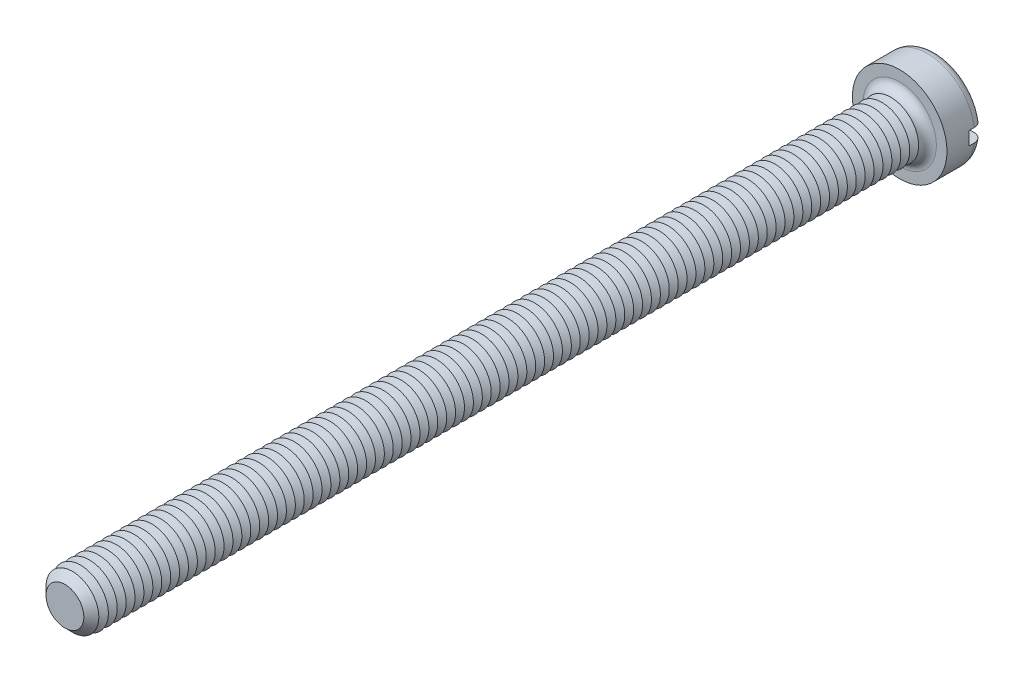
ISO-10303-21;
HEADER;
FILE_DESCRIPTION(('STEP AP214'),'2;1');
FILE_NAME('part.step','',(''),(''),'','','');
FILE_SCHEMA(('AUTOMOTIVE_DESIGN { 1 0 10303 214 1 1 1 1 }'));
ENDSEC;
DATA;
#1=APPLICATION_CONTEXT('core data for automotive mechanical design processes');
#2=APPLICATION_PROTOCOL_DEFINITION('international standard','automotive_design',2000,#1);
#3=PRODUCT_CONTEXT('',#1,'mechanical');
#4=PRODUCT('Part','Part','',(#3));
#5=PRODUCT_RELATED_PRODUCT_CATEGORY('part','',(#4));
#6=PRODUCT_DEFINITION_FORMATION('','',#4);
#7=PRODUCT_DEFINITION_CONTEXT('part definition',#1,'design');
#8=PRODUCT_DEFINITION('design','',#6,#7);
#9=PRODUCT_DEFINITION_SHAPE('','',#8);
#10=(LENGTH_UNIT() NAMED_UNIT(*) SI_UNIT(.MILLI.,.METRE.));
#11=(NAMED_UNIT(*) PLANE_ANGLE_UNIT() SI_UNIT($,.RADIAN.));
#12=(NAMED_UNIT(*) SI_UNIT($,.STERADIAN.) SOLID_ANGLE_UNIT());
#13=UNCERTAINTY_MEASURE_WITH_UNIT(LENGTH_MEASURE(1.E-05),#10,'distance_accuracy_value','');
#14=(GEOMETRIC_REPRESENTATION_CONTEXT(3) GLOBAL_UNCERTAINTY_ASSIGNED_CONTEXT((#13)) GLOBAL_UNIT_ASSIGNED_CONTEXT((#10,
#11,#12)) REPRESENTATION_CONTEXT('',''));
#15=CARTESIAN_POINT('',(0.,0.,0.));
#16=DIRECTION('',(0.,0.,1.));
#17=DIRECTION('',(1.,0.,0.));
#18=AXIS2_PLACEMENT_3D('',#15,#16,#17);
#19=CARTESIAN_POINT('',(0.,0.,-3.3));
#20=DIRECTION('',(0.,0.,1.));
#21=DIRECTION('',(1.,0.,0.));
#22=AXIS2_PLACEMENT_3D('',#19,#20,#21);
#23=PLANE('',#22);
#24=CARTESIAN_POINT('',(0.,0.,-3.3));
#25=DIRECTION('',(0.,0.,1.));
#26=DIRECTION('',(1.,0.,0.));
#27=AXIS2_PLACEMENT_3D('',#24,#25,#26);
#28=CIRCLE('',#27,3.45);
#29=CARTESIAN_POINT('',(-3.39742549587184,0.6,-3.3));
#30=VERTEX_POINT('',#29);
#31=CARTESIAN_POINT('',(3.39742549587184,0.6,-3.3));
#32=VERTEX_POINT('',#31);
#33=EDGE_CURVE('E116',#30,#32,#28,.F.);
#34=ORIENTED_EDGE('',*,*,#33,.T.);
#35=DIRECTION('',(1.,0.,0.));
#36=VECTOR('',#35,1.);
#37=CARTESIAN_POINT('',(-4.25,0.600000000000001,-3.3));
#38=LINE('',#37,#36);
#39=EDGE_CURVE('E111',#30,#32,#38,.T.);
#40=ORIENTED_EDGE('',*,*,#39,.F.);
#41=EDGE_LOOP('',(#34,#40));
#42=FACE_BOUND('',#41,.T.);
#43=ADVANCED_FACE('F39',(#42),#23,.F.);
#44=CARTESIAN_POINT('',(0.,0.,-2.5));
#45=DIRECTION('',(0.,0.,1.));
#46=DIRECTION('',(1.,0.,0.));
#47=AXIS2_PLACEMENT_3D('',#44,#45,#46);
#48=TOROIDAL_SURFACE('',#47,3.45,0.8);
#49=CARTESIAN_POINT('',(-4.06369072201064,0.600000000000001,-2.95537828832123));
#50=CARTESIAN_POINT('',(-4.03774340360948,0.600000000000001,-2.99245078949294));
#51=CARTESIAN_POINT('',(-4.00861849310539,0.600000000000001,-3.02734231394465));
#52=CARTESIAN_POINT('',(-3.94488199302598,0.600000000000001,-3.0917502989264));
#53=CARTESIAN_POINT('',(-3.91026320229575,0.600000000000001,-3.12125959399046));
#54=CARTESIAN_POINT('',(-3.83660561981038,0.600000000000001,-3.17403695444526));
#55=CARTESIAN_POINT('',(-3.79757117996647,0.6,-3.19731109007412));
#56=CARTESIAN_POINT('',(-3.71618817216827,0.6,-3.23703443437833));
#57=CARTESIAN_POINT('',(-3.67384041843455,0.6,-3.25348531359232));
#58=CARTESIAN_POINT('',(-3.58661930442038,0.6,-3.2792758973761));
#59=CARTESIAN_POINT('',(-3.54172669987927,0.6,-3.288550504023));
#60=CARTESIAN_POINT('',(-3.45102322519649,0.6,-3.29952632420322));
#61=CARTESIAN_POINT('',(-3.40521225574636,0.6,-3.30122671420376));
#62=CARTESIAN_POINT('',(-3.31340831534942,0.6,-3.29701196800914));
#63=CARTESIAN_POINT('',(-3.26741940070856,0.6,-3.29100823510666));
#64=CARTESIAN_POINT('',(-3.17708556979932,0.6,-3.27141469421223));
#65=CARTESIAN_POINT('',(-3.13274074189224,0.6,-3.25782447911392));
#66=CARTESIAN_POINT('',(-3.0466814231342,0.6,-3.22332549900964));
#67=CARTESIAN_POINT('',(-3.00498444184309,0.6,-3.20237301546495));
#68=CARTESIAN_POINT('',(-2.92572251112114,0.6,-3.15372961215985));
#69=CARTESIAN_POINT('',(-2.88815755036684,0.6,-3.12603871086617));
#70=CARTESIAN_POINT('',(-2.81847654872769,0.6,-3.06483322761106));
#71=CARTESIAN_POINT('',(-2.78633186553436,0.6,-3.03135128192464));
#72=CARTESIAN_POINT('',(-2.72824805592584,0.6,-2.95937651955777));
#73=CARTESIAN_POINT('',(-2.70230829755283,0.6,-2.92088421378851));
#74=CARTESIAN_POINT('',(-2.65791262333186,0.6,-2.84074227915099));
#75=CARTESIAN_POINT('',(-2.63932560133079,0.6,-2.79916531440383));
#76=CARTESIAN_POINT('',(-2.60958432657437,0.6,-2.7134333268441));
#77=CARTESIAN_POINT('',(-2.59842889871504,0.6,-2.66927871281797));
#78=CARTESIAN_POINT('',(-2.58411140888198,0.6,-2.58073966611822));
#79=CARTESIAN_POINT('',(-2.58077086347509,0.6,-2.5363840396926));
#80=CARTESIAN_POINT('',(-2.58167367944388,0.6,-2.44775208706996));
#81=CARTESIAN_POINT('',(-2.58591644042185,0.6,-2.40347575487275));
#82=CARTESIAN_POINT('',(-2.60175154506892,0.6,-2.31675105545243));
#83=CARTESIAN_POINT('',(-2.61326489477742,0.6,-2.27428821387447));
#84=CARTESIAN_POINT('',(-2.6431863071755,0.6,-2.19186794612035));
#85=CARTESIAN_POINT('',(-2.66159465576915,0.6,-2.15191062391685));
#86=CARTESIAN_POINT('',(-2.70494650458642,0.6,-2.07517696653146));
#87=CARTESIAN_POINT('',(-2.72995486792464,0.6,-2.03843731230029));
#88=CARTESIAN_POINT('',(-2.7856570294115,0.6,-1.96955746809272));
#89=CARTESIAN_POINT('',(-2.81635145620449,0.6,-1.93741778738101));
#90=CARTESIAN_POINT('',(-2.88329572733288,0.6,-1.87788048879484));
#91=CARTESIAN_POINT('',(-2.91965530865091,0.6,-1.85060625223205));
#92=CARTESIAN_POINT('',(-2.9963658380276,0.6,-1.80241044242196));
#93=CARTESIAN_POINT('',(-3.03671721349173,0.6,-1.78148955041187));
#94=CARTESIAN_POINT('',(-3.12111125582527,0.6,-1.74619829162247));
#95=CARTESIAN_POINT('',(-3.16521020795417,0.6,-1.73196239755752));
#96=CARTESIAN_POINT('',(-3.25516487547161,0.6,-1.71103773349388));
#97=CARTESIAN_POINT('',(-3.30102068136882,0.6,-1.70434935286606));
#98=CARTESIAN_POINT('',(-3.39352689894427,0.6,-1.69870104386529));
#99=CARTESIAN_POINT('',(-3.44018061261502,0.6,-1.69979487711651));
#100=CARTESIAN_POINT('',(-3.53263583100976,0.6,-1.70983959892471));
#101=CARTESIAN_POINT('',(-3.57843734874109,0.6,-1.71879036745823));
#102=CARTESIAN_POINT('',(-3.66763544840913,0.6,-1.74426972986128));
#103=CARTESIAN_POINT('',(-3.71104292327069,0.6,-1.76076015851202));
#104=CARTESIAN_POINT('',(-3.79442616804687,0.6,-1.80087686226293));
#105=CARTESIAN_POINT('',(-3.83440212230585,0.600000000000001,-1.82450275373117));
#106=CARTESIAN_POINT('',(-3.90929765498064,0.600000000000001,-1.87793548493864));
#107=CARTESIAN_POINT('',(-3.94426963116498,0.600000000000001,-1.90766887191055));
#108=CARTESIAN_POINT('',(-4.00864839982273,0.600000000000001,-1.9726503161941));
#109=CARTESIAN_POINT('',(-4.03805555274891,0.600000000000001,-2.00789801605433));
#110=CARTESIAN_POINT('',(-4.09009460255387,0.600000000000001,-2.08244463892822));
#111=CARTESIAN_POINT('',(-4.11280448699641,0.600000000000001,-2.12168912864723));
#112=CARTESIAN_POINT('',(-4.15124086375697,0.600000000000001,-2.2034588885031));
#113=CARTESIAN_POINT('',(-4.16696802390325,0.600000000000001,-2.24598384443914));
#114=CARTESIAN_POINT('',(-4.19085131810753,0.600000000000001,-2.33267862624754));
#115=CARTESIAN_POINT('',(-4.19907708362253,0.600000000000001,-2.37682928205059));
#116=CARTESIAN_POINT('',(-4.2079638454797,0.600000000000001,-2.46589754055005));
#117=CARTESIAN_POINT('',(-4.20862315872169,0.600000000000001,-2.51081531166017));
#118=CARTESIAN_POINT('',(-4.20236829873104,0.600000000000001,-2.59993343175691));
#119=CARTESIAN_POINT('',(-4.19548454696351,0.600000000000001,-2.64413593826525));
#120=CARTESIAN_POINT('',(-4.17439924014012,0.600000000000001,-2.73071930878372));
#121=CARTESIAN_POINT('',(-4.16020675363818,0.600000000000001,-2.77310235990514));
#122=CARTESIAN_POINT('',(-4.1318825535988,0.600000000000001,-2.83880495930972));
#123=CARTESIAN_POINT('',(-4.11991183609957,0.600000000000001,-2.86307959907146));
#124=CARTESIAN_POINT('',(-4.09356927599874,0.600000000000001,-2.91028856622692));
#125=CARTESIAN_POINT('',(-4.07919744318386,0.600000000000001,-2.9332228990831));
#126=CARTESIAN_POINT('',(-4.06369072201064,0.600000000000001,-2.95537828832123));
#127=B_SPLINE_CURVE_WITH_KNOTS('',3,(#49,#50,#51,#52,#53,#54,#55,#56,#57,#58,#59,#60,#61,#62,
#63,#64,#65,#66,#67,#68,#69,#70,#71,#72,#73,#74,#75,#76,#77,#78,#79,#80,#81,#82,#83,#84,#85,#86,
#87,#88,#89,#90,#91,#92,#93,#94,#95,#96,#97,#98,#99,#100,#101,#102,#103,#104,#105,#106,#107,
#108,#109,#110,#111,#112,#113,#114,#115,#116,#117,#118,#119,#120,#121,#122,#123,#124,#125,#126),
.UNSPECIFIED.,.T.,.F.,(4,2,2,2,2,2,2,2,2,2,2,2,2,2,2,2,2,2,2,2,2,2,2,2,2,2,2,2,2,2,2,2,2,2,2,2,
2,2,4),(0.,0.13565225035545,0.271483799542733,0.407182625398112,0.542848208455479,
0.679730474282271,0.816627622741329,0.955113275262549,1.09360635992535,1.23293614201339,
1.37226554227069,1.51083389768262,1.64938813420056,1.78534653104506,1.92128342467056,
2.0540840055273,2.18687407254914,2.31824564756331,2.44962267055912,2.58234229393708,
2.71507659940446,2.85080630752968,2.98655056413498,3.12491938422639,3.26329534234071,
3.40262816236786,3.54195885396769,3.68059194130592,3.81921757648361,3.95626453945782,
4.09330262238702,4.2286754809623,4.36403538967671,4.49812564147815,4.63224572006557,
4.76582687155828,4.89924267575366,4.98031194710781,5.0613808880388),.UNSPECIFIED.);
#128=CARTESIAN_POINT('',(-4.20743389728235,0.600000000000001,-2.50000000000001));
#129=VERTEX_POINT('',#128);
#130=EDGE_CURVE('E921',#129,#30,#127,.T.);
#131=ORIENTED_EDGE('',*,*,#130,.F.);
#132=CARTESIAN_POINT('',(0.,0.,-2.5));
#133=DIRECTION('',(0.,0.,1.));
#134=DIRECTION('',(1.,0.,0.));
#135=AXIS2_PLACEMENT_3D('',#132,#133,#134);
#136=CIRCLE('',#135,4.25);
#137=CARTESIAN_POINT('',(4.20743389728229,0.599999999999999,-2.5));
#138=VERTEX_POINT('',#137);
#139=EDGE_CURVE('E125',#138,#129,#136,.T.);
#140=ORIENTED_EDGE('',*,*,#139,.F.);
#141=CARTESIAN_POINT('',(2.63947327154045,0.6,-2.79608831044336));
#142=CARTESIAN_POINT('',(2.65655980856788,0.6,-2.83790320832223));
#143=CARTESIAN_POINT('',(2.67725642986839,0.6,-2.87828303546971));
#144=CARTESIAN_POINT('',(2.72519250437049,0.6,-2.95500233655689));
#145=CARTESIAN_POINT('',(2.75244152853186,0.6,-2.9913357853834));
#146=CARTESIAN_POINT('',(2.81257938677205,0.6,-3.05889430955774));
#147=CARTESIAN_POINT('',(2.84545995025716,0.6,-3.09012674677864));
#148=CARTESIAN_POINT('',(2.91591143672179,0.6,-3.14672620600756));
#149=CARTESIAN_POINT('',(2.95348119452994,0.6,-3.17209468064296));
#150=CARTESIAN_POINT('',(3.03291143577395,0.6,-3.21669611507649));
#151=CARTESIAN_POINT('',(3.07483186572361,0.6,-3.23582234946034));
#152=CARTESIAN_POINT('',(3.16126659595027,0.6,-3.26686062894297));
#153=CARTESIAN_POINT('',(3.2057811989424,0.6,-3.27877183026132));
#154=CARTESIAN_POINT('',(3.29669878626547,0.6,-3.29514603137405));
#155=CARTESIAN_POINT('',(3.34311773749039,0.6,-3.29952056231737));
#156=CARTESIAN_POINT('',(3.43603189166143,0.6,-3.30040472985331));
#157=CARTESIAN_POINT('',(3.48252709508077,0.6,-3.29691431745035));
#158=CARTESIAN_POINT('',(3.57420049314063,0.6,-3.28214240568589));
#159=CARTESIAN_POINT('',(3.61938038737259,0.6,-3.27087147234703));
#160=CARTESIAN_POINT('',(3.70717477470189,0.6,-3.24082890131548));
#161=CARTESIAN_POINT('',(3.74978938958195,0.6,-3.22205762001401));
#162=CARTESIAN_POINT('',(3.83078828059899,0.6,-3.17773607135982));
#163=CARTESIAN_POINT('',(3.86921015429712,0.599999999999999,-3.15225453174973));
#164=CARTESIAN_POINT('',(3.94116038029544,0.599999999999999,-3.09512672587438));
#165=CARTESIAN_POINT('',(3.9746890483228,0.599999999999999,-3.06348085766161));
#166=CARTESIAN_POINT('',(4.03545911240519,0.599999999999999,-2.99534640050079));
#167=CARTESIAN_POINT('',(4.06277344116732,0.599999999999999,-2.95892285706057));
#168=CARTESIAN_POINT('',(4.11082191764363,0.599999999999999,-2.88196698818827));
#169=CARTESIAN_POINT('',(4.13155647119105,0.599999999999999,-2.84143491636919));
#170=CARTESIAN_POINT('',(4.16563480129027,0.599999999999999,-2.75787550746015));
#171=CARTESIAN_POINT('',(4.1790544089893,0.599999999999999,-2.71487908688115));
#172=CARTESIAN_POINT('',(4.19843340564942,0.599999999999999,-2.62723691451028));
#173=CARTESIAN_POINT('',(4.20439310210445,0.599999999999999,-2.58259123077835));
#174=CARTESIAN_POINT('',(4.2086595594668,0.599999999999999,-2.49321831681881));
#175=CARTESIAN_POINT('',(4.20701422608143,0.599999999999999,-2.4484933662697));
#176=CARTESIAN_POINT('',(4.1962295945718,0.599999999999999,-2.35995704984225));
#177=CARTESIAN_POINT('',(4.18709040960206,0.599999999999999,-2.31614567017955));
#178=CARTESIAN_POINT('',(4.16160290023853,0.599999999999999,-2.23072100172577));
#179=CARTESIAN_POINT('',(4.14526169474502,0.599999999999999,-2.18910558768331));
#180=CARTESIAN_POINT('',(4.10585410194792,0.599999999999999,-2.10919238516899));
#181=CARTESIAN_POINT('',(4.08278762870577,0.599999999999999,-2.07089463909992));
#182=CARTESIAN_POINT('',(4.030487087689,0.599999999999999,-1.99851484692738));
#183=CARTESIAN_POINT('',(4.00122628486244,0.599999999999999,-1.9644521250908));
#184=CARTESIAN_POINT('',(3.93744772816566,0.599999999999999,-1.90166877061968));
#185=CARTESIAN_POINT('',(3.90292977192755,0.599999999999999,-1.87294834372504));
#186=CARTESIAN_POINT('',(3.82928727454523,0.599999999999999,-1.82137853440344));
#187=CARTESIAN_POINT('',(3.79012374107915,0.6,-1.79858484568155));
#188=CARTESIAN_POINT('',(3.70856025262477,0.6,-1.75980712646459));
#189=CARTESIAN_POINT('',(3.66616010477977,0.6,-1.74382350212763));
#190=CARTESIAN_POINT('',(3.57878495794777,0.6,-1.71891499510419));
#191=CARTESIAN_POINT('',(3.53378519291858,0.6,-1.71007699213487));
#192=CARTESIAN_POINT('',(3.44294322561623,0.6,-1.69998722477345));
#193=CARTESIAN_POINT('',(3.3971009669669,0.6,-1.69873596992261));
#194=CARTESIAN_POINT('',(3.30531297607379,0.6,-1.70385439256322));
#195=CARTESIAN_POINT('',(3.25937213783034,0.6,-1.71031204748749));
#196=CARTESIAN_POINT('',(3.1692099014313,0.6,-1.73080107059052));
#197=CARTESIAN_POINT('',(3.12498860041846,0.6,-1.74483286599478));
#198=CARTESIAN_POINT('',(3.03926209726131,0.6,-1.78018941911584));
#199=CARTESIAN_POINT('',(2.99777407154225,0.6,-1.80155586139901));
#200=CARTESIAN_POINT('',(2.91899881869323,0.6,-1.85098881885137));
#201=CARTESIAN_POINT('',(2.88171158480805,0.6,-1.8790553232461));
#202=CARTESIAN_POINT('',(2.81266124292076,0.6,-1.94094884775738));
#203=CARTESIAN_POINT('',(2.78086710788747,0.6,-1.97474122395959));
#204=CARTESIAN_POINT('',(2.72353615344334,0.6,-2.0472724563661));
#205=CARTESIAN_POINT('',(2.69799841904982,0.6,-2.08601058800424));
#206=CARTESIAN_POINT('',(2.65444718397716,0.6,-2.16655019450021));
#207=CARTESIAN_POINT('',(2.63629889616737,0.6,-2.20827875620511));
#208=CARTESIAN_POINT('',(2.60744942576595,0.6,-2.29424821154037));
#209=CARTESIAN_POINT('',(2.59674901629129,0.6,-2.33848936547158));
#210=CARTESIAN_POINT('',(2.5833312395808,0.6,-2.42714258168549));
#211=CARTESIAN_POINT('',(2.58043995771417,0.6,-2.47152848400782));
#212=CARTESIAN_POINT('',(2.58224493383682,0.6,-2.56010574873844));
#213=CARTESIAN_POINT('',(2.58693104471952,0.6,-2.60429729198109));
#214=CARTESIAN_POINT('',(2.60020046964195,0.6,-2.67311978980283));
#215=CARTESIAN_POINT('',(2.60635343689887,0.6,-2.69824441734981));
#216=CARTESIAN_POINT('',(2.62110140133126,0.6,-2.74776540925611));
#217=CARTESIAN_POINT('',(2.62969634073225,0.6,-2.77216179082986));
#218=CARTESIAN_POINT('',(2.63947327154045,0.6,-2.79608831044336));
#219=B_SPLINE_CURVE_WITH_KNOTS('',3,(#141,#142,#143,#144,#145,#146,#147,#148,#149,#150,#151,
#152,#153,#154,#155,#156,#157,#158,#159,#160,#161,#162,#163,#164,#165,#166,#167,#168,#169,#170,
#171,#172,#173,#174,#175,#176,#177,#178,#179,#180,#181,#182,#183,#184,#185,#186,#187,#188,#189,
#190,#191,#192,#193,#194,#195,#196,#197,#198,#199,#200,#201,#202,#203,#204,#205,#206,#207,#208,
#209,#210,#211,#212,#213,#214,#215,#216,#217,#218),.UNSPECIFIED.,.T.,.F.,(4,2,2,2,2,2,2,2,2,2,2,
2,2,2,2,2,2,2,2,2,2,2,2,2,2,2,2,2,2,2,2,2,2,2,2,2,2,2,4),(0.,0.135416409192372,
0.271031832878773,0.406449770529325,0.541834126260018,0.679424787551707,0.817031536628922,
0.956242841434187,1.09545501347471,1.23447850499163,1.37349539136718,1.51114036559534,
1.64877645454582,1.78470267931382,1.92062051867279,2.05510117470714,2.1895762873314,
2.32320547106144,2.45683263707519,2.59032801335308,2.72382509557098,2.85791055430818,
2.99200117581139,3.12730969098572,3.26262627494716,3.39956435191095,3.53651162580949,
3.67503685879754,3.81356990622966,3.95290367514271,4.09223721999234,4.23075602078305,
4.36925455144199,4.50509949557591,4.6409585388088,4.77376594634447,4.90639565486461,
4.98388287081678,5.06136825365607),.UNSPECIFIED.);
#220=EDGE_CURVE('E923',#32,#138,#219,.T.);
#221=ORIENTED_EDGE('',*,*,#220,.F.);
#222=ORIENTED_EDGE('',*,*,#33,.F.);
#223=EDGE_LOOP('',(#131,#140,#221,#222));
#224=FACE_BOUND('',#223,.T.);
#225=ADVANCED_FACE('F905',(#224),#48,.T.);
#226=CARTESIAN_POINT('',(0.,0.,-3.3));
#227=DIRECTION('',(0.,0.,1.));
#228=DIRECTION('',(1.,0.,0.));
#229=AXIS2_PLACEMENT_3D('',#226,#227,#228);
#230=CYLINDRICAL_SURFACE('',#229,4.25);
#231=DIRECTION('',(0.,0.,1.));
#232=VECTOR('',#231,1.);
#233=CARTESIAN_POINT('',(4.20743389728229,0.599999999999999,-3.3));
#234=LINE('',#233,#232);
#235=CARTESIAN_POINT('',(4.20743389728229,0.599999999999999,-2.));
#236=VERTEX_POINT('',#235);
#237=EDGE_CURVE('E939',#138,#236,#234,.T.);
#238=ORIENTED_EDGE('',*,*,#237,.F.);
#239=ORIENTED_EDGE('',*,*,#139,.T.);
#240=DIRECTION('',(0.,0.,1.));
#241=VECTOR('',#240,1.);
#242=CARTESIAN_POINT('',(-4.20743389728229,0.600000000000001,-3.3));
#243=LINE('',#242,#241);
#244=CARTESIAN_POINT('',(-4.20743389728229,0.600000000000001,-2.));
#245=VERTEX_POINT('',#244);
#246=EDGE_CURVE('E63',#245,#129,#243,.F.);
#247=ORIENTED_EDGE('',*,*,#246,.F.);
#248=CARTESIAN_POINT('',(0.,0.,-2.));
#249=DIRECTION('',(0.,0.,-1.));
#250=DIRECTION('',(-1.,0.,0.));
#251=AXIS2_PLACEMENT_3D('',#248,#249,#250);
#252=CIRCLE('',#251,4.25);
#253=CARTESIAN_POINT('',(-4.20743389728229,-0.599999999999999,-2.));
#254=VERTEX_POINT('',#253);
#255=EDGE_CURVE('E43',#245,#254,#252,.F.);
#256=ORIENTED_EDGE('',*,*,#255,.T.);
#257=DIRECTION('',(0.,0.,1.));
#258=VECTOR('',#257,1.);
#259=CARTESIAN_POINT('',(-4.20743389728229,-0.599999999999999,-3.3));
#260=LINE('',#259,#258);
#261=CARTESIAN_POINT('',(-4.20743389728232,-0.599999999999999,-2.5));
#262=VERTEX_POINT('',#261);
#263=EDGE_CURVE('E936',#262,#254,#260,.T.);
#264=ORIENTED_EDGE('',*,*,#263,.F.);
#265=CARTESIAN_POINT('',(4.20743389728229,-0.600000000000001,-2.5));
#266=VERTEX_POINT('',#265);
#267=EDGE_CURVE('E127',#262,#266,#136,.T.);
#268=ORIENTED_EDGE('',*,*,#267,.T.);
#269=DIRECTION('',(0.,0.,1.));
#270=VECTOR('',#269,1.);
#271=CARTESIAN_POINT('',(4.20743389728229,-0.600000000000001,-3.3));
#272=LINE('',#271,#270);
#273=CARTESIAN_POINT('',(4.20743389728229,-0.600000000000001,-2.));
#274=VERTEX_POINT('',#273);
#275=EDGE_CURVE('E55',#274,#266,#272,.F.);
#276=ORIENTED_EDGE('',*,*,#275,.F.);
#277=EDGE_CURVE('E11',#274,#236,#252,.F.);
#278=ORIENTED_EDGE('',*,*,#277,.T.);
#279=EDGE_LOOP('',(#238,#239,#247,#256,#264,#268,#276,#278));
#280=FACE_BOUND('',#279,.T.);
#281=CARTESIAN_POINT('',(0.,0.,0.));
#282=DIRECTION('',(0.,0.,1.));
#283=DIRECTION('',(1.,0.,0.));
#284=AXIS2_PLACEMENT_3D('',#281,#282,#283);
#285=CIRCLE('',#284,4.25);
#286=CARTESIAN_POINT('',(4.25,0.,0.));
#287=VERTEX_POINT('',#286);
#288=EDGE_CURVE('E942',#287,#287,#285,.T.);
#289=ORIENTED_EDGE('',*,*,#288,.F.);
#290=EDGE_LOOP('',(#289));
#291=FACE_BOUND('',#290,.T.);
#292=ADVANCED_FACE('F901',(#280,#291),#230,.T.);
#293=CARTESIAN_POINT('',(3.39742549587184,-0.6,-3.3));
#294=VERTEX_POINT('',#293);
#295=CARTESIAN_POINT('',(-3.39742549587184,-0.6,-3.3));
#296=VERTEX_POINT('',#295);
#297=EDGE_CURVE('E109',#294,#296,#28,.F.);
#298=ORIENTED_EDGE('',*,*,#297,.T.);
#299=DIRECTION('',(-1.,0.,0.));
#300=VECTOR('',#299,1.);
#301=CARTESIAN_POINT('',(-4.25,-0.599999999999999,-3.3));
#302=LINE('',#301,#300);
#303=EDGE_CURVE('E96',#294,#296,#302,.T.);
#304=ORIENTED_EDGE('',*,*,#303,.F.);
#305=EDGE_LOOP('',(#298,#304));
#306=FACE_BOUND('',#305,.T.);
#307=ADVANCED_FACE('F108',(#306),#23,.F.);
#308=CARTESIAN_POINT('',(0.,0.,0.));
#309=DIRECTION('',(0.,0.,1.));
#310=DIRECTION('',(1.,0.,0.));
#311=AXIS2_PLACEMENT_3D('',#308,#309,#310);
#312=PLANE('',#311);
#313=CARTESIAN_POINT('',(0.,0.,0.));
#314=DIRECTION('',(0.,0.,1.));
#315=DIRECTION('',(1.,0.,0.));
#316=AXIS2_PLACEMENT_3D('',#313,#314,#315);
#317=CIRCLE('',#316,3.3);
#318=CARTESIAN_POINT('',(3.3,0.,0.));
#319=VERTEX_POINT('',#318);
#320=EDGE_CURVE('E115',#319,#319,#317,.F.);
#321=ORIENTED_EDGE('',*,*,#320,.T.);
#322=EDGE_LOOP('',(#321));
#323=FACE_BOUND('',#322,.T.);
#324=ORIENTED_EDGE('',*,*,#288,.T.);
#325=EDGE_LOOP('',(#324));
#326=FACE_BOUND('',#325,.T.);
#327=ADVANCED_FACE('F900',(#323,#326),#312,.T.);
#328=CARTESIAN_POINT('',(-4.06369072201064,-0.599999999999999,-2.95537828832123));
#329=CARTESIAN_POINT('',(-4.08928577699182,-0.599999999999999,-2.91880204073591));
#330=CARTESIAN_POINT('',(-4.11182555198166,-0.599999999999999,-2.88005030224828));
#331=CARTESIAN_POINT('',(-4.15010404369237,-0.599999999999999,-2.79928452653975));
#332=CARTESIAN_POINT('',(-4.16583526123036,-0.599999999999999,-2.75726695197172));
#333=CARTESIAN_POINT('',(-4.19000286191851,-0.599999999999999,-2.67118996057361));
#334=CARTESIAN_POINT('',(-4.19844101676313,-0.599999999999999,-2.62713104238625));
#335=CARTESIAN_POINT('',(-4.20777174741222,-0.599999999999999,-2.53823222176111));
#336=CARTESIAN_POINT('',(-4.20866608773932,-0.599999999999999,-2.49339250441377));
#337=CARTESIAN_POINT('',(-4.20289683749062,-0.599999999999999,-2.40433856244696));
#338=CARTESIAN_POINT('',(-4.19625607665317,-0.599999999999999,-2.36012285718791));
#339=CARTESIAN_POINT('',(-4.17565084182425,-0.599999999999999,-2.27343166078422));
#340=CARTESIAN_POINT('',(-4.16168615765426,-0.599999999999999,-2.23095621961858));
#341=CARTESIAN_POINT('',(-4.12683188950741,-0.599999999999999,-2.14890863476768));
#342=CARTESIAN_POINT('',(-4.10593663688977,-0.599999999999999,-2.10933890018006));
#343=CARTESIAN_POINT('',(-4.05783763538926,-0.599999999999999,-2.03424145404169));
#344=CARTESIAN_POINT('',(-4.03063375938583,-0.599999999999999,-1.99871382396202));
#345=CARTESIAN_POINT('',(-3.97052236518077,-0.599999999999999,-1.93246905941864));
#346=CARTESIAN_POINT('',(-3.93758114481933,-0.599999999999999,-1.90178251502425));
#347=CARTESIAN_POINT('',(-3.86706007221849,-0.599999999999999,-1.84630837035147));
#348=CARTESIAN_POINT('',(-3.82948001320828,-0.6,-1.82152103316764));
#349=CARTESIAN_POINT('',(-3.75033766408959,-0.6,-1.77826995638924));
#350=CARTESIAN_POINT('',(-3.70873831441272,-0.6,-1.7598740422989));
#351=CARTESIAN_POINT('',(-3.62306661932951,-0.6,-1.73023196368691));
#352=CARTESIAN_POINT('',(-3.57899411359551,-0.6,-1.71898626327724));
#353=CARTESIAN_POINT('',(-3.48904845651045,-0.6,-1.70382025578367));
#354=CARTESIAN_POINT('',(-3.44315982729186,-0.6,-1.69999172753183));
#355=CARTESIAN_POINT('',(-3.35138360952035,-0.6,-1.7000083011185));
#356=CARTESIAN_POINT('',(-3.30549602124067,-0.6,-1.70385391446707));
#357=CARTESIAN_POINT('',(-3.21452492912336,-0.6,-1.71917227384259));
#358=CARTESIAN_POINT('',(-3.16945455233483,-0.6,-1.73072307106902));
#359=CARTESIAN_POINT('',(-3.08188104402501,-0.6,-1.76120640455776));
#360=CARTESIAN_POINT('',(-3.0393780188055,-0.6,-1.78013924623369));
#361=CARTESIAN_POINT('',(-2.95805296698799,-0.6,-1.82493384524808));
#362=CARTESIAN_POINT('',(-2.9192403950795,-0.6,-1.85081278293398));
#363=CARTESIAN_POINT('',(-2.84656695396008,-0.6,-1.90878317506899));
#364=CARTESIAN_POINT('',(-2.81270591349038,-0.6,-1.94087441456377));
#365=CARTESIAN_POINT('',(-2.75131050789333,-0.6,-2.01002500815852));
#366=CARTESIAN_POINT('',(-2.72371339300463,-0.6,-2.04702860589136));
#367=CARTESIAN_POINT('',(-2.67528742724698,-0.6,-2.12522869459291));
#368=CARTESIAN_POINT('',(-2.65445765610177,-0.6,-2.1664246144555));
#369=CARTESIAN_POINT('',(-2.62065354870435,-0.6,-2.25087266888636));
#370=CARTESIAN_POINT('',(-2.60751663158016,-0.6,-2.29405971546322));
#371=CARTESIAN_POINT('',(-2.58885106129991,-0.6,-2.38204659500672));
#372=CARTESIAN_POINT('',(-2.58332131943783,-0.6,-2.42684619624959));
#373=CARTESIAN_POINT('',(-2.58009777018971,-0.6,-2.51580379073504));
#374=CARTESIAN_POINT('',(-2.58224575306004,-0.6,-2.55995612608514));
#375=CARTESIAN_POINT('',(-2.59395205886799,-0.6,-2.64726495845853));
#376=CARTESIAN_POINT('',(-2.60351013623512,-0.6,-2.69042148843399));
#377=CARTESIAN_POINT('',(-2.62967159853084,-0.6,-2.77438771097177));
#378=CARTESIAN_POINT('',(-2.64625243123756,-0.6,-2.81520444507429));
#379=CARTESIAN_POINT('',(-2.68592348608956,-0.6,-2.89353901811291));
#380=CARTESIAN_POINT('',(-2.70901418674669,-0.6,-2.9310566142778));
#381=CARTESIAN_POINT('',(-2.7614318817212,-0.6,-3.00240040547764));
#382=CARTESIAN_POINT('',(-2.79085487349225,-0.6,-3.03615603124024));
#383=CARTESIAN_POINT('',(-2.85483456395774,-0.6,-3.09838834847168));
#384=CARTESIAN_POINT('',(-2.88939187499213,-0.6,-3.12686440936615));
#385=CARTESIAN_POINT('',(-2.96351967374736,-0.6,-3.17841283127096));
#386=CARTESIAN_POINT('',(-3.00318741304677,-0.6,-3.20134539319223));
#387=CARTESIAN_POINT('',(-3.08576649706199,-0.6,-3.24034364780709));
#388=CARTESIAN_POINT('',(-3.12867814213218,-0.6,-3.25640870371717));
#389=CARTESIAN_POINT('',(-3.21724048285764,-0.6,-3.28143816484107));
#390=CARTESIAN_POINT('',(-3.26292314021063,-0.6,-3.29028963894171));
#391=CARTESIAN_POINT('',(-3.35512527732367,-0.6,-3.30021681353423));
#392=CARTESIAN_POINT('',(-3.40164474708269,-0.6,-3.30129260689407));
#393=CARTESIAN_POINT('',(-3.49429978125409,-0.6,-3.29560589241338));
#394=CARTESIAN_POINT('',(-3.54043436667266,-0.6,-3.28882735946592));
#395=CARTESIAN_POINT('',(-3.63090382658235,-0.6,-3.26755492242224));
#396=CARTESIAN_POINT('',(-3.67523831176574,-0.6,-3.25305935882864));
#397=CARTESIAN_POINT('',(-3.76046509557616,-0.6,-3.21686867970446));
#398=CARTESIAN_POINT('',(-3.80138087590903,-0.599999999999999,-3.1952288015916));
#399=CARTESIAN_POINT('',(-3.8788986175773,-0.599999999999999,-3.14531817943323));
#400=CARTESIAN_POINT('',(-3.91550599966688,-0.599999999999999,-3.11705590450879));
#401=CARTESIAN_POINT('',(-3.97074313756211,-0.599999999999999,-3.06628809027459));
#402=CARTESIAN_POINT('',(-3.99100743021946,-0.599999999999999,-3.04553102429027));
#403=CARTESIAN_POINT('',(-4.02917385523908,-0.599999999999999,-3.00194762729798));
#404=CARTESIAN_POINT('',(-4.04707600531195,-0.599999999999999,-2.97912131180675));
#405=CARTESIAN_POINT('',(-4.06369072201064,-0.599999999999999,-2.95537828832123));
#406=B_SPLINE_CURVE_WITH_KNOTS('',3,(#328,#329,#330,#331,#332,#333,#334,#335,#336,#337,#338,
#339,#340,#341,#342,#343,#344,#345,#346,#347,#348,#349,#350,#351,#352,#353,#354,#355,#356,#357,
#358,#359,#360,#361,#362,#363,#364,#365,#366,#367,#368,#369,#370,#371,#372,#373,#374,#375,#376,
#377,#378,#379,#380,#381,#382,#383,#384,#385,#386,#387,#388,#389,#390,#391,#392,#393,#394,#395,
#396,#397,#398,#399,#400,#401,#402,#403,#404,#405),.UNSPECIFIED.,.T.,.F.,(4,2,2,2,2,2,2,2,2,2,2,
2,2,2,2,2,2,2,2,2,2,2,2,2,2,2,2,2,2,2,2,2,2,2,2,2,2,2,4),(0.,0.133821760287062,
0.267790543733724,0.401726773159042,0.535631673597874,0.669131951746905,0.802636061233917,
0.936249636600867,1.06986590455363,1.2042952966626,1.3387306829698,1.47455198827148,
1.61038210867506,1.74788249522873,1.88539204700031,2.02431612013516,2.16324594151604,
2.30252260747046,2.4417944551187,2.57960263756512,2.71739207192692,2.85215325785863,
2.98689515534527,3.11887666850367,3.25085380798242,3.38241030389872,3.51397647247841,
3.64769871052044,3.78143690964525,3.91826005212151,4.05509587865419,4.19403485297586,
4.33297216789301,4.47219345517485,4.61144469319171,4.74964356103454,4.887666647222,
4.97453605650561,5.06140481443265),.UNSPECIFIED.);
#407=EDGE_CURVE('E103',#296,#262,#406,.T.);
#408=ORIENTED_EDGE('',*,*,#407,.F.);
#409=ORIENTED_EDGE('',*,*,#297,.F.);
#410=CARTESIAN_POINT('',(2.63947327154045,-0.6,-2.79608831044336));
#411=CARTESIAN_POINT('',(2.62285766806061,-0.6,-2.75541510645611));
#412=CARTESIAN_POINT('',(2.60963282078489,-0.6,-2.71332585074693));
#413=CARTESIAN_POINT('',(2.59042394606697,-0.6,-2.62749460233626));
#414=CARTESIAN_POINT('',(2.58444686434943,-0.6,-2.58375106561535));
#415=CARTESIAN_POINT('',(2.57995287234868,-0.6,-2.49588524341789));
#416=CARTESIAN_POINT('',(2.58143477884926,-0.6,-2.45176301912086));
#417=CARTESIAN_POINT('',(2.59180622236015,-0.6,-2.36440906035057));
#418=CARTESIAN_POINT('',(2.60069434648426,-0.6,-2.32117715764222));
#419=CARTESIAN_POINT('',(2.62554964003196,-0.6,-2.23689909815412));
#420=CARTESIAN_POINT('',(2.6415022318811,-0.6,-2.19584863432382));
#421=CARTESIAN_POINT('',(2.67996913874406,-0.6,-2.11694797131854));
#422=CARTESIAN_POINT('',(2.70248409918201,-0.6,-2.07909808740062));
#423=CARTESIAN_POINT('',(2.75378972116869,-0.6,-2.00702296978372));
#424=CARTESIAN_POINT('',(2.7826732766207,-0.6,-1.97286389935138));
#425=CARTESIAN_POINT('',(2.84564717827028,-0.6,-1.90974167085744));
#426=CARTESIAN_POINT('',(2.87973812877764,-0.6,-1.88077911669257));
#427=CARTESIAN_POINT('',(2.95300941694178,-0.6,-1.82817307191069));
#428=CARTESIAN_POINT('',(2.99228920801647,-0.6,-1.8046680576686));
#429=CARTESIAN_POINT('',(3.07419050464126,-0.6,-1.76446470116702));
#430=CARTESIAN_POINT('',(3.11681231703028,-0.6,-1.74776698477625));
#431=CARTESIAN_POINT('',(3.20492149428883,-0.6,-1.72140945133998));
#432=CARTESIAN_POINT('',(3.25044365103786,-0.6,-1.71186578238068));
#433=CARTESIAN_POINT('',(3.34244451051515,-0.6,-1.70053183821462));
#434=CARTESIAN_POINT('',(3.38892324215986,-0.6,-1.69874179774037));
#435=CARTESIAN_POINT('',(3.48165030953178,-0.6,-1.70299737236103));
#436=CARTESIAN_POINT('',(3.52789766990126,-0.6,-1.70906439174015));
#437=CARTESIAN_POINT('',(3.61869999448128,-0.6,-1.72893768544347));
#438=CARTESIAN_POINT('',(3.6632550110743,-0.6,-1.742743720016));
#439=CARTESIAN_POINT('',(3.7490339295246,-0.6,-1.77760539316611));
#440=CARTESIAN_POINT('',(3.79028083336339,-0.600000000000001,-1.79860440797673));
#441=CARTESIAN_POINT('',(3.86860401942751,-0.600000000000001,-1.84731105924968));
#442=CARTESIAN_POINT('',(3.90568056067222,-0.600000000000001,-1.87501827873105));
#443=CARTESIAN_POINT('',(3.97412845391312,-0.600000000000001,-1.93599408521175));
#444=CARTESIAN_POINT('',(4.00556369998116,-0.600000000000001,-1.96919094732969));
#445=CARTESIAN_POINT('',(4.06233546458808,-0.600000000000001,-2.0404445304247));
#446=CARTESIAN_POINT('',(4.08767237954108,-0.600000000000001,-2.07850093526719));
#447=CARTESIAN_POINT('',(4.13122502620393,-0.600000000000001,-2.15791791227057));
#448=CARTESIAN_POINT('',(4.14951966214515,-0.600000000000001,-2.19923522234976));
#449=CARTESIAN_POINT('',(4.17884974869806,-0.600000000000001,-2.28437065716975));
#450=CARTESIAN_POINT('',(4.18988555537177,-0.600000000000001,-2.32818865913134));
#451=CARTESIAN_POINT('',(4.20430724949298,-0.600000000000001,-2.41670951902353));
#452=CARTESIAN_POINT('',(4.2077528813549,-0.600000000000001,-2.46140265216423));
#453=CARTESIAN_POINT('',(4.20706844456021,-0.600000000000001,-2.55073028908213));
#454=CARTESIAN_POINT('',(4.20293856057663,-0.600000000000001,-2.595364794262));
#455=CARTESIAN_POINT('',(4.18724926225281,-0.600000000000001,-2.68317733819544));
#456=CARTESIAN_POINT('',(4.17571081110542,-0.600000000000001,-2.72635912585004));
#457=CARTESIAN_POINT('',(4.14556645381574,-0.600000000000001,-2.81017999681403));
#458=CARTESIAN_POINT('',(4.12696052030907,-0.600000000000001,-2.85081907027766));
#459=CARTESIAN_POINT('',(4.08317014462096,-0.600000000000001,-2.92852328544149));
#460=CARTESIAN_POINT('',(4.0579684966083,-0.600000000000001,-2.96557872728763));
#461=CARTESIAN_POINT('',(4.00174565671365,-0.600000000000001,-3.034972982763));
#462=CARTESIAN_POINT('',(3.97072429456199,-0.600000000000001,-3.06731165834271));
#463=CARTESIAN_POINT('',(3.90349659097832,-0.600000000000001,-3.12662735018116));
#464=CARTESIAN_POINT('',(3.86725240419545,-0.600000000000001,-3.15356146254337));
#465=CARTESIAN_POINT('',(3.79079809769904,-0.600000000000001,-3.20104156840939));
#466=CARTESIAN_POINT('',(3.75058775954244,-0.6,-3.22158720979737));
#467=CARTESIAN_POINT('',(3.6668595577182,-0.6,-3.25595832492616));
#468=CARTESIAN_POINT('',(3.62330947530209,-0.6,-3.26970530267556));
#469=CARTESIAN_POINT('',(3.53453348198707,-0.6,-3.28979004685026));
#470=CARTESIAN_POINT('',(3.48930745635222,-0.6,-3.29612730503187));
#471=CARTESIAN_POINT('',(3.39787506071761,-0.6,-3.30128612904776));
#472=CARTESIAN_POINT('',(3.35166346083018,-0.6,-3.30001513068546));
#473=CARTESIAN_POINT('',(3.26009663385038,-0.6,-3.28980210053));
#474=CARTESIAN_POINT('',(3.21474142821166,-0.6,-3.28085987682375));
#475=CARTESIAN_POINT('',(3.12577990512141,-0.6,-3.2554540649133));
#476=CARTESIAN_POINT('',(3.08219120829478,-0.6,-3.23892872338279));
#477=CARTESIAN_POINT('',(2.99839730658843,-0.6,-3.1987810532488));
#478=CARTESIAN_POINT('',(2.95819301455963,-0.6,-3.17515681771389));
#479=CARTESIAN_POINT('',(2.88239372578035,-0.6,-3.12147666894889));
#480=CARTESIAN_POINT('',(2.84679445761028,-0.6,-3.09142678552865));
#481=CARTESIAN_POINT('',(2.78127483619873,-0.6,-3.02571584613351));
#482=CARTESIAN_POINT('',(2.75134725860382,-0.6,-2.99006203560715));
#483=CARTESIAN_POINT('',(2.70767232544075,-0.6,-2.92780516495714));
#484=CARTESIAN_POINT('',(2.69197340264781,-0.6,-2.90254809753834));
#485=CARTESIAN_POINT('',(2.66349078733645,-0.6,-2.8504392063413));
#486=CARTESIAN_POINT('',(2.65070705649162,-0.6,-2.82358740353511));
#487=CARTESIAN_POINT('',(2.63947327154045,-0.6,-2.79608831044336));
#488=B_SPLINE_CURVE_WITH_KNOTS('',3,(#410,#411,#412,#413,#414,#415,#416,#417,#418,#419,#420,
#421,#422,#423,#424,#425,#426,#427,#428,#429,#430,#431,#432,#433,#434,#435,#436,#437,#438,#439,
#440,#441,#442,#443,#444,#445,#446,#447,#448,#449,#450,#451,#452,#453,#454,#455,#456,#457,#458,
#459,#460,#461,#462,#463,#464,#465,#466,#467,#468,#469,#470,#471,#472,#473,#474,#475,#476,#477,
#478,#479,#480,#481,#482,#483,#484,#485,#486,#487),.UNSPECIFIED.,.T.,.F.,(4,2,2,2,2,2,2,2,2,2,2,
2,2,2,2,2,2,2,2,2,2,2,2,2,2,2,2,2,2,2,2,2,2,2,2,2,2,2,4),(0.,0.131701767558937,
0.263529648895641,0.395336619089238,0.527118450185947,0.658629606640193,0.790153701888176,
0.923740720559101,1.05734325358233,1.19403504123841,1.33073939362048,1.46961778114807,
1.60850037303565,1.74776210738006,1.88701952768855,2.02520497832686,2.16338184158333,
2.29987843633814,2.43636615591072,2.57127672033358,2.7061806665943,2.84001889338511,
2.97385385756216,3.1073117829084,3.24077022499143,3.37458034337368,3.50839437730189,
3.64323196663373,3.77807698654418,3.91444452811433,4.05082142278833,4.18886086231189,
4.32690375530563,4.46609131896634,4.60531630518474,4.74441121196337,4.88332773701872,
4.97237227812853,5.06141564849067),.UNSPECIFIED.);
#489=EDGE_CURVE('E92',#266,#294,#488,.T.);
#490=ORIENTED_EDGE('',*,*,#489,.F.);
#491=ORIENTED_EDGE('',*,*,#267,.F.);
#492=EDGE_LOOP('',(#408,#409,#490,#491));
#493=FACE_BOUND('',#492,.T.);
#494=ADVANCED_FACE('F113',(#493),#48,.T.);
#495=CARTESIAN_POINT('',(0.,0.,0.799999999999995));
#496=DIRECTION('',(0.,0.,1.));
#497=DIRECTION('',(1.,0.,0.));
#498=AXIS2_PLACEMENT_3D('',#495,#496,#497);
#499=TOROIDAL_SURFACE('',#498,3.3,0.8);
#500=ORIENTED_EDGE('',*,*,#320,.F.);
#501=EDGE_LOOP('',(#500));
#502=FACE_BOUND('',#501,.T.);
#503=CARTESIAN_POINT('',(0.,0.,0.799999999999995));
#504=DIRECTION('',(0.,0.,-1.));
#505=DIRECTION('',(-1.,0.,0.));
#506=AXIS2_PLACEMENT_3D('',#503,#504,#505);
#507=CIRCLE('',#506,2.5);
#508=CARTESIAN_POINT('',(-2.5,0.,0.799999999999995));
#509=VERTEX_POINT('',#508);
#510=EDGE_CURVE('E948',#509,#509,#507,.T.);
#511=ORIENTED_EDGE('',*,*,#510,.T.);
#512=EDGE_LOOP('',(#511));
#513=FACE_BOUND('',#512,.T.);
#514=ADVANCED_FACE('F893',(#502,#513),#499,.F.);
#515=CARTESIAN_POINT('',(0.,0.,1.2));
#516=DIRECTION('',(0.,0.,-1.));
#517=DIRECTION('',(-1.,0.,0.));
#518=AXIS2_PLACEMENT_3D('',#515,#516,#517);
#519=CONICAL_SURFACE('',#518,1.80717967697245,1.0471975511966);
#520=ORIENTED_EDGE('',*,*,#510,.F.);
#521=EDGE_LOOP('',(#520));
#522=FACE_BOUND('',#521,.T.);
#523=CARTESIAN_POINT('',(0.,0.,1.2));
#524=DIRECTION('',(0.,0.,-1.));
#525=DIRECTION('',(-1.,0.,0.));
#526=AXIS2_PLACEMENT_3D('',#523,#524,#525);
#527=CIRCLE('',#526,1.80717967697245);
#528=CARTESIAN_POINT('',(-1.80717967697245,0.,1.2));
#529=VERTEX_POINT('',#528);
#530=EDGE_CURVE('E955',#529,#529,#527,.T.);
#531=ORIENTED_EDGE('',*,*,#530,.T.);
#532=EDGE_LOOP('',(#531));
#533=FACE_BOUND('',#532,.T.);
#534=ADVANCED_FACE('F889',(#522,#533),#519,.T.);
#535=CARTESIAN_POINT('',(0.,0.,1.59999999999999));
#536=DIRECTION('',(0.,0.,1.));
#537=DIRECTION('',(1.,0.,0.));
#538=AXIS2_PLACEMENT_3D('',#535,#536,#537);
#539=CONICAL_SURFACE('',#538,2.5,1.0471975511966);
#540=ORIENTED_EDGE('',*,*,#530,.F.);
#541=EDGE_LOOP('',(#540));
#542=FACE_BOUND('',#541,.T.);
#543=CARTESIAN_POINT('',(0.,0.,1.59999999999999));
#544=DIRECTION('',(0.,0.,-1.));
#545=DIRECTION('',(-1.,0.,0.));
#546=AXIS2_PLACEMENT_3D('',#543,#544,#545);
#547=CIRCLE('',#546,2.5);
#548=CARTESIAN_POINT('',(-2.5,0.,1.59999999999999));
#549=VERTEX_POINT('',#548);
#550=EDGE_CURVE('E961',#549,#549,#547,.T.);
#551=ORIENTED_EDGE('',*,*,#550,.T.);
#552=EDGE_LOOP('',(#551));
#553=FACE_BOUND('',#552,.T.);
#554=ADVANCED_FACE('F885',(#542,#553),#539,.T.);
#555=CARTESIAN_POINT('',(0.,0.,2.));
#556=DIRECTION('',(0.,0.,-1.));
#557=DIRECTION('',(-1.,0.,0.));
#558=AXIS2_PLACEMENT_3D('',#555,#556,#557);
#559=CONICAL_SURFACE('',#558,1.80717967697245,1.0471975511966);
#560=ORIENTED_EDGE('',*,*,#550,.F.);
#561=EDGE_LOOP('',(#560));
#562=FACE_BOUND('',#561,.T.);
#563=CARTESIAN_POINT('',(0.,0.,2.));
#564=DIRECTION('',(0.,0.,-1.));
#565=DIRECTION('',(-1.,0.,0.));
#566=AXIS2_PLACEMENT_3D('',#563,#564,#565);
#567=CIRCLE('',#566,1.80717967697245);
#568=CARTESIAN_POINT('',(-1.80717967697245,0.,2.));
#569=VERTEX_POINT('',#568);
#570=EDGE_CURVE('E965',#569,#569,#567,.T.);
#571=ORIENTED_EDGE('',*,*,#570,.T.);
#572=EDGE_LOOP('',(#571));
#573=FACE_BOUND('',#572,.T.);
#574=ADVANCED_FACE('F881',(#562,#573),#559,.T.);
#575=CARTESIAN_POINT('',(0.,0.,2.4));
#576=DIRECTION('',(0.,0.,1.));
#577=DIRECTION('',(1.,0.,0.));
#578=AXIS2_PLACEMENT_3D('',#575,#576,#577);
#579=CONICAL_SURFACE('',#578,2.5,1.0471975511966);
#580=ORIENTED_EDGE('',*,*,#570,.F.);
#581=EDGE_LOOP('',(#580));
#582=FACE_BOUND('',#581,.T.);
#583=CARTESIAN_POINT('',(0.,0.,2.4));
#584=DIRECTION('',(0.,0.,-1.));
#585=DIRECTION('',(-1.,0.,0.));
#586=AXIS2_PLACEMENT_3D('',#583,#584,#585);
#587=CIRCLE('',#586,2.5);
#588=CARTESIAN_POINT('',(-2.5,0.,2.4));
#589=VERTEX_POINT('',#588);
#590=EDGE_CURVE('E969',#589,#589,#587,.T.);
#591=ORIENTED_EDGE('',*,*,#590,.T.);
#592=EDGE_LOOP('',(#591));
#593=FACE_BOUND('',#592,.T.);
#594=ADVANCED_FACE('F877',(#582,#593),#579,.T.);
#595=CARTESIAN_POINT('',(0.,0.,2.8));
#596=DIRECTION('',(0.,0.,-1.));
#597=DIRECTION('',(-1.,0.,0.));
#598=AXIS2_PLACEMENT_3D('',#595,#596,#597);
#599=CONICAL_SURFACE('',#598,1.80717967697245,1.0471975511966);
#600=ORIENTED_EDGE('',*,*,#590,.F.);
#601=EDGE_LOOP('',(#600));
#602=FACE_BOUND('',#601,.T.);
#603=CARTESIAN_POINT('',(0.,0.,2.8));
#604=DIRECTION('',(0.,0.,-1.));
#605=DIRECTION('',(-1.,0.,0.));
#606=AXIS2_PLACEMENT_3D('',#603,#604,#605);
#607=CIRCLE('',#606,1.80717967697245);
#608=CARTESIAN_POINT('',(-1.80717967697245,0.,2.8));
#609=VERTEX_POINT('',#608);
#610=EDGE_CURVE('E973',#609,#609,#607,.T.);
#611=ORIENTED_EDGE('',*,*,#610,.T.);
#612=EDGE_LOOP('',(#611));
#613=FACE_BOUND('',#612,.T.);
#614=ADVANCED_FACE('F873',(#602,#613),#599,.T.);
#615=CARTESIAN_POINT('',(0.,0.,3.2));
#616=DIRECTION('',(0.,0.,1.));
#617=DIRECTION('',(1.,0.,0.));
#618=AXIS2_PLACEMENT_3D('',#615,#616,#617);
#619=CONICAL_SURFACE('',#618,2.5,1.0471975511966);
#620=ORIENTED_EDGE('',*,*,#610,.F.);
#621=EDGE_LOOP('',(#620));
#622=FACE_BOUND('',#621,.T.);
#623=CARTESIAN_POINT('',(0.,0.,3.2));
#624=DIRECTION('',(0.,0.,-1.));
#625=DIRECTION('',(-1.,0.,0.));
#626=AXIS2_PLACEMENT_3D('',#623,#624,#625);
#627=CIRCLE('',#626,2.5);
#628=CARTESIAN_POINT('',(-2.5,0.,3.2));
#629=VERTEX_POINT('',#628);
#630=EDGE_CURVE('E977',#629,#629,#627,.T.);
#631=ORIENTED_EDGE('',*,*,#630,.T.);
#632=EDGE_LOOP('',(#631));
#633=FACE_BOUND('',#632,.T.);
#634=ADVANCED_FACE('F869',(#622,#633),#619,.T.);
#635=CARTESIAN_POINT('',(0.,0.,3.6));
#636=DIRECTION('',(0.,0.,-1.));
#637=DIRECTION('',(-1.,0.,0.));
#638=AXIS2_PLACEMENT_3D('',#635,#636,#637);
#639=CONICAL_SURFACE('',#638,1.80717967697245,1.0471975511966);
#640=ORIENTED_EDGE('',*,*,#630,.F.);
#641=EDGE_LOOP('',(#640));
#642=FACE_BOUND('',#641,.T.);
#643=CARTESIAN_POINT('',(0.,0.,3.6));
#644=DIRECTION('',(0.,0.,-1.));
#645=DIRECTION('',(-1.,0.,0.));
#646=AXIS2_PLACEMENT_3D('',#643,#644,#645);
#647=CIRCLE('',#646,1.80717967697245);
#648=CARTESIAN_POINT('',(-1.80717967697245,0.,3.6));
#649=VERTEX_POINT('',#648);
#650=EDGE_CURVE('E981',#649,#649,#647,.T.);
#651=ORIENTED_EDGE('',*,*,#650,.T.);
#652=EDGE_LOOP('',(#651));
#653=FACE_BOUND('',#652,.T.);
#654=ADVANCED_FACE('F865',(#642,#653),#639,.T.);
#655=CARTESIAN_POINT('',(0.,0.,3.99999999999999));
#656=DIRECTION('',(0.,0.,1.));
#657=DIRECTION('',(1.,0.,0.));
#658=AXIS2_PLACEMENT_3D('',#655,#656,#657);
#659=CONICAL_SURFACE('',#658,2.5,1.0471975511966);
#660=ORIENTED_EDGE('',*,*,#650,.F.);
#661=EDGE_LOOP('',(#660));
#662=FACE_BOUND('',#661,.T.);
#663=CARTESIAN_POINT('',(0.,0.,3.99999999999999));
#664=DIRECTION('',(0.,0.,-1.));
#665=DIRECTION('',(-1.,0.,0.));
#666=AXIS2_PLACEMENT_3D('',#663,#664,#665);
#667=CIRCLE('',#666,2.5);
#668=CARTESIAN_POINT('',(-2.5,0.,3.99999999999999));
#669=VERTEX_POINT('',#668);
#670=EDGE_CURVE('E985',#669,#669,#667,.T.);
#671=ORIENTED_EDGE('',*,*,#670,.T.);
#672=EDGE_LOOP('',(#671));
#673=FACE_BOUND('',#672,.T.);
#674=ADVANCED_FACE('F861',(#662,#673),#659,.T.);
#675=CARTESIAN_POINT('',(0.,0.,4.4));
#676=DIRECTION('',(0.,0.,-1.));
#677=DIRECTION('',(-1.,0.,0.));
#678=AXIS2_PLACEMENT_3D('',#675,#676,#677);
#679=CONICAL_SURFACE('',#678,1.80717967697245,1.0471975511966);
#680=ORIENTED_EDGE('',*,*,#670,.F.);
#681=EDGE_LOOP('',(#680));
#682=FACE_BOUND('',#681,.T.);
#683=CARTESIAN_POINT('',(0.,0.,4.4));
#684=DIRECTION('',(0.,0.,-1.));
#685=DIRECTION('',(-1.,0.,0.));
#686=AXIS2_PLACEMENT_3D('',#683,#684,#685);
#687=CIRCLE('',#686,1.80717967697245);
#688=CARTESIAN_POINT('',(-1.80717967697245,0.,4.4));
#689=VERTEX_POINT('',#688);
#690=EDGE_CURVE('E989',#689,#689,#687,.T.);
#691=ORIENTED_EDGE('',*,*,#690,.T.);
#692=EDGE_LOOP('',(#691));
#693=FACE_BOUND('',#692,.T.);
#694=ADVANCED_FACE('F857',(#682,#693),#679,.T.);
#695=CARTESIAN_POINT('',(0.,0.,4.8));
#696=DIRECTION('',(0.,0.,1.));
#697=DIRECTION('',(1.,0.,0.));
#698=AXIS2_PLACEMENT_3D('',#695,#696,#697);
#699=CONICAL_SURFACE('',#698,2.5,1.0471975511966);
#700=ORIENTED_EDGE('',*,*,#690,.F.);
#701=EDGE_LOOP('',(#700));
#702=FACE_BOUND('',#701,.T.);
#703=CARTESIAN_POINT('',(0.,0.,4.8));
#704=DIRECTION('',(0.,0.,-1.));
#705=DIRECTION('',(-1.,0.,0.));
#706=AXIS2_PLACEMENT_3D('',#703,#704,#705);
#707=CIRCLE('',#706,2.5);
#708=CARTESIAN_POINT('',(-2.5,0.,4.8));
#709=VERTEX_POINT('',#708);
#710=EDGE_CURVE('E993',#709,#709,#707,.T.);
#711=ORIENTED_EDGE('',*,*,#710,.T.);
#712=EDGE_LOOP('',(#711));
#713=FACE_BOUND('',#712,.T.);
#714=ADVANCED_FACE('F853',(#702,#713),#699,.T.);
#715=CARTESIAN_POINT('',(0.,0.,5.2));
#716=DIRECTION('',(0.,0.,-1.));
#717=DIRECTION('',(-1.,0.,0.));
#718=AXIS2_PLACEMENT_3D('',#715,#716,#717);
#719=CONICAL_SURFACE('',#718,1.80717967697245,1.0471975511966);
#720=ORIENTED_EDGE('',*,*,#710,.F.);
#721=EDGE_LOOP('',(#720));
#722=FACE_BOUND('',#721,.T.);
#723=CARTESIAN_POINT('',(0.,0.,5.2));
#724=DIRECTION('',(0.,0.,-1.));
#725=DIRECTION('',(-1.,0.,0.));
#726=AXIS2_PLACEMENT_3D('',#723,#724,#725);
#727=CIRCLE('',#726,1.80717967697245);
#728=CARTESIAN_POINT('',(-1.80717967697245,0.,5.2));
#729=VERTEX_POINT('',#728);
#730=EDGE_CURVE('E997',#729,#729,#727,.T.);
#731=ORIENTED_EDGE('',*,*,#730,.T.);
#732=EDGE_LOOP('',(#731));
#733=FACE_BOUND('',#732,.T.);
#734=ADVANCED_FACE('F849',(#722,#733),#719,.T.);
#735=CARTESIAN_POINT('',(0.,0.,5.6));
#736=DIRECTION('',(0.,0.,1.));
#737=DIRECTION('',(1.,0.,0.));
#738=AXIS2_PLACEMENT_3D('',#735,#736,#737);
#739=CONICAL_SURFACE('',#738,2.5,1.0471975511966);
#740=ORIENTED_EDGE('',*,*,#730,.F.);
#741=EDGE_LOOP('',(#740));
#742=FACE_BOUND('',#741,.T.);
#743=CARTESIAN_POINT('',(0.,0.,5.6));
#744=DIRECTION('',(0.,0.,-1.));
#745=DIRECTION('',(-1.,0.,0.));
#746=AXIS2_PLACEMENT_3D('',#743,#744,#745);
#747=CIRCLE('',#746,2.5);
#748=CARTESIAN_POINT('',(-2.5,0.,5.6));
#749=VERTEX_POINT('',#748);
#750=EDGE_CURVE('E1001',#749,#749,#747,.T.);
#751=ORIENTED_EDGE('',*,*,#750,.T.);
#752=EDGE_LOOP('',(#751));
#753=FACE_BOUND('',#752,.T.);
#754=ADVANCED_FACE('F845',(#742,#753),#739,.T.);
#755=CARTESIAN_POINT('',(0.,0.,6.));
#756=DIRECTION('',(0.,0.,-1.));
#757=DIRECTION('',(-1.,0.,0.));
#758=AXIS2_PLACEMENT_3D('',#755,#756,#757);
#759=CONICAL_SURFACE('',#758,1.80717967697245,1.0471975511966);
#760=ORIENTED_EDGE('',*,*,#750,.F.);
#761=EDGE_LOOP('',(#760));
#762=FACE_BOUND('',#761,.T.);
#763=CARTESIAN_POINT('',(0.,0.,6.));
#764=DIRECTION('',(0.,0.,-1.));
#765=DIRECTION('',(-1.,0.,0.));
#766=AXIS2_PLACEMENT_3D('',#763,#764,#765);
#767=CIRCLE('',#766,1.80717967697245);
#768=CARTESIAN_POINT('',(-1.80717967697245,0.,6.));
#769=VERTEX_POINT('',#768);
#770=EDGE_CURVE('E1004',#769,#769,#767,.T.);
#771=ORIENTED_EDGE('',*,*,#770,.T.);
#772=EDGE_LOOP('',(#771));
#773=FACE_BOUND('',#772,.T.);
#774=ADVANCED_FACE('F841',(#762,#773),#759,.T.);
#775=CARTESIAN_POINT('',(0.,0.,6.4));
#776=DIRECTION('',(0.,0.,1.));
#777=DIRECTION('',(1.,0.,0.));
#778=AXIS2_PLACEMENT_3D('',#775,#776,#777);
#779=CONICAL_SURFACE('',#778,2.5,1.0471975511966);
#780=ORIENTED_EDGE('',*,*,#770,.F.);
#781=EDGE_LOOP('',(#780));
#782=FACE_BOUND('',#781,.T.);
#783=CARTESIAN_POINT('',(0.,0.,6.4));
#784=DIRECTION('',(0.,0.,-1.));
#785=DIRECTION('',(-1.,0.,0.));
#786=AXIS2_PLACEMENT_3D('',#783,#784,#785);
#787=CIRCLE('',#786,2.5);
#788=CARTESIAN_POINT('',(-2.5,0.,6.4));
#789=VERTEX_POINT('',#788);
#790=EDGE_CURVE('E1008',#789,#789,#787,.T.);
#791=ORIENTED_EDGE('',*,*,#790,.T.);
#792=EDGE_LOOP('',(#791));
#793=FACE_BOUND('',#792,.T.);
#794=ADVANCED_FACE('F837',(#782,#793),#779,.T.);
#795=CARTESIAN_POINT('',(0.,0.,6.8));
#796=DIRECTION('',(0.,0.,-1.));
#797=DIRECTION('',(-1.,0.,0.));
#798=AXIS2_PLACEMENT_3D('',#795,#796,#797);
#799=CONICAL_SURFACE('',#798,1.80717967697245,1.0471975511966);
#800=ORIENTED_EDGE('',*,*,#790,.F.);
#801=EDGE_LOOP('',(#800));
#802=FACE_BOUND('',#801,.T.);
#803=CARTESIAN_POINT('',(0.,0.,6.8));
#804=DIRECTION('',(0.,0.,-1.));
#805=DIRECTION('',(-1.,0.,0.));
#806=AXIS2_PLACEMENT_3D('',#803,#804,#805);
#807=CIRCLE('',#806,1.80717967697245);
#808=CARTESIAN_POINT('',(-1.80717967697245,0.,6.8));
#809=VERTEX_POINT('',#808);
#810=EDGE_CURVE('E1012',#809,#809,#807,.T.);
#811=ORIENTED_EDGE('',*,*,#810,.T.);
#812=EDGE_LOOP('',(#811));
#813=FACE_BOUND('',#812,.T.);
#814=ADVANCED_FACE('F833',(#802,#813),#799,.T.);
#815=CARTESIAN_POINT('',(0.,0.,7.19999999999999));
#816=DIRECTION('',(0.,0.,1.));
#817=DIRECTION('',(1.,0.,0.));
#818=AXIS2_PLACEMENT_3D('',#815,#816,#817);
#819=CONICAL_SURFACE('',#818,2.5,1.0471975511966);
#820=ORIENTED_EDGE('',*,*,#810,.F.);
#821=EDGE_LOOP('',(#820));
#822=FACE_BOUND('',#821,.T.);
#823=CARTESIAN_POINT('',(0.,0.,7.2));
#824=DIRECTION('',(0.,0.,-1.));
#825=DIRECTION('',(-1.,0.,0.));
#826=AXIS2_PLACEMENT_3D('',#823,#824,#825);
#827=CIRCLE('',#826,2.5);
#828=CARTESIAN_POINT('',(-2.5,0.,7.2));
#829=VERTEX_POINT('',#828);
#830=EDGE_CURVE('E1016',#829,#829,#827,.T.);
#831=ORIENTED_EDGE('',*,*,#830,.T.);
#832=EDGE_LOOP('',(#831));
#833=FACE_BOUND('',#832,.T.);
#834=ADVANCED_FACE('F829',(#822,#833),#819,.T.);
#835=CARTESIAN_POINT('',(0.,0.,7.6));
#836=DIRECTION('',(0.,0.,-1.));
#837=DIRECTION('',(-1.,0.,0.));
#838=AXIS2_PLACEMENT_3D('',#835,#836,#837);
#839=CONICAL_SURFACE('',#838,1.80717967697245,1.0471975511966);
#840=ORIENTED_EDGE('',*,*,#830,.F.);
#841=EDGE_LOOP('',(#840));
#842=FACE_BOUND('',#841,.T.);
#843=CARTESIAN_POINT('',(0.,0.,7.6));
#844=DIRECTION('',(0.,0.,-1.));
#845=DIRECTION('',(-1.,0.,0.));
#846=AXIS2_PLACEMENT_3D('',#843,#844,#845);
#847=CIRCLE('',#846,1.80717967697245);
#848=CARTESIAN_POINT('',(-1.80717967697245,0.,7.6));
#849=VERTEX_POINT('',#848);
#850=EDGE_CURVE('E1020',#849,#849,#847,.T.);
#851=ORIENTED_EDGE('',*,*,#850,.T.);
#852=EDGE_LOOP('',(#851));
#853=FACE_BOUND('',#852,.T.);
#854=ADVANCED_FACE('F825',(#842,#853),#839,.T.);
#855=CARTESIAN_POINT('',(0.,0.,7.99999999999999));
#856=DIRECTION('',(0.,0.,1.));
#857=DIRECTION('',(1.,0.,0.));
#858=AXIS2_PLACEMENT_3D('',#855,#856,#857);
#859=CONICAL_SURFACE('',#858,2.5,1.0471975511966);
#860=ORIENTED_EDGE('',*,*,#850,.F.);
#861=EDGE_LOOP('',(#860));
#862=FACE_BOUND('',#861,.T.);
#863=CARTESIAN_POINT('',(0.,0.,8.));
#864=DIRECTION('',(0.,0.,-1.));
#865=DIRECTION('',(-1.,0.,0.));
#866=AXIS2_PLACEMENT_3D('',#863,#864,#865);
#867=CIRCLE('',#866,2.5);
#868=CARTESIAN_POINT('',(-2.5,0.,8.));
#869=VERTEX_POINT('',#868);
#870=EDGE_CURVE('E1023',#869,#869,#867,.T.);
#871=ORIENTED_EDGE('',*,*,#870,.T.);
#872=EDGE_LOOP('',(#871));
#873=FACE_BOUND('',#872,.T.);
#874=ADVANCED_FACE('F821',(#862,#873),#859,.T.);
#875=CARTESIAN_POINT('',(0.,0.,8.4));
#876=DIRECTION('',(0.,0.,-1.));
#877=DIRECTION('',(-1.,0.,0.));
#878=AXIS2_PLACEMENT_3D('',#875,#876,#877);
#879=CONICAL_SURFACE('',#878,1.80717967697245,1.0471975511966);
#880=ORIENTED_EDGE('',*,*,#870,.F.);
#881=EDGE_LOOP('',(#880));
#882=FACE_BOUND('',#881,.T.);
#883=CARTESIAN_POINT('',(0.,0.,8.4));
#884=DIRECTION('',(0.,0.,-1.));
#885=DIRECTION('',(-1.,0.,0.));
#886=AXIS2_PLACEMENT_3D('',#883,#884,#885);
#887=CIRCLE('',#886,1.80717967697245);
#888=CARTESIAN_POINT('',(-1.80717967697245,0.,8.4));
#889=VERTEX_POINT('',#888);
#890=EDGE_CURVE('E1027',#889,#889,#887,.T.);
#891=ORIENTED_EDGE('',*,*,#890,.T.);
#892=EDGE_LOOP('',(#891));
#893=FACE_BOUND('',#892,.T.);
#894=ADVANCED_FACE('F817',(#882,#893),#879,.T.);
#895=CARTESIAN_POINT('',(0.,0.,8.8));
#896=DIRECTION('',(0.,0.,1.));
#897=DIRECTION('',(1.,0.,0.));
#898=AXIS2_PLACEMENT_3D('',#895,#896,#897);
#899=CONICAL_SURFACE('',#898,2.5,1.0471975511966);
#900=ORIENTED_EDGE('',*,*,#890,.F.);
#901=EDGE_LOOP('',(#900));
#902=FACE_BOUND('',#901,.T.);
#903=CARTESIAN_POINT('',(0.,0.,8.8));
#904=DIRECTION('',(0.,0.,-1.));
#905=DIRECTION('',(-1.,0.,0.));
#906=AXIS2_PLACEMENT_3D('',#903,#904,#905);
#907=CIRCLE('',#906,2.5);
#908=CARTESIAN_POINT('',(-2.5,0.,8.8));
#909=VERTEX_POINT('',#908);
#910=EDGE_CURVE('E1030',#909,#909,#907,.T.);
#911=ORIENTED_EDGE('',*,*,#910,.T.);
#912=EDGE_LOOP('',(#911));
#913=FACE_BOUND('',#912,.T.);
#914=ADVANCED_FACE('F813',(#902,#913),#899,.T.);
#915=CARTESIAN_POINT('',(0.,0.,9.2));
#916=DIRECTION('',(0.,0.,-1.));
#917=DIRECTION('',(-1.,0.,0.));
#918=AXIS2_PLACEMENT_3D('',#915,#916,#917);
#919=CONICAL_SURFACE('',#918,1.80717967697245,1.0471975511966);
#920=ORIENTED_EDGE('',*,*,#910,.F.);
#921=EDGE_LOOP('',(#920));
#922=FACE_BOUND('',#921,.T.);
#923=CARTESIAN_POINT('',(0.,0.,9.2));
#924=DIRECTION('',(0.,0.,-1.));
#925=DIRECTION('',(-1.,0.,0.));
#926=AXIS2_PLACEMENT_3D('',#923,#924,#925);
#927=CIRCLE('',#926,1.80717967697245);
#928=CARTESIAN_POINT('',(-1.80717967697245,0.,9.2));
#929=VERTEX_POINT('',#928);
#930=EDGE_CURVE('E1033',#929,#929,#927,.T.);
#931=ORIENTED_EDGE('',*,*,#930,.T.);
#932=EDGE_LOOP('',(#931));
#933=FACE_BOUND('',#932,.T.);
#934=ADVANCED_FACE('F809',(#922,#933),#919,.T.);
#935=CARTESIAN_POINT('',(0.,0.,9.6));
#936=DIRECTION('',(0.,0.,1.));
#937=DIRECTION('',(1.,0.,0.));
#938=AXIS2_PLACEMENT_3D('',#935,#936,#937);
#939=CONICAL_SURFACE('',#938,2.5,1.0471975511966);
#940=ORIENTED_EDGE('',*,*,#930,.F.);
#941=EDGE_LOOP('',(#940));
#942=FACE_BOUND('',#941,.T.);
#943=CARTESIAN_POINT('',(0.,0.,9.6));
#944=DIRECTION('',(0.,0.,-1.));
#945=DIRECTION('',(-1.,0.,0.));
#946=AXIS2_PLACEMENT_3D('',#943,#944,#945);
#947=CIRCLE('',#946,2.5);
#948=CARTESIAN_POINT('',(-2.5,0.,9.6));
#949=VERTEX_POINT('',#948);
#950=EDGE_CURVE('E1037',#949,#949,#947,.T.);
#951=ORIENTED_EDGE('',*,*,#950,.T.);
#952=EDGE_LOOP('',(#951));
#953=FACE_BOUND('',#952,.T.);
#954=ADVANCED_FACE('F805',(#942,#953),#939,.T.);
#955=CARTESIAN_POINT('',(0.,0.,9.99999999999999));
#956=DIRECTION('',(0.,0.,-1.));
#957=DIRECTION('',(-1.,0.,0.));
#958=AXIS2_PLACEMENT_3D('',#955,#956,#957);
#959=CONICAL_SURFACE('',#958,1.80717967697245,1.0471975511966);
#960=ORIENTED_EDGE('',*,*,#950,.F.);
#961=EDGE_LOOP('',(#960));
#962=FACE_BOUND('',#961,.T.);
#963=CARTESIAN_POINT('',(0.,0.,9.99999999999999));
#964=DIRECTION('',(0.,0.,-1.));
#965=DIRECTION('',(-1.,0.,0.));
#966=AXIS2_PLACEMENT_3D('',#963,#964,#965);
#967=CIRCLE('',#966,1.80717967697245);
#968=CARTESIAN_POINT('',(-1.80717967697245,0.,9.99999999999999));
#969=VERTEX_POINT('',#968);
#970=EDGE_CURVE('E1041',#969,#969,#967,.T.);
#971=ORIENTED_EDGE('',*,*,#970,.T.);
#972=EDGE_LOOP('',(#971));
#973=FACE_BOUND('',#972,.T.);
#974=ADVANCED_FACE('F801',(#962,#973),#959,.T.);
#975=CARTESIAN_POINT('',(0.,0.,10.4));
#976=DIRECTION('',(0.,0.,1.));
#977=DIRECTION('',(1.,0.,0.));
#978=AXIS2_PLACEMENT_3D('',#975,#976,#977);
#979=CONICAL_SURFACE('',#978,2.5,1.0471975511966);
#980=ORIENTED_EDGE('',*,*,#970,.F.);
#981=EDGE_LOOP('',(#980));
#982=FACE_BOUND('',#981,.T.);
#983=CARTESIAN_POINT('',(0.,0.,10.4));
#984=DIRECTION('',(0.,0.,-1.));
#985=DIRECTION('',(-1.,0.,0.));
#986=AXIS2_PLACEMENT_3D('',#983,#984,#985);
#987=CIRCLE('',#986,2.5);
#988=CARTESIAN_POINT('',(-2.5,0.,10.4));
#989=VERTEX_POINT('',#988);
#990=EDGE_CURVE('E1045',#989,#989,#987,.T.);
#991=ORIENTED_EDGE('',*,*,#990,.T.);
#992=EDGE_LOOP('',(#991));
#993=FACE_BOUND('',#992,.T.);
#994=ADVANCED_FACE('F797',(#982,#993),#979,.T.);
#995=CARTESIAN_POINT('',(0.,0.,10.8));
#996=DIRECTION('',(0.,0.,-1.));
#997=DIRECTION('',(-1.,0.,0.));
#998=AXIS2_PLACEMENT_3D('',#995,#996,#997);
#999=CONICAL_SURFACE('',#998,1.80717967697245,1.0471975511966);
#1000=ORIENTED_EDGE('',*,*,#990,.F.);
#1001=EDGE_LOOP('',(#1000));
#1002=FACE_BOUND('',#1001,.T.);
#1003=CARTESIAN_POINT('',(0.,0.,10.8));
#1004=DIRECTION('',(0.,0.,-1.));
#1005=DIRECTION('',(-1.,0.,0.));
#1006=AXIS2_PLACEMENT_3D('',#1003,#1004,#1005);
#1007=CIRCLE('',#1006,1.80717967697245);
#1008=CARTESIAN_POINT('',(-1.80717967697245,0.,10.8));
#1009=VERTEX_POINT('',#1008);
#1010=EDGE_CURVE('E1049',#1009,#1009,#1007,.T.);
#1011=ORIENTED_EDGE('',*,*,#1010,.T.);
#1012=EDGE_LOOP('',(#1011));
#1013=FACE_BOUND('',#1012,.T.);
#1014=ADVANCED_FACE('F793',(#1002,#1013),#999,.T.);
#1015=CARTESIAN_POINT('',(0.,0.,11.2));
#1016=DIRECTION('',(0.,0.,1.));
#1017=DIRECTION('',(1.,0.,0.));
#1018=AXIS2_PLACEMENT_3D('',#1015,#1016,#1017);
#1019=CONICAL_SURFACE('',#1018,2.5,1.0471975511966);
#1020=ORIENTED_EDGE('',*,*,#1010,.F.);
#1021=EDGE_LOOP('',(#1020));
#1022=FACE_BOUND('',#1021,.T.);
#1023=CARTESIAN_POINT('',(0.,0.,11.2));
#1024=DIRECTION('',(0.,0.,-1.));
#1025=DIRECTION('',(-1.,0.,0.));
#1026=AXIS2_PLACEMENT_3D('',#1023,#1024,#1025);
#1027=CIRCLE('',#1026,2.5);
#1028=CARTESIAN_POINT('',(-2.5,0.,11.2));
#1029=VERTEX_POINT('',#1028);
#1030=EDGE_CURVE('E1053',#1029,#1029,#1027,.T.);
#1031=ORIENTED_EDGE('',*,*,#1030,.T.);
#1032=EDGE_LOOP('',(#1031));
#1033=FACE_BOUND('',#1032,.T.);
#1034=ADVANCED_FACE('F789',(#1022,#1033),#1019,.T.);
#1035=CARTESIAN_POINT('',(0.,0.,11.6));
#1036=DIRECTION('',(0.,0.,-1.));
#1037=DIRECTION('',(-1.,0.,0.));
#1038=AXIS2_PLACEMENT_3D('',#1035,#1036,#1037);
#1039=CONICAL_SURFACE('',#1038,1.80717967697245,1.0471975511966);
#1040=ORIENTED_EDGE('',*,*,#1030,.F.);
#1041=EDGE_LOOP('',(#1040));
#1042=FACE_BOUND('',#1041,.T.);
#1043=CARTESIAN_POINT('',(0.,0.,11.6));
#1044=DIRECTION('',(0.,0.,-1.));
#1045=DIRECTION('',(-1.,0.,0.));
#1046=AXIS2_PLACEMENT_3D('',#1043,#1044,#1045);
#1047=CIRCLE('',#1046,1.80717967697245);
#1048=CARTESIAN_POINT('',(-1.80717967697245,0.,11.6));
#1049=VERTEX_POINT('',#1048);
#1050=EDGE_CURVE('E1057',#1049,#1049,#1047,.T.);
#1051=ORIENTED_EDGE('',*,*,#1050,.T.);
#1052=EDGE_LOOP('',(#1051));
#1053=FACE_BOUND('',#1052,.T.);
#1054=ADVANCED_FACE('F785',(#1042,#1053),#1039,.T.);
#1055=CARTESIAN_POINT('',(0.,0.,12.));
#1056=DIRECTION('',(0.,0.,1.));
#1057=DIRECTION('',(1.,0.,0.));
#1058=AXIS2_PLACEMENT_3D('',#1055,#1056,#1057);
#1059=CONICAL_SURFACE('',#1058,2.5,1.0471975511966);
#1060=ORIENTED_EDGE('',*,*,#1050,.F.);
#1061=EDGE_LOOP('',(#1060));
#1062=FACE_BOUND('',#1061,.T.);
#1063=CARTESIAN_POINT('',(0.,0.,12.));
#1064=DIRECTION('',(0.,0.,-1.));
#1065=DIRECTION('',(-1.,0.,0.));
#1066=AXIS2_PLACEMENT_3D('',#1063,#1064,#1065);
#1067=CIRCLE('',#1066,2.5);
#1068=CARTESIAN_POINT('',(-2.5,0.,12.));
#1069=VERTEX_POINT('',#1068);
#1070=EDGE_CURVE('E1061',#1069,#1069,#1067,.T.);
#1071=ORIENTED_EDGE('',*,*,#1070,.T.);
#1072=EDGE_LOOP('',(#1071));
#1073=FACE_BOUND('',#1072,.T.);
#1074=ADVANCED_FACE('F781',(#1062,#1073),#1059,.T.);
#1075=CARTESIAN_POINT('',(0.,0.,12.4));
#1076=DIRECTION('',(0.,0.,-1.));
#1077=DIRECTION('',(-1.,0.,0.));
#1078=AXIS2_PLACEMENT_3D('',#1075,#1076,#1077);
#1079=CONICAL_SURFACE('',#1078,1.80717967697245,1.0471975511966);
#1080=ORIENTED_EDGE('',*,*,#1070,.F.);
#1081=EDGE_LOOP('',(#1080));
#1082=FACE_BOUND('',#1081,.T.);
#1083=CARTESIAN_POINT('',(0.,0.,12.4));
#1084=DIRECTION('',(0.,0.,-1.));
#1085=DIRECTION('',(-1.,0.,0.));
#1086=AXIS2_PLACEMENT_3D('',#1083,#1084,#1085);
#1087=CIRCLE('',#1086,1.80717967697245);
#1088=CARTESIAN_POINT('',(-1.80717967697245,0.,12.4));
#1089=VERTEX_POINT('',#1088);
#1090=EDGE_CURVE('E1065',#1089,#1089,#1087,.T.);
#1091=ORIENTED_EDGE('',*,*,#1090,.T.);
#1092=EDGE_LOOP('',(#1091));
#1093=FACE_BOUND('',#1092,.T.);
#1094=ADVANCED_FACE('F777',(#1082,#1093),#1079,.T.);
#1095=CARTESIAN_POINT('',(0.,0.,12.8));
#1096=DIRECTION('',(0.,0.,1.));
#1097=DIRECTION('',(1.,0.,0.));
#1098=AXIS2_PLACEMENT_3D('',#1095,#1096,#1097);
#1099=CONICAL_SURFACE('',#1098,2.5,1.0471975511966);
#1100=ORIENTED_EDGE('',*,*,#1090,.F.);
#1101=EDGE_LOOP('',(#1100));
#1102=FACE_BOUND('',#1101,.T.);
#1103=CARTESIAN_POINT('',(0.,0.,12.8));
#1104=DIRECTION('',(0.,0.,-1.));
#1105=DIRECTION('',(-1.,0.,0.));
#1106=AXIS2_PLACEMENT_3D('',#1103,#1104,#1105);
#1107=CIRCLE('',#1106,2.5);
#1108=CARTESIAN_POINT('',(-2.5,0.,12.8));
#1109=VERTEX_POINT('',#1108);
#1110=EDGE_CURVE('E1069',#1109,#1109,#1107,.T.);
#1111=ORIENTED_EDGE('',*,*,#1110,.T.);
#1112=EDGE_LOOP('',(#1111));
#1113=FACE_BOUND('',#1112,.T.);
#1114=ADVANCED_FACE('F773',(#1102,#1113),#1099,.T.);
#1115=CARTESIAN_POINT('',(0.,0.,13.2));
#1116=DIRECTION('',(0.,0.,-1.));
#1117=DIRECTION('',(-1.,0.,0.));
#1118=AXIS2_PLACEMENT_3D('',#1115,#1116,#1117);
#1119=CONICAL_SURFACE('',#1118,1.80717967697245,1.0471975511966);
#1120=ORIENTED_EDGE('',*,*,#1110,.F.);
#1121=EDGE_LOOP('',(#1120));
#1122=FACE_BOUND('',#1121,.T.);
#1123=CARTESIAN_POINT('',(0.,0.,13.2));
#1124=DIRECTION('',(0.,0.,-1.));
#1125=DIRECTION('',(-1.,0.,0.));
#1126=AXIS2_PLACEMENT_3D('',#1123,#1124,#1125);
#1127=CIRCLE('',#1126,1.80717967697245);
#1128=CARTESIAN_POINT('',(-1.80717967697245,0.,13.2));
#1129=VERTEX_POINT('',#1128);
#1130=EDGE_CURVE('E1073',#1129,#1129,#1127,.T.);
#1131=ORIENTED_EDGE('',*,*,#1130,.T.);
#1132=EDGE_LOOP('',(#1131));
#1133=FACE_BOUND('',#1132,.T.);
#1134=ADVANCED_FACE('F769',(#1122,#1133),#1119,.T.);
#1135=CARTESIAN_POINT('',(0.,0.,13.6));
#1136=DIRECTION('',(0.,0.,1.));
#1137=DIRECTION('',(1.,0.,0.));
#1138=AXIS2_PLACEMENT_3D('',#1135,#1136,#1137);
#1139=CONICAL_SURFACE('',#1138,2.5,1.0471975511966);
#1140=ORIENTED_EDGE('',*,*,#1130,.F.);
#1141=EDGE_LOOP('',(#1140));
#1142=FACE_BOUND('',#1141,.T.);
#1143=CARTESIAN_POINT('',(0.,0.,13.6));
#1144=DIRECTION('',(0.,0.,-1.));
#1145=DIRECTION('',(-1.,0.,0.));
#1146=AXIS2_PLACEMENT_3D('',#1143,#1144,#1145);
#1147=CIRCLE('',#1146,2.5);
#1148=CARTESIAN_POINT('',(-2.5,0.,13.6));
#1149=VERTEX_POINT('',#1148);
#1150=EDGE_CURVE('E1077',#1149,#1149,#1147,.T.);
#1151=ORIENTED_EDGE('',*,*,#1150,.T.);
#1152=EDGE_LOOP('',(#1151));
#1153=FACE_BOUND('',#1152,.T.);
#1154=ADVANCED_FACE('F765',(#1142,#1153),#1139,.T.);
#1155=CARTESIAN_POINT('',(0.,0.,14.));
#1156=DIRECTION('',(0.,0.,-1.));
#1157=DIRECTION('',(-1.,0.,0.));
#1158=AXIS2_PLACEMENT_3D('',#1155,#1156,#1157);
#1159=CONICAL_SURFACE('',#1158,1.80717967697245,1.0471975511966);
#1160=ORIENTED_EDGE('',*,*,#1150,.F.);
#1161=EDGE_LOOP('',(#1160));
#1162=FACE_BOUND('',#1161,.T.);
#1163=CARTESIAN_POINT('',(0.,0.,14.));
#1164=DIRECTION('',(0.,0.,-1.));
#1165=DIRECTION('',(-1.,0.,0.));
#1166=AXIS2_PLACEMENT_3D('',#1163,#1164,#1165);
#1167=CIRCLE('',#1166,1.80717967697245);
#1168=CARTESIAN_POINT('',(-1.80717967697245,0.,14.));
#1169=VERTEX_POINT('',#1168);
#1170=EDGE_CURVE('E1081',#1169,#1169,#1167,.T.);
#1171=ORIENTED_EDGE('',*,*,#1170,.T.);
#1172=EDGE_LOOP('',(#1171));
#1173=FACE_BOUND('',#1172,.T.);
#1174=ADVANCED_FACE('F761',(#1162,#1173),#1159,.T.);
#1175=CARTESIAN_POINT('',(0.,0.,14.4));
#1176=DIRECTION('',(0.,0.,1.));
#1177=DIRECTION('',(1.,0.,0.));
#1178=AXIS2_PLACEMENT_3D('',#1175,#1176,#1177);
#1179=CONICAL_SURFACE('',#1178,2.5,1.0471975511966);
#1180=ORIENTED_EDGE('',*,*,#1170,.F.);
#1181=EDGE_LOOP('',(#1180));
#1182=FACE_BOUND('',#1181,.T.);
#1183=CARTESIAN_POINT('',(0.,0.,14.4));
#1184=DIRECTION('',(0.,0.,-1.));
#1185=DIRECTION('',(-1.,0.,0.));
#1186=AXIS2_PLACEMENT_3D('',#1183,#1184,#1185);
#1187=CIRCLE('',#1186,2.5);
#1188=CARTESIAN_POINT('',(-2.5,0.,14.4));
#1189=VERTEX_POINT('',#1188);
#1190=EDGE_CURVE('E1085',#1189,#1189,#1187,.T.);
#1191=ORIENTED_EDGE('',*,*,#1190,.T.);
#1192=EDGE_LOOP('',(#1191));
#1193=FACE_BOUND('',#1192,.T.);
#1194=ADVANCED_FACE('F757',(#1182,#1193),#1179,.T.);
#1195=CARTESIAN_POINT('',(0.,0.,14.8));
#1196=DIRECTION('',(0.,0.,-1.));
#1197=DIRECTION('',(-1.,0.,0.));
#1198=AXIS2_PLACEMENT_3D('',#1195,#1196,#1197);
#1199=CONICAL_SURFACE('',#1198,1.80717967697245,1.0471975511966);
#1200=ORIENTED_EDGE('',*,*,#1190,.F.);
#1201=EDGE_LOOP('',(#1200));
#1202=FACE_BOUND('',#1201,.T.);
#1203=CARTESIAN_POINT('',(0.,0.,14.8));
#1204=DIRECTION('',(0.,0.,-1.));
#1205=DIRECTION('',(-1.,0.,0.));
#1206=AXIS2_PLACEMENT_3D('',#1203,#1204,#1205);
#1207=CIRCLE('',#1206,1.80717967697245);
#1208=CARTESIAN_POINT('',(-1.80717967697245,0.,14.8));
#1209=VERTEX_POINT('',#1208);
#1210=EDGE_CURVE('E1089',#1209,#1209,#1207,.T.);
#1211=ORIENTED_EDGE('',*,*,#1210,.T.);
#1212=EDGE_LOOP('',(#1211));
#1213=FACE_BOUND('',#1212,.T.);
#1214=ADVANCED_FACE('F753',(#1202,#1213),#1199,.T.);
#1215=CARTESIAN_POINT('',(0.,0.,15.2));
#1216=DIRECTION('',(0.,0.,1.));
#1217=DIRECTION('',(1.,0.,0.));
#1218=AXIS2_PLACEMENT_3D('',#1215,#1216,#1217);
#1219=CONICAL_SURFACE('',#1218,2.5,1.0471975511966);
#1220=ORIENTED_EDGE('',*,*,#1210,.F.);
#1221=EDGE_LOOP('',(#1220));
#1222=FACE_BOUND('',#1221,.T.);
#1223=CARTESIAN_POINT('',(0.,0.,15.2));
#1224=DIRECTION('',(0.,0.,-1.));
#1225=DIRECTION('',(-1.,0.,0.));
#1226=AXIS2_PLACEMENT_3D('',#1223,#1224,#1225);
#1227=CIRCLE('',#1226,2.5);
#1228=CARTESIAN_POINT('',(-2.5,0.,15.2));
#1229=VERTEX_POINT('',#1228);
#1230=EDGE_CURVE('E1093',#1229,#1229,#1227,.T.);
#1231=ORIENTED_EDGE('',*,*,#1230,.T.);
#1232=EDGE_LOOP('',(#1231));
#1233=FACE_BOUND('',#1232,.T.);
#1234=ADVANCED_FACE('F749',(#1222,#1233),#1219,.T.);
#1235=CARTESIAN_POINT('',(0.,0.,15.6));
#1236=DIRECTION('',(0.,0.,-1.));
#1237=DIRECTION('',(-1.,0.,0.));
#1238=AXIS2_PLACEMENT_3D('',#1235,#1236,#1237);
#1239=CONICAL_SURFACE('',#1238,1.80717967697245,1.0471975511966);
#1240=ORIENTED_EDGE('',*,*,#1230,.F.);
#1241=EDGE_LOOP('',(#1240));
#1242=FACE_BOUND('',#1241,.T.);
#1243=CARTESIAN_POINT('',(0.,0.,15.6));
#1244=DIRECTION('',(0.,0.,-1.));
#1245=DIRECTION('',(-1.,0.,0.));
#1246=AXIS2_PLACEMENT_3D('',#1243,#1244,#1245);
#1247=CIRCLE('',#1246,1.80717967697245);
#1248=CARTESIAN_POINT('',(-1.80717967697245,0.,15.6));
#1249=VERTEX_POINT('',#1248);
#1250=EDGE_CURVE('E1096',#1249,#1249,#1247,.T.);
#1251=ORIENTED_EDGE('',*,*,#1250,.T.);
#1252=EDGE_LOOP('',(#1251));
#1253=FACE_BOUND('',#1252,.T.);
#1254=ADVANCED_FACE('F745',(#1242,#1253),#1239,.T.);
#1255=CARTESIAN_POINT('',(0.,0.,16.));
#1256=DIRECTION('',(0.,0.,1.));
#1257=DIRECTION('',(1.,0.,0.));
#1258=AXIS2_PLACEMENT_3D('',#1255,#1256,#1257);
#1259=CONICAL_SURFACE('',#1258,2.5,1.0471975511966);
#1260=ORIENTED_EDGE('',*,*,#1250,.F.);
#1261=EDGE_LOOP('',(#1260));
#1262=FACE_BOUND('',#1261,.T.);
#1263=CARTESIAN_POINT('',(0.,0.,16.));
#1264=DIRECTION('',(0.,0.,-1.));
#1265=DIRECTION('',(-1.,0.,0.));
#1266=AXIS2_PLACEMENT_3D('',#1263,#1264,#1265);
#1267=CIRCLE('',#1266,2.5);
#1268=CARTESIAN_POINT('',(-2.5,0.,16.));
#1269=VERTEX_POINT('',#1268);
#1270=EDGE_CURVE('E1100',#1269,#1269,#1267,.T.);
#1271=ORIENTED_EDGE('',*,*,#1270,.T.);
#1272=EDGE_LOOP('',(#1271));
#1273=FACE_BOUND('',#1272,.T.);
#1274=ADVANCED_FACE('F741',(#1262,#1273),#1259,.T.);
#1275=CARTESIAN_POINT('',(0.,0.,16.4));
#1276=DIRECTION('',(0.,0.,-1.));
#1277=DIRECTION('',(-1.,0.,0.));
#1278=AXIS2_PLACEMENT_3D('',#1275,#1276,#1277);
#1279=CONICAL_SURFACE('',#1278,1.80717967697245,1.0471975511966);
#1280=ORIENTED_EDGE('',*,*,#1270,.F.);
#1281=EDGE_LOOP('',(#1280));
#1282=FACE_BOUND('',#1281,.T.);
#1283=CARTESIAN_POINT('',(0.,0.,16.4));
#1284=DIRECTION('',(0.,0.,-1.));
#1285=DIRECTION('',(-1.,0.,0.));
#1286=AXIS2_PLACEMENT_3D('',#1283,#1284,#1285);
#1287=CIRCLE('',#1286,1.80717967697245);
#1288=CARTESIAN_POINT('',(-1.80717967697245,0.,16.4));
#1289=VERTEX_POINT('',#1288);
#1290=EDGE_CURVE('E1104',#1289,#1289,#1287,.T.);
#1291=ORIENTED_EDGE('',*,*,#1290,.T.);
#1292=EDGE_LOOP('',(#1291));
#1293=FACE_BOUND('',#1292,.T.);
#1294=ADVANCED_FACE('F737',(#1282,#1293),#1279,.T.);
#1295=CARTESIAN_POINT('',(0.,0.,16.8));
#1296=DIRECTION('',(0.,0.,1.));
#1297=DIRECTION('',(1.,0.,0.));
#1298=AXIS2_PLACEMENT_3D('',#1295,#1296,#1297);
#1299=CONICAL_SURFACE('',#1298,2.5,1.0471975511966);
#1300=ORIENTED_EDGE('',*,*,#1290,.F.);
#1301=EDGE_LOOP('',(#1300));
#1302=FACE_BOUND('',#1301,.T.);
#1303=CARTESIAN_POINT('',(0.,0.,16.8));
#1304=DIRECTION('',(0.,0.,-1.));
#1305=DIRECTION('',(-1.,0.,0.));
#1306=AXIS2_PLACEMENT_3D('',#1303,#1304,#1305);
#1307=CIRCLE('',#1306,2.5);
#1308=CARTESIAN_POINT('',(-2.5,0.,16.8));
#1309=VERTEX_POINT('',#1308);
#1310=EDGE_CURVE('E1108',#1309,#1309,#1307,.T.);
#1311=ORIENTED_EDGE('',*,*,#1310,.T.);
#1312=EDGE_LOOP('',(#1311));
#1313=FACE_BOUND('',#1312,.T.);
#1314=ADVANCED_FACE('F733',(#1302,#1313),#1299,.T.);
#1315=CARTESIAN_POINT('',(0.,0.,17.2));
#1316=DIRECTION('',(0.,0.,-1.));
#1317=DIRECTION('',(-1.,0.,0.));
#1318=AXIS2_PLACEMENT_3D('',#1315,#1316,#1317);
#1319=CONICAL_SURFACE('',#1318,1.80717967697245,1.0471975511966);
#1320=ORIENTED_EDGE('',*,*,#1310,.F.);
#1321=EDGE_LOOP('',(#1320));
#1322=FACE_BOUND('',#1321,.T.);
#1323=CARTESIAN_POINT('',(0.,0.,17.2));
#1324=DIRECTION('',(0.,0.,-1.));
#1325=DIRECTION('',(-1.,0.,0.));
#1326=AXIS2_PLACEMENT_3D('',#1323,#1324,#1325);
#1327=CIRCLE('',#1326,1.80717967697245);
#1328=CARTESIAN_POINT('',(-1.80717967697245,0.,17.2));
#1329=VERTEX_POINT('',#1328);
#1330=EDGE_CURVE('E1112',#1329,#1329,#1327,.T.);
#1331=ORIENTED_EDGE('',*,*,#1330,.T.);
#1332=EDGE_LOOP('',(#1331));
#1333=FACE_BOUND('',#1332,.T.);
#1334=ADVANCED_FACE('F729',(#1322,#1333),#1319,.T.);
#1335=CARTESIAN_POINT('',(0.,0.,17.6));
#1336=DIRECTION('',(0.,0.,1.));
#1337=DIRECTION('',(1.,0.,0.));
#1338=AXIS2_PLACEMENT_3D('',#1335,#1336,#1337);
#1339=CONICAL_SURFACE('',#1338,2.5,1.0471975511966);
#1340=ORIENTED_EDGE('',*,*,#1330,.F.);
#1341=EDGE_LOOP('',(#1340));
#1342=FACE_BOUND('',#1341,.T.);
#1343=CARTESIAN_POINT('',(0.,0.,17.6));
#1344=DIRECTION('',(0.,0.,-1.));
#1345=DIRECTION('',(-1.,0.,0.));
#1346=AXIS2_PLACEMENT_3D('',#1343,#1344,#1345);
#1347=CIRCLE('',#1346,2.5);
#1348=CARTESIAN_POINT('',(-2.5,0.,17.6));
#1349=VERTEX_POINT('',#1348);
#1350=EDGE_CURVE('E1116',#1349,#1349,#1347,.T.);
#1351=ORIENTED_EDGE('',*,*,#1350,.T.);
#1352=EDGE_LOOP('',(#1351));
#1353=FACE_BOUND('',#1352,.T.);
#1354=ADVANCED_FACE('F725',(#1342,#1353),#1339,.T.);
#1355=CARTESIAN_POINT('',(0.,0.,18.));
#1356=DIRECTION('',(0.,0.,-1.));
#1357=DIRECTION('',(-1.,0.,0.));
#1358=AXIS2_PLACEMENT_3D('',#1355,#1356,#1357);
#1359=CONICAL_SURFACE('',#1358,1.80717967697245,1.0471975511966);
#1360=ORIENTED_EDGE('',*,*,#1350,.F.);
#1361=EDGE_LOOP('',(#1360));
#1362=FACE_BOUND('',#1361,.T.);
#1363=CARTESIAN_POINT('',(0.,0.,18.));
#1364=DIRECTION('',(0.,0.,-1.));
#1365=DIRECTION('',(-1.,0.,0.));
#1366=AXIS2_PLACEMENT_3D('',#1363,#1364,#1365);
#1367=CIRCLE('',#1366,1.80717967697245);
#1368=CARTESIAN_POINT('',(-1.80717967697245,0.,18.));
#1369=VERTEX_POINT('',#1368);
#1370=EDGE_CURVE('E1120',#1369,#1369,#1367,.T.);
#1371=ORIENTED_EDGE('',*,*,#1370,.T.);
#1372=EDGE_LOOP('',(#1371));
#1373=FACE_BOUND('',#1372,.T.);
#1374=ADVANCED_FACE('F721',(#1362,#1373),#1359,.T.);
#1375=CARTESIAN_POINT('',(0.,0.,18.4));
#1376=DIRECTION('',(0.,0.,1.));
#1377=DIRECTION('',(1.,0.,0.));
#1378=AXIS2_PLACEMENT_3D('',#1375,#1376,#1377);
#1379=CONICAL_SURFACE('',#1378,2.5,1.0471975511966);
#1380=ORIENTED_EDGE('',*,*,#1370,.F.);
#1381=EDGE_LOOP('',(#1380));
#1382=FACE_BOUND('',#1381,.T.);
#1383=CARTESIAN_POINT('',(0.,0.,18.4));
#1384=DIRECTION('',(0.,0.,-1.));
#1385=DIRECTION('',(-1.,0.,0.));
#1386=AXIS2_PLACEMENT_3D('',#1383,#1384,#1385);
#1387=CIRCLE('',#1386,2.5);
#1388=CARTESIAN_POINT('',(-2.5,0.,18.4));
#1389=VERTEX_POINT('',#1388);
#1390=EDGE_CURVE('E1124',#1389,#1389,#1387,.T.);
#1391=ORIENTED_EDGE('',*,*,#1390,.T.);
#1392=EDGE_LOOP('',(#1391));
#1393=FACE_BOUND('',#1392,.T.);
#1394=ADVANCED_FACE('F717',(#1382,#1393),#1379,.T.);
#1395=CARTESIAN_POINT('',(0.,0.,18.8));
#1396=DIRECTION('',(0.,0.,-1.));
#1397=DIRECTION('',(-1.,0.,0.));
#1398=AXIS2_PLACEMENT_3D('',#1395,#1396,#1397);
#1399=CONICAL_SURFACE('',#1398,1.80717967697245,1.0471975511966);
#1400=ORIENTED_EDGE('',*,*,#1390,.F.);
#1401=EDGE_LOOP('',(#1400));
#1402=FACE_BOUND('',#1401,.T.);
#1403=CARTESIAN_POINT('',(0.,0.,18.8));
#1404=DIRECTION('',(0.,0.,-1.));
#1405=DIRECTION('',(-1.,0.,0.));
#1406=AXIS2_PLACEMENT_3D('',#1403,#1404,#1405);
#1407=CIRCLE('',#1406,1.80717967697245);
#1408=CARTESIAN_POINT('',(-1.80717967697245,0.,18.8));
#1409=VERTEX_POINT('',#1408);
#1410=EDGE_CURVE('E1128',#1409,#1409,#1407,.T.);
#1411=ORIENTED_EDGE('',*,*,#1410,.T.);
#1412=EDGE_LOOP('',(#1411));
#1413=FACE_BOUND('',#1412,.T.);
#1414=ADVANCED_FACE('F713',(#1402,#1413),#1399,.T.);
#1415=CARTESIAN_POINT('',(0.,0.,19.2));
#1416=DIRECTION('',(0.,0.,1.));
#1417=DIRECTION('',(1.,0.,0.));
#1418=AXIS2_PLACEMENT_3D('',#1415,#1416,#1417);
#1419=CONICAL_SURFACE('',#1418,2.5,1.0471975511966);
#1420=ORIENTED_EDGE('',*,*,#1410,.F.);
#1421=EDGE_LOOP('',(#1420));
#1422=FACE_BOUND('',#1421,.T.);
#1423=CARTESIAN_POINT('',(0.,0.,19.2));
#1424=DIRECTION('',(0.,0.,-1.));
#1425=DIRECTION('',(-1.,0.,0.));
#1426=AXIS2_PLACEMENT_3D('',#1423,#1424,#1425);
#1427=CIRCLE('',#1426,2.5);
#1428=CARTESIAN_POINT('',(-2.5,0.,19.2));
#1429=VERTEX_POINT('',#1428);
#1430=EDGE_CURVE('E1132',#1429,#1429,#1427,.T.);
#1431=ORIENTED_EDGE('',*,*,#1430,.T.);
#1432=EDGE_LOOP('',(#1431));
#1433=FACE_BOUND('',#1432,.T.);
#1434=ADVANCED_FACE('F709',(#1422,#1433),#1419,.T.);
#1435=CARTESIAN_POINT('',(0.,0.,19.6));
#1436=DIRECTION('',(0.,0.,-1.));
#1437=DIRECTION('',(-1.,0.,0.));
#1438=AXIS2_PLACEMENT_3D('',#1435,#1436,#1437);
#1439=CONICAL_SURFACE('',#1438,1.80717967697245,1.0471975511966);
#1440=ORIENTED_EDGE('',*,*,#1430,.F.);
#1441=EDGE_LOOP('',(#1440));
#1442=FACE_BOUND('',#1441,.T.);
#1443=CARTESIAN_POINT('',(0.,0.,19.6));
#1444=DIRECTION('',(0.,0.,-1.));
#1445=DIRECTION('',(-1.,0.,0.));
#1446=AXIS2_PLACEMENT_3D('',#1443,#1444,#1445);
#1447=CIRCLE('',#1446,1.80717967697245);
#1448=CARTESIAN_POINT('',(-1.80717967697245,0.,19.6));
#1449=VERTEX_POINT('',#1448);
#1450=EDGE_CURVE('E1136',#1449,#1449,#1447,.T.);
#1451=ORIENTED_EDGE('',*,*,#1450,.T.);
#1452=EDGE_LOOP('',(#1451));
#1453=FACE_BOUND('',#1452,.T.);
#1454=ADVANCED_FACE('F705',(#1442,#1453),#1439,.T.);
#1455=CARTESIAN_POINT('',(0.,0.,20.));
#1456=DIRECTION('',(0.,0.,1.));
#1457=DIRECTION('',(1.,0.,0.));
#1458=AXIS2_PLACEMENT_3D('',#1455,#1456,#1457);
#1459=CONICAL_SURFACE('',#1458,2.5,1.0471975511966);
#1460=ORIENTED_EDGE('',*,*,#1450,.F.);
#1461=EDGE_LOOP('',(#1460));
#1462=FACE_BOUND('',#1461,.T.);
#1463=CARTESIAN_POINT('',(0.,0.,20.));
#1464=DIRECTION('',(0.,0.,-1.));
#1465=DIRECTION('',(-1.,0.,0.));
#1466=AXIS2_PLACEMENT_3D('',#1463,#1464,#1465);
#1467=CIRCLE('',#1466,2.5);
#1468=CARTESIAN_POINT('',(-2.5,0.,20.));
#1469=VERTEX_POINT('',#1468);
#1470=EDGE_CURVE('E1140',#1469,#1469,#1467,.T.);
#1471=ORIENTED_EDGE('',*,*,#1470,.T.);
#1472=EDGE_LOOP('',(#1471));
#1473=FACE_BOUND('',#1472,.T.);
#1474=ADVANCED_FACE('F701',(#1462,#1473),#1459,.T.);
#1475=CARTESIAN_POINT('',(0.,0.,20.4));
#1476=DIRECTION('',(0.,0.,-1.));
#1477=DIRECTION('',(-1.,0.,0.));
#1478=AXIS2_PLACEMENT_3D('',#1475,#1476,#1477);
#1479=CONICAL_SURFACE('',#1478,1.80717967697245,1.0471975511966);
#1480=ORIENTED_EDGE('',*,*,#1470,.F.);
#1481=EDGE_LOOP('',(#1480));
#1482=FACE_BOUND('',#1481,.T.);
#1483=CARTESIAN_POINT('',(0.,0.,20.4));
#1484=DIRECTION('',(0.,0.,-1.));
#1485=DIRECTION('',(-1.,0.,0.));
#1486=AXIS2_PLACEMENT_3D('',#1483,#1484,#1485);
#1487=CIRCLE('',#1486,1.80717967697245);
#1488=CARTESIAN_POINT('',(-1.80717967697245,0.,20.4));
#1489=VERTEX_POINT('',#1488);
#1490=EDGE_CURVE('E1144',#1489,#1489,#1487,.T.);
#1491=ORIENTED_EDGE('',*,*,#1490,.T.);
#1492=EDGE_LOOP('',(#1491));
#1493=FACE_BOUND('',#1492,.T.);
#1494=ADVANCED_FACE('F697',(#1482,#1493),#1479,.T.);
#1495=CARTESIAN_POINT('',(0.,0.,20.8));
#1496=DIRECTION('',(0.,0.,1.));
#1497=DIRECTION('',(1.,0.,0.));
#1498=AXIS2_PLACEMENT_3D('',#1495,#1496,#1497);
#1499=CONICAL_SURFACE('',#1498,2.5,1.0471975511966);
#1500=ORIENTED_EDGE('',*,*,#1490,.F.);
#1501=EDGE_LOOP('',(#1500));
#1502=FACE_BOUND('',#1501,.T.);
#1503=CARTESIAN_POINT('',(0.,0.,20.8));
#1504=DIRECTION('',(0.,0.,-1.));
#1505=DIRECTION('',(-1.,0.,0.));
#1506=AXIS2_PLACEMENT_3D('',#1503,#1504,#1505);
#1507=CIRCLE('',#1506,2.5);
#1508=CARTESIAN_POINT('',(-2.5,0.,20.8));
#1509=VERTEX_POINT('',#1508);
#1510=EDGE_CURVE('E1148',#1509,#1509,#1507,.T.);
#1511=ORIENTED_EDGE('',*,*,#1510,.T.);
#1512=EDGE_LOOP('',(#1511));
#1513=FACE_BOUND('',#1512,.T.);
#1514=ADVANCED_FACE('F693',(#1502,#1513),#1499,.T.);
#1515=CARTESIAN_POINT('',(0.,0.,21.2));
#1516=DIRECTION('',(0.,0.,-1.));
#1517=DIRECTION('',(-1.,0.,0.));
#1518=AXIS2_PLACEMENT_3D('',#1515,#1516,#1517);
#1519=CONICAL_SURFACE('',#1518,1.80717967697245,1.0471975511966);
#1520=ORIENTED_EDGE('',*,*,#1510,.F.);
#1521=EDGE_LOOP('',(#1520));
#1522=FACE_BOUND('',#1521,.T.);
#1523=CARTESIAN_POINT('',(0.,0.,21.2));
#1524=DIRECTION('',(0.,0.,-1.));
#1525=DIRECTION('',(-1.,0.,0.));
#1526=AXIS2_PLACEMENT_3D('',#1523,#1524,#1525);
#1527=CIRCLE('',#1526,1.80717967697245);
#1528=CARTESIAN_POINT('',(-1.80717967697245,0.,21.2));
#1529=VERTEX_POINT('',#1528);
#1530=EDGE_CURVE('E1152',#1529,#1529,#1527,.T.);
#1531=ORIENTED_EDGE('',*,*,#1530,.T.);
#1532=EDGE_LOOP('',(#1531));
#1533=FACE_BOUND('',#1532,.T.);
#1534=ADVANCED_FACE('F689',(#1522,#1533),#1519,.T.);
#1535=CARTESIAN_POINT('',(0.,0.,21.6));
#1536=DIRECTION('',(0.,0.,1.));
#1537=DIRECTION('',(1.,0.,0.));
#1538=AXIS2_PLACEMENT_3D('',#1535,#1536,#1537);
#1539=CONICAL_SURFACE('',#1538,2.5,1.0471975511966);
#1540=ORIENTED_EDGE('',*,*,#1530,.F.);
#1541=EDGE_LOOP('',(#1540));
#1542=FACE_BOUND('',#1541,.T.);
#1543=CARTESIAN_POINT('',(0.,0.,21.6));
#1544=DIRECTION('',(0.,0.,-1.));
#1545=DIRECTION('',(-1.,0.,0.));
#1546=AXIS2_PLACEMENT_3D('',#1543,#1544,#1545);
#1547=CIRCLE('',#1546,2.5);
#1548=CARTESIAN_POINT('',(-2.5,0.,21.6));
#1549=VERTEX_POINT('',#1548);
#1550=EDGE_CURVE('E1156',#1549,#1549,#1547,.T.);
#1551=ORIENTED_EDGE('',*,*,#1550,.T.);
#1552=EDGE_LOOP('',(#1551));
#1553=FACE_BOUND('',#1552,.T.);
#1554=ADVANCED_FACE('F685',(#1542,#1553),#1539,.T.);
#1555=CARTESIAN_POINT('',(0.,0.,22.));
#1556=DIRECTION('',(0.,0.,-1.));
#1557=DIRECTION('',(-1.,0.,0.));
#1558=AXIS2_PLACEMENT_3D('',#1555,#1556,#1557);
#1559=CONICAL_SURFACE('',#1558,1.80717967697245,1.0471975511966);
#1560=ORIENTED_EDGE('',*,*,#1550,.F.);
#1561=EDGE_LOOP('',(#1560));
#1562=FACE_BOUND('',#1561,.T.);
#1563=CARTESIAN_POINT('',(0.,0.,22.));
#1564=DIRECTION('',(0.,0.,-1.));
#1565=DIRECTION('',(-1.,0.,0.));
#1566=AXIS2_PLACEMENT_3D('',#1563,#1564,#1565);
#1567=CIRCLE('',#1566,1.80717967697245);
#1568=CARTESIAN_POINT('',(-1.80717967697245,0.,22.));
#1569=VERTEX_POINT('',#1568);
#1570=EDGE_CURVE('E1160',#1569,#1569,#1567,.T.);
#1571=ORIENTED_EDGE('',*,*,#1570,.T.);
#1572=EDGE_LOOP('',(#1571));
#1573=FACE_BOUND('',#1572,.T.);
#1574=ADVANCED_FACE('F681',(#1562,#1573),#1559,.T.);
#1575=CARTESIAN_POINT('',(0.,0.,22.4));
#1576=DIRECTION('',(0.,0.,1.));
#1577=DIRECTION('',(1.,0.,0.));
#1578=AXIS2_PLACEMENT_3D('',#1575,#1576,#1577);
#1579=CONICAL_SURFACE('',#1578,2.5,1.0471975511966);
#1580=ORIENTED_EDGE('',*,*,#1570,.F.);
#1581=EDGE_LOOP('',(#1580));
#1582=FACE_BOUND('',#1581,.T.);
#1583=CARTESIAN_POINT('',(0.,0.,22.4));
#1584=DIRECTION('',(0.,0.,-1.));
#1585=DIRECTION('',(-1.,0.,0.));
#1586=AXIS2_PLACEMENT_3D('',#1583,#1584,#1585);
#1587=CIRCLE('',#1586,2.5);
#1588=CARTESIAN_POINT('',(-2.5,0.,22.4));
#1589=VERTEX_POINT('',#1588);
#1590=EDGE_CURVE('E1164',#1589,#1589,#1587,.T.);
#1591=ORIENTED_EDGE('',*,*,#1590,.T.);
#1592=EDGE_LOOP('',(#1591));
#1593=FACE_BOUND('',#1592,.T.);
#1594=ADVANCED_FACE('F677',(#1582,#1593),#1579,.T.);
#1595=CARTESIAN_POINT('',(0.,0.,22.8));
#1596=DIRECTION('',(0.,0.,-1.));
#1597=DIRECTION('',(-1.,0.,0.));
#1598=AXIS2_PLACEMENT_3D('',#1595,#1596,#1597);
#1599=CONICAL_SURFACE('',#1598,1.80717967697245,1.0471975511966);
#1600=ORIENTED_EDGE('',*,*,#1590,.F.);
#1601=EDGE_LOOP('',(#1600));
#1602=FACE_BOUND('',#1601,.T.);
#1603=CARTESIAN_POINT('',(0.,0.,22.8));
#1604=DIRECTION('',(0.,0.,-1.));
#1605=DIRECTION('',(-1.,0.,0.));
#1606=AXIS2_PLACEMENT_3D('',#1603,#1604,#1605);
#1607=CIRCLE('',#1606,1.80717967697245);
#1608=CARTESIAN_POINT('',(-1.80717967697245,0.,22.8));
#1609=VERTEX_POINT('',#1608);
#1610=EDGE_CURVE('E1168',#1609,#1609,#1607,.T.);
#1611=ORIENTED_EDGE('',*,*,#1610,.T.);
#1612=EDGE_LOOP('',(#1611));
#1613=FACE_BOUND('',#1612,.T.);
#1614=ADVANCED_FACE('F673',(#1602,#1613),#1599,.T.);
#1615=CARTESIAN_POINT('',(0.,0.,23.2));
#1616=DIRECTION('',(0.,0.,1.));
#1617=DIRECTION('',(1.,0.,0.));
#1618=AXIS2_PLACEMENT_3D('',#1615,#1616,#1617);
#1619=CONICAL_SURFACE('',#1618,2.5,1.0471975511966);
#1620=ORIENTED_EDGE('',*,*,#1610,.F.);
#1621=EDGE_LOOP('',(#1620));
#1622=FACE_BOUND('',#1621,.T.);
#1623=CARTESIAN_POINT('',(0.,0.,23.2));
#1624=DIRECTION('',(0.,0.,-1.));
#1625=DIRECTION('',(-1.,0.,0.));
#1626=AXIS2_PLACEMENT_3D('',#1623,#1624,#1625);
#1627=CIRCLE('',#1626,2.5);
#1628=CARTESIAN_POINT('',(-2.5,0.,23.2));
#1629=VERTEX_POINT('',#1628);
#1630=EDGE_CURVE('E1172',#1629,#1629,#1627,.T.);
#1631=ORIENTED_EDGE('',*,*,#1630,.T.);
#1632=EDGE_LOOP('',(#1631));
#1633=FACE_BOUND('',#1632,.T.);
#1634=ADVANCED_FACE('F669',(#1622,#1633),#1619,.T.);
#1635=CARTESIAN_POINT('',(0.,0.,23.6));
#1636=DIRECTION('',(0.,0.,-1.));
#1637=DIRECTION('',(-1.,0.,0.));
#1638=AXIS2_PLACEMENT_3D('',#1635,#1636,#1637);
#1639=CONICAL_SURFACE('',#1638,1.80717967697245,1.0471975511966);
#1640=ORIENTED_EDGE('',*,*,#1630,.F.);
#1641=EDGE_LOOP('',(#1640));
#1642=FACE_BOUND('',#1641,.T.);
#1643=CARTESIAN_POINT('',(0.,0.,23.6));
#1644=DIRECTION('',(0.,0.,-1.));
#1645=DIRECTION('',(-1.,0.,0.));
#1646=AXIS2_PLACEMENT_3D('',#1643,#1644,#1645);
#1647=CIRCLE('',#1646,1.80717967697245);
#1648=CARTESIAN_POINT('',(-1.80717967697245,0.,23.6));
#1649=VERTEX_POINT('',#1648);
#1650=EDGE_CURVE('E1176',#1649,#1649,#1647,.T.);
#1651=ORIENTED_EDGE('',*,*,#1650,.T.);
#1652=EDGE_LOOP('',(#1651));
#1653=FACE_BOUND('',#1652,.T.);
#1654=ADVANCED_FACE('F665',(#1642,#1653),#1639,.T.);
#1655=CARTESIAN_POINT('',(0.,0.,24.));
#1656=DIRECTION('',(0.,0.,1.));
#1657=DIRECTION('',(1.,0.,0.));
#1658=AXIS2_PLACEMENT_3D('',#1655,#1656,#1657);
#1659=CONICAL_SURFACE('',#1658,2.5,1.0471975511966);
#1660=ORIENTED_EDGE('',*,*,#1650,.F.);
#1661=EDGE_LOOP('',(#1660));
#1662=FACE_BOUND('',#1661,.T.);
#1663=CARTESIAN_POINT('',(0.,0.,24.));
#1664=DIRECTION('',(0.,0.,-1.));
#1665=DIRECTION('',(-1.,0.,0.));
#1666=AXIS2_PLACEMENT_3D('',#1663,#1664,#1665);
#1667=CIRCLE('',#1666,2.5);
#1668=CARTESIAN_POINT('',(-2.5,0.,24.));
#1669=VERTEX_POINT('',#1668);
#1670=EDGE_CURVE('E1180',#1669,#1669,#1667,.T.);
#1671=ORIENTED_EDGE('',*,*,#1670,.T.);
#1672=EDGE_LOOP('',(#1671));
#1673=FACE_BOUND('',#1672,.T.);
#1674=ADVANCED_FACE('F661',(#1662,#1673),#1659,.T.);
#1675=CARTESIAN_POINT('',(0.,0.,24.4));
#1676=DIRECTION('',(0.,0.,-1.));
#1677=DIRECTION('',(-1.,0.,0.));
#1678=AXIS2_PLACEMENT_3D('',#1675,#1676,#1677);
#1679=CONICAL_SURFACE('',#1678,1.80717967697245,1.0471975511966);
#1680=ORIENTED_EDGE('',*,*,#1670,.F.);
#1681=EDGE_LOOP('',(#1680));
#1682=FACE_BOUND('',#1681,.T.);
#1683=CARTESIAN_POINT('',(0.,0.,24.4));
#1684=DIRECTION('',(0.,0.,-1.));
#1685=DIRECTION('',(-1.,0.,0.));
#1686=AXIS2_PLACEMENT_3D('',#1683,#1684,#1685);
#1687=CIRCLE('',#1686,1.80717967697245);
#1688=CARTESIAN_POINT('',(-1.80717967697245,0.,24.4));
#1689=VERTEX_POINT('',#1688);
#1690=EDGE_CURVE('E1184',#1689,#1689,#1687,.T.);
#1691=ORIENTED_EDGE('',*,*,#1690,.T.);
#1692=EDGE_LOOP('',(#1691));
#1693=FACE_BOUND('',#1692,.T.);
#1694=ADVANCED_FACE('F657',(#1682,#1693),#1679,.T.);
#1695=CARTESIAN_POINT('',(0.,0.,24.8));
#1696=DIRECTION('',(0.,0.,1.));
#1697=DIRECTION('',(1.,0.,0.));
#1698=AXIS2_PLACEMENT_3D('',#1695,#1696,#1697);
#1699=CONICAL_SURFACE('',#1698,2.5,1.0471975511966);
#1700=ORIENTED_EDGE('',*,*,#1690,.F.);
#1701=EDGE_LOOP('',(#1700));
#1702=FACE_BOUND('',#1701,.T.);
#1703=CARTESIAN_POINT('',(0.,0.,24.8));
#1704=DIRECTION('',(0.,0.,-1.));
#1705=DIRECTION('',(-1.,0.,0.));
#1706=AXIS2_PLACEMENT_3D('',#1703,#1704,#1705);
#1707=CIRCLE('',#1706,2.5);
#1708=CARTESIAN_POINT('',(-2.5,0.,24.8));
#1709=VERTEX_POINT('',#1708);
#1710=EDGE_CURVE('E1188',#1709,#1709,#1707,.T.);
#1711=ORIENTED_EDGE('',*,*,#1710,.T.);
#1712=EDGE_LOOP('',(#1711));
#1713=FACE_BOUND('',#1712,.T.);
#1714=ADVANCED_FACE('F653',(#1702,#1713),#1699,.T.);
#1715=CARTESIAN_POINT('',(0.,0.,25.2));
#1716=DIRECTION('',(0.,0.,-1.));
#1717=DIRECTION('',(-1.,0.,0.));
#1718=AXIS2_PLACEMENT_3D('',#1715,#1716,#1717);
#1719=CONICAL_SURFACE('',#1718,1.80717967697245,1.0471975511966);
#1720=ORIENTED_EDGE('',*,*,#1710,.F.);
#1721=EDGE_LOOP('',(#1720));
#1722=FACE_BOUND('',#1721,.T.);
#1723=CARTESIAN_POINT('',(0.,0.,25.2));
#1724=DIRECTION('',(0.,0.,-1.));
#1725=DIRECTION('',(-1.,0.,0.));
#1726=AXIS2_PLACEMENT_3D('',#1723,#1724,#1725);
#1727=CIRCLE('',#1726,1.80717967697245);
#1728=CARTESIAN_POINT('',(-1.80717967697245,0.,25.2));
#1729=VERTEX_POINT('',#1728);
#1730=EDGE_CURVE('E1192',#1729,#1729,#1727,.T.);
#1731=ORIENTED_EDGE('',*,*,#1730,.T.);
#1732=EDGE_LOOP('',(#1731));
#1733=FACE_BOUND('',#1732,.T.);
#1734=ADVANCED_FACE('F649',(#1722,#1733),#1719,.T.);
#1735=CARTESIAN_POINT('',(0.,0.,25.6));
#1736=DIRECTION('',(0.,0.,1.));
#1737=DIRECTION('',(1.,0.,0.));
#1738=AXIS2_PLACEMENT_3D('',#1735,#1736,#1737);
#1739=CONICAL_SURFACE('',#1738,2.5,1.0471975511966);
#1740=ORIENTED_EDGE('',*,*,#1730,.F.);
#1741=EDGE_LOOP('',(#1740));
#1742=FACE_BOUND('',#1741,.T.);
#1743=CARTESIAN_POINT('',(0.,0.,25.6));
#1744=DIRECTION('',(0.,0.,-1.));
#1745=DIRECTION('',(-1.,0.,0.));
#1746=AXIS2_PLACEMENT_3D('',#1743,#1744,#1745);
#1747=CIRCLE('',#1746,2.5);
#1748=CARTESIAN_POINT('',(-2.5,0.,25.6));
#1749=VERTEX_POINT('',#1748);
#1750=EDGE_CURVE('E1196',#1749,#1749,#1747,.T.);
#1751=ORIENTED_EDGE('',*,*,#1750,.T.);
#1752=EDGE_LOOP('',(#1751));
#1753=FACE_BOUND('',#1752,.T.);
#1754=ADVANCED_FACE('F645',(#1742,#1753),#1739,.T.);
#1755=CARTESIAN_POINT('',(0.,0.,26.));
#1756=DIRECTION('',(0.,0.,-1.));
#1757=DIRECTION('',(-1.,0.,0.));
#1758=AXIS2_PLACEMENT_3D('',#1755,#1756,#1757);
#1759=CONICAL_SURFACE('',#1758,1.80717967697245,1.0471975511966);
#1760=ORIENTED_EDGE('',*,*,#1750,.F.);
#1761=EDGE_LOOP('',(#1760));
#1762=FACE_BOUND('',#1761,.T.);
#1763=CARTESIAN_POINT('',(0.,0.,26.));
#1764=DIRECTION('',(0.,0.,-1.));
#1765=DIRECTION('',(-1.,0.,0.));
#1766=AXIS2_PLACEMENT_3D('',#1763,#1764,#1765);
#1767=CIRCLE('',#1766,1.80717967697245);
#1768=CARTESIAN_POINT('',(-1.80717967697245,0.,26.));
#1769=VERTEX_POINT('',#1768);
#1770=EDGE_CURVE('E1200',#1769,#1769,#1767,.T.);
#1771=ORIENTED_EDGE('',*,*,#1770,.T.);
#1772=EDGE_LOOP('',(#1771));
#1773=FACE_BOUND('',#1772,.T.);
#1774=ADVANCED_FACE('F641',(#1762,#1773),#1759,.T.);
#1775=CARTESIAN_POINT('',(0.,0.,26.4));
#1776=DIRECTION('',(0.,0.,1.));
#1777=DIRECTION('',(1.,0.,0.));
#1778=AXIS2_PLACEMENT_3D('',#1775,#1776,#1777);
#1779=CONICAL_SURFACE('',#1778,2.5,1.0471975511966);
#1780=ORIENTED_EDGE('',*,*,#1770,.F.);
#1781=EDGE_LOOP('',(#1780));
#1782=FACE_BOUND('',#1781,.T.);
#1783=CARTESIAN_POINT('',(0.,0.,26.4));
#1784=DIRECTION('',(0.,0.,-1.));
#1785=DIRECTION('',(-1.,0.,0.));
#1786=AXIS2_PLACEMENT_3D('',#1783,#1784,#1785);
#1787=CIRCLE('',#1786,2.5);
#1788=CARTESIAN_POINT('',(-2.5,0.,26.4));
#1789=VERTEX_POINT('',#1788);
#1790=EDGE_CURVE('E1204',#1789,#1789,#1787,.T.);
#1791=ORIENTED_EDGE('',*,*,#1790,.T.);
#1792=EDGE_LOOP('',(#1791));
#1793=FACE_BOUND('',#1792,.T.);
#1794=ADVANCED_FACE('F637',(#1782,#1793),#1779,.T.);
#1795=CARTESIAN_POINT('',(0.,0.,26.8));
#1796=DIRECTION('',(0.,0.,-1.));
#1797=DIRECTION('',(-1.,0.,0.));
#1798=AXIS2_PLACEMENT_3D('',#1795,#1796,#1797);
#1799=CONICAL_SURFACE('',#1798,1.80717967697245,1.0471975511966);
#1800=ORIENTED_EDGE('',*,*,#1790,.F.);
#1801=EDGE_LOOP('',(#1800));
#1802=FACE_BOUND('',#1801,.T.);
#1803=CARTESIAN_POINT('',(0.,0.,26.8));
#1804=DIRECTION('',(0.,0.,-1.));
#1805=DIRECTION('',(-1.,0.,0.));
#1806=AXIS2_PLACEMENT_3D('',#1803,#1804,#1805);
#1807=CIRCLE('',#1806,1.80717967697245);
#1808=CARTESIAN_POINT('',(-1.80717967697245,0.,26.8));
#1809=VERTEX_POINT('',#1808);
#1810=EDGE_CURVE('E1208',#1809,#1809,#1807,.T.);
#1811=ORIENTED_EDGE('',*,*,#1810,.T.);
#1812=EDGE_LOOP('',(#1811));
#1813=FACE_BOUND('',#1812,.T.);
#1814=ADVANCED_FACE('F633',(#1802,#1813),#1799,.T.);
#1815=CARTESIAN_POINT('',(0.,0.,27.2));
#1816=DIRECTION('',(0.,0.,1.));
#1817=DIRECTION('',(1.,0.,0.));
#1818=AXIS2_PLACEMENT_3D('',#1815,#1816,#1817);
#1819=CONICAL_SURFACE('',#1818,2.5,1.0471975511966);
#1820=ORIENTED_EDGE('',*,*,#1810,.F.);
#1821=EDGE_LOOP('',(#1820));
#1822=FACE_BOUND('',#1821,.T.);
#1823=CARTESIAN_POINT('',(0.,0.,27.2));
#1824=DIRECTION('',(0.,0.,-1.));
#1825=DIRECTION('',(-1.,0.,0.));
#1826=AXIS2_PLACEMENT_3D('',#1823,#1824,#1825);
#1827=CIRCLE('',#1826,2.5);
#1828=CARTESIAN_POINT('',(-2.5,0.,27.2));
#1829=VERTEX_POINT('',#1828);
#1830=EDGE_CURVE('E1212',#1829,#1829,#1827,.T.);
#1831=ORIENTED_EDGE('',*,*,#1830,.T.);
#1832=EDGE_LOOP('',(#1831));
#1833=FACE_BOUND('',#1832,.T.);
#1834=ADVANCED_FACE('F629',(#1822,#1833),#1819,.T.);
#1835=CARTESIAN_POINT('',(0.,0.,27.6));
#1836=DIRECTION('',(0.,0.,-1.));
#1837=DIRECTION('',(-1.,0.,0.));
#1838=AXIS2_PLACEMENT_3D('',#1835,#1836,#1837);
#1839=CONICAL_SURFACE('',#1838,1.80717967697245,1.0471975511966);
#1840=ORIENTED_EDGE('',*,*,#1830,.F.);
#1841=EDGE_LOOP('',(#1840));
#1842=FACE_BOUND('',#1841,.T.);
#1843=CARTESIAN_POINT('',(0.,0.,27.6));
#1844=DIRECTION('',(0.,0.,-1.));
#1845=DIRECTION('',(-1.,0.,0.));
#1846=AXIS2_PLACEMENT_3D('',#1843,#1844,#1845);
#1847=CIRCLE('',#1846,1.80717967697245);
#1848=CARTESIAN_POINT('',(-1.80717967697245,0.,27.6));
#1849=VERTEX_POINT('',#1848);
#1850=EDGE_CURVE('E1216',#1849,#1849,#1847,.T.);
#1851=ORIENTED_EDGE('',*,*,#1850,.T.);
#1852=EDGE_LOOP('',(#1851));
#1853=FACE_BOUND('',#1852,.T.);
#1854=ADVANCED_FACE('F625',(#1842,#1853),#1839,.T.);
#1855=CARTESIAN_POINT('',(0.,0.,28.));
#1856=DIRECTION('',(0.,0.,1.));
#1857=DIRECTION('',(1.,0.,0.));
#1858=AXIS2_PLACEMENT_3D('',#1855,#1856,#1857);
#1859=CONICAL_SURFACE('',#1858,2.5,1.0471975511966);
#1860=ORIENTED_EDGE('',*,*,#1850,.F.);
#1861=EDGE_LOOP('',(#1860));
#1862=FACE_BOUND('',#1861,.T.);
#1863=CARTESIAN_POINT('',(0.,0.,28.));
#1864=DIRECTION('',(0.,0.,-1.));
#1865=DIRECTION('',(-1.,0.,0.));
#1866=AXIS2_PLACEMENT_3D('',#1863,#1864,#1865);
#1867=CIRCLE('',#1866,2.5);
#1868=CARTESIAN_POINT('',(-2.5,0.,28.));
#1869=VERTEX_POINT('',#1868);
#1870=EDGE_CURVE('E1220',#1869,#1869,#1867,.T.);
#1871=ORIENTED_EDGE('',*,*,#1870,.T.);
#1872=EDGE_LOOP('',(#1871));
#1873=FACE_BOUND('',#1872,.T.);
#1874=ADVANCED_FACE('F621',(#1862,#1873),#1859,.T.);
#1875=CARTESIAN_POINT('',(0.,0.,28.4));
#1876=DIRECTION('',(0.,0.,-1.));
#1877=DIRECTION('',(-1.,0.,0.));
#1878=AXIS2_PLACEMENT_3D('',#1875,#1876,#1877);
#1879=CONICAL_SURFACE('',#1878,1.80717967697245,1.0471975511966);
#1880=ORIENTED_EDGE('',*,*,#1870,.F.);
#1881=EDGE_LOOP('',(#1880));
#1882=FACE_BOUND('',#1881,.T.);
#1883=CARTESIAN_POINT('',(0.,0.,28.4));
#1884=DIRECTION('',(0.,0.,-1.));
#1885=DIRECTION('',(-1.,0.,0.));
#1886=AXIS2_PLACEMENT_3D('',#1883,#1884,#1885);
#1887=CIRCLE('',#1886,1.80717967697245);
#1888=CARTESIAN_POINT('',(-1.80717967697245,0.,28.4));
#1889=VERTEX_POINT('',#1888);
#1890=EDGE_CURVE('E1224',#1889,#1889,#1887,.T.);
#1891=ORIENTED_EDGE('',*,*,#1890,.T.);
#1892=EDGE_LOOP('',(#1891));
#1893=FACE_BOUND('',#1892,.T.);
#1894=ADVANCED_FACE('F617',(#1882,#1893),#1879,.T.);
#1895=CARTESIAN_POINT('',(0.,0.,28.8));
#1896=DIRECTION('',(0.,0.,1.));
#1897=DIRECTION('',(1.,0.,0.));
#1898=AXIS2_PLACEMENT_3D('',#1895,#1896,#1897);
#1899=CONICAL_SURFACE('',#1898,2.5,1.0471975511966);
#1900=ORIENTED_EDGE('',*,*,#1890,.F.);
#1901=EDGE_LOOP('',(#1900));
#1902=FACE_BOUND('',#1901,.T.);
#1903=CARTESIAN_POINT('',(0.,0.,28.8));
#1904=DIRECTION('',(0.,0.,-1.));
#1905=DIRECTION('',(-1.,0.,0.));
#1906=AXIS2_PLACEMENT_3D('',#1903,#1904,#1905);
#1907=CIRCLE('',#1906,2.5);
#1908=CARTESIAN_POINT('',(-2.5,0.,28.8));
#1909=VERTEX_POINT('',#1908);
#1910=EDGE_CURVE('E1228',#1909,#1909,#1907,.T.);
#1911=ORIENTED_EDGE('',*,*,#1910,.T.);
#1912=EDGE_LOOP('',(#1911));
#1913=FACE_BOUND('',#1912,.T.);
#1914=ADVANCED_FACE('F613',(#1902,#1913),#1899,.T.);
#1915=CARTESIAN_POINT('',(0.,0.,29.2));
#1916=DIRECTION('',(0.,0.,-1.));
#1917=DIRECTION('',(-1.,0.,0.));
#1918=AXIS2_PLACEMENT_3D('',#1915,#1916,#1917);
#1919=CONICAL_SURFACE('',#1918,1.80717967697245,1.0471975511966);
#1920=ORIENTED_EDGE('',*,*,#1910,.F.);
#1921=EDGE_LOOP('',(#1920));
#1922=FACE_BOUND('',#1921,.T.);
#1923=CARTESIAN_POINT('',(0.,0.,29.2));
#1924=DIRECTION('',(0.,0.,-1.));
#1925=DIRECTION('',(-1.,0.,0.));
#1926=AXIS2_PLACEMENT_3D('',#1923,#1924,#1925);
#1927=CIRCLE('',#1926,1.80717967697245);
#1928=CARTESIAN_POINT('',(-1.80717967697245,0.,29.2));
#1929=VERTEX_POINT('',#1928);
#1930=EDGE_CURVE('E1232',#1929,#1929,#1927,.T.);
#1931=ORIENTED_EDGE('',*,*,#1930,.T.);
#1932=EDGE_LOOP('',(#1931));
#1933=FACE_BOUND('',#1932,.T.);
#1934=ADVANCED_FACE('F609',(#1922,#1933),#1919,.T.);
#1935=CARTESIAN_POINT('',(0.,0.,29.6));
#1936=DIRECTION('',(0.,0.,1.));
#1937=DIRECTION('',(1.,0.,0.));
#1938=AXIS2_PLACEMENT_3D('',#1935,#1936,#1937);
#1939=CONICAL_SURFACE('',#1938,2.5,1.0471975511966);
#1940=ORIENTED_EDGE('',*,*,#1930,.F.);
#1941=EDGE_LOOP('',(#1940));
#1942=FACE_BOUND('',#1941,.T.);
#1943=CARTESIAN_POINT('',(0.,0.,29.6));
#1944=DIRECTION('',(0.,0.,-1.));
#1945=DIRECTION('',(-1.,0.,0.));
#1946=AXIS2_PLACEMENT_3D('',#1943,#1944,#1945);
#1947=CIRCLE('',#1946,2.5);
#1948=CARTESIAN_POINT('',(-2.5,0.,29.6));
#1949=VERTEX_POINT('',#1948);
#1950=EDGE_CURVE('E1236',#1949,#1949,#1947,.T.);
#1951=ORIENTED_EDGE('',*,*,#1950,.T.);
#1952=EDGE_LOOP('',(#1951));
#1953=FACE_BOUND('',#1952,.T.);
#1954=ADVANCED_FACE('F605',(#1942,#1953),#1939,.T.);
#1955=CARTESIAN_POINT('',(0.,0.,30.));
#1956=DIRECTION('',(0.,0.,-1.));
#1957=DIRECTION('',(-1.,0.,0.));
#1958=AXIS2_PLACEMENT_3D('',#1955,#1956,#1957);
#1959=CONICAL_SURFACE('',#1958,1.80717967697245,1.0471975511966);
#1960=ORIENTED_EDGE('',*,*,#1950,.F.);
#1961=EDGE_LOOP('',(#1960));
#1962=FACE_BOUND('',#1961,.T.);
#1963=CARTESIAN_POINT('',(0.,0.,30.));
#1964=DIRECTION('',(0.,0.,-1.));
#1965=DIRECTION('',(-1.,0.,0.));
#1966=AXIS2_PLACEMENT_3D('',#1963,#1964,#1965);
#1967=CIRCLE('',#1966,1.80717967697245);
#1968=CARTESIAN_POINT('',(-1.80717967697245,0.,30.));
#1969=VERTEX_POINT('',#1968);
#1970=EDGE_CURVE('E1240',#1969,#1969,#1967,.T.);
#1971=ORIENTED_EDGE('',*,*,#1970,.T.);
#1972=EDGE_LOOP('',(#1971));
#1973=FACE_BOUND('',#1972,.T.);
#1974=ADVANCED_FACE('F601',(#1962,#1973),#1959,.T.);
#1975=CARTESIAN_POINT('',(0.,0.,30.4));
#1976=DIRECTION('',(0.,0.,1.));
#1977=DIRECTION('',(1.,0.,0.));
#1978=AXIS2_PLACEMENT_3D('',#1975,#1976,#1977);
#1979=CONICAL_SURFACE('',#1978,2.5,1.0471975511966);
#1980=ORIENTED_EDGE('',*,*,#1970,.F.);
#1981=EDGE_LOOP('',(#1980));
#1982=FACE_BOUND('',#1981,.T.);
#1983=CARTESIAN_POINT('',(0.,0.,30.4));
#1984=DIRECTION('',(0.,0.,-1.));
#1985=DIRECTION('',(-1.,0.,0.));
#1986=AXIS2_PLACEMENT_3D('',#1983,#1984,#1985);
#1987=CIRCLE('',#1986,2.5);
#1988=CARTESIAN_POINT('',(-2.5,0.,30.4));
#1989=VERTEX_POINT('',#1988);
#1990=EDGE_CURVE('E1244',#1989,#1989,#1987,.T.);
#1991=ORIENTED_EDGE('',*,*,#1990,.T.);
#1992=EDGE_LOOP('',(#1991));
#1993=FACE_BOUND('',#1992,.T.);
#1994=ADVANCED_FACE('F597',(#1982,#1993),#1979,.T.);
#1995=CARTESIAN_POINT('',(0.,0.,30.8));
#1996=DIRECTION('',(0.,0.,-1.));
#1997=DIRECTION('',(-1.,0.,0.));
#1998=AXIS2_PLACEMENT_3D('',#1995,#1996,#1997);
#1999=CONICAL_SURFACE('',#1998,1.80717967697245,1.0471975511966);
#2000=ORIENTED_EDGE('',*,*,#1990,.F.);
#2001=EDGE_LOOP('',(#2000));
#2002=FACE_BOUND('',#2001,.T.);
#2003=CARTESIAN_POINT('',(0.,0.,30.8));
#2004=DIRECTION('',(0.,0.,-1.));
#2005=DIRECTION('',(-1.,0.,0.));
#2006=AXIS2_PLACEMENT_3D('',#2003,#2004,#2005);
#2007=CIRCLE('',#2006,1.80717967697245);
#2008=CARTESIAN_POINT('',(-1.80717967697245,0.,30.8));
#2009=VERTEX_POINT('',#2008);
#2010=EDGE_CURVE('E1248',#2009,#2009,#2007,.T.);
#2011=ORIENTED_EDGE('',*,*,#2010,.T.);
#2012=EDGE_LOOP('',(#2011));
#2013=FACE_BOUND('',#2012,.T.);
#2014=ADVANCED_FACE('F593',(#2002,#2013),#1999,.T.);
#2015=CARTESIAN_POINT('',(0.,0.,31.2));
#2016=DIRECTION('',(0.,0.,1.));
#2017=DIRECTION('',(1.,0.,0.));
#2018=AXIS2_PLACEMENT_3D('',#2015,#2016,#2017);
#2019=CONICAL_SURFACE('',#2018,2.5,1.0471975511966);
#2020=ORIENTED_EDGE('',*,*,#2010,.F.);
#2021=EDGE_LOOP('',(#2020));
#2022=FACE_BOUND('',#2021,.T.);
#2023=CARTESIAN_POINT('',(0.,0.,31.2));
#2024=DIRECTION('',(0.,0.,-1.));
#2025=DIRECTION('',(-1.,0.,0.));
#2026=AXIS2_PLACEMENT_3D('',#2023,#2024,#2025);
#2027=CIRCLE('',#2026,2.5);
#2028=CARTESIAN_POINT('',(-2.5,0.,31.2));
#2029=VERTEX_POINT('',#2028);
#2030=EDGE_CURVE('E1252',#2029,#2029,#2027,.T.);
#2031=ORIENTED_EDGE('',*,*,#2030,.T.);
#2032=EDGE_LOOP('',(#2031));
#2033=FACE_BOUND('',#2032,.T.);
#2034=ADVANCED_FACE('F589',(#2022,#2033),#2019,.T.);
#2035=CARTESIAN_POINT('',(0.,0.,31.6));
#2036=DIRECTION('',(0.,0.,-1.));
#2037=DIRECTION('',(-1.,0.,0.));
#2038=AXIS2_PLACEMENT_3D('',#2035,#2036,#2037);
#2039=CONICAL_SURFACE('',#2038,1.80717967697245,1.0471975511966);
#2040=ORIENTED_EDGE('',*,*,#2030,.F.);
#2041=EDGE_LOOP('',(#2040));
#2042=FACE_BOUND('',#2041,.T.);
#2043=CARTESIAN_POINT('',(0.,0.,31.6));
#2044=DIRECTION('',(0.,0.,-1.));
#2045=DIRECTION('',(-1.,0.,0.));
#2046=AXIS2_PLACEMENT_3D('',#2043,#2044,#2045);
#2047=CIRCLE('',#2046,1.80717967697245);
#2048=CARTESIAN_POINT('',(-1.80717967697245,0.,31.6));
#2049=VERTEX_POINT('',#2048);
#2050=EDGE_CURVE('E1256',#2049,#2049,#2047,.T.);
#2051=ORIENTED_EDGE('',*,*,#2050,.T.);
#2052=EDGE_LOOP('',(#2051));
#2053=FACE_BOUND('',#2052,.T.);
#2054=ADVANCED_FACE('F585',(#2042,#2053),#2039,.T.);
#2055=CARTESIAN_POINT('',(0.,0.,32.));
#2056=DIRECTION('',(0.,0.,1.));
#2057=DIRECTION('',(1.,0.,0.));
#2058=AXIS2_PLACEMENT_3D('',#2055,#2056,#2057);
#2059=CONICAL_SURFACE('',#2058,2.5,1.0471975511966);
#2060=ORIENTED_EDGE('',*,*,#2050,.F.);
#2061=EDGE_LOOP('',(#2060));
#2062=FACE_BOUND('',#2061,.T.);
#2063=CARTESIAN_POINT('',(0.,0.,32.));
#2064=DIRECTION('',(0.,0.,-1.));
#2065=DIRECTION('',(-1.,0.,0.));
#2066=AXIS2_PLACEMENT_3D('',#2063,#2064,#2065);
#2067=CIRCLE('',#2066,2.5);
#2068=CARTESIAN_POINT('',(-2.5,0.,32.));
#2069=VERTEX_POINT('',#2068);
#2070=EDGE_CURVE('E1260',#2069,#2069,#2067,.T.);
#2071=ORIENTED_EDGE('',*,*,#2070,.T.);
#2072=EDGE_LOOP('',(#2071));
#2073=FACE_BOUND('',#2072,.T.);
#2074=ADVANCED_FACE('F581',(#2062,#2073),#2059,.T.);
#2075=CARTESIAN_POINT('',(0.,0.,32.4));
#2076=DIRECTION('',(0.,0.,-1.));
#2077=DIRECTION('',(-1.,0.,0.));
#2078=AXIS2_PLACEMENT_3D('',#2075,#2076,#2077);
#2079=CONICAL_SURFACE('',#2078,1.80717967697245,1.0471975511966);
#2080=ORIENTED_EDGE('',*,*,#2070,.F.);
#2081=EDGE_LOOP('',(#2080));
#2082=FACE_BOUND('',#2081,.T.);
#2083=CARTESIAN_POINT('',(0.,0.,32.4));
#2084=DIRECTION('',(0.,0.,-1.));
#2085=DIRECTION('',(-1.,0.,0.));
#2086=AXIS2_PLACEMENT_3D('',#2083,#2084,#2085);
#2087=CIRCLE('',#2086,1.80717967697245);
#2088=CARTESIAN_POINT('',(-1.80717967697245,0.,32.4));
#2089=VERTEX_POINT('',#2088);
#2090=EDGE_CURVE('E1264',#2089,#2089,#2087,.T.);
#2091=ORIENTED_EDGE('',*,*,#2090,.T.);
#2092=EDGE_LOOP('',(#2091));
#2093=FACE_BOUND('',#2092,.T.);
#2094=ADVANCED_FACE('F577',(#2082,#2093),#2079,.T.);
#2095=CARTESIAN_POINT('',(0.,0.,32.8));
#2096=DIRECTION('',(0.,0.,1.));
#2097=DIRECTION('',(1.,0.,0.));
#2098=AXIS2_PLACEMENT_3D('',#2095,#2096,#2097);
#2099=CONICAL_SURFACE('',#2098,2.5,1.0471975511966);
#2100=ORIENTED_EDGE('',*,*,#2090,.F.);
#2101=EDGE_LOOP('',(#2100));
#2102=FACE_BOUND('',#2101,.T.);
#2103=CARTESIAN_POINT('',(0.,0.,32.8));
#2104=DIRECTION('',(0.,0.,-1.));
#2105=DIRECTION('',(-1.,0.,0.));
#2106=AXIS2_PLACEMENT_3D('',#2103,#2104,#2105);
#2107=CIRCLE('',#2106,2.5);
#2108=CARTESIAN_POINT('',(-2.5,0.,32.8));
#2109=VERTEX_POINT('',#2108);
#2110=EDGE_CURVE('E1268',#2109,#2109,#2107,.T.);
#2111=ORIENTED_EDGE('',*,*,#2110,.T.);
#2112=EDGE_LOOP('',(#2111));
#2113=FACE_BOUND('',#2112,.T.);
#2114=ADVANCED_FACE('F573',(#2102,#2113),#2099,.T.);
#2115=CARTESIAN_POINT('',(0.,0.,33.2));
#2116=DIRECTION('',(0.,0.,-1.));
#2117=DIRECTION('',(-1.,0.,0.));
#2118=AXIS2_PLACEMENT_3D('',#2115,#2116,#2117);
#2119=CONICAL_SURFACE('',#2118,1.80717967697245,1.0471975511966);
#2120=ORIENTED_EDGE('',*,*,#2110,.F.);
#2121=EDGE_LOOP('',(#2120));
#2122=FACE_BOUND('',#2121,.T.);
#2123=CARTESIAN_POINT('',(0.,0.,33.2));
#2124=DIRECTION('',(0.,0.,-1.));
#2125=DIRECTION('',(-1.,0.,0.));
#2126=AXIS2_PLACEMENT_3D('',#2123,#2124,#2125);
#2127=CIRCLE('',#2126,1.80717967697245);
#2128=CARTESIAN_POINT('',(-1.80717967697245,0.,33.2));
#2129=VERTEX_POINT('',#2128);
#2130=EDGE_CURVE('E1272',#2129,#2129,#2127,.T.);
#2131=ORIENTED_EDGE('',*,*,#2130,.T.);
#2132=EDGE_LOOP('',(#2131));
#2133=FACE_BOUND('',#2132,.T.);
#2134=ADVANCED_FACE('F569',(#2122,#2133),#2119,.T.);
#2135=CARTESIAN_POINT('',(0.,0.,33.6));
#2136=DIRECTION('',(0.,0.,1.));
#2137=DIRECTION('',(1.,0.,0.));
#2138=AXIS2_PLACEMENT_3D('',#2135,#2136,#2137);
#2139=CONICAL_SURFACE('',#2138,2.5,1.0471975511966);
#2140=ORIENTED_EDGE('',*,*,#2130,.F.);
#2141=EDGE_LOOP('',(#2140));
#2142=FACE_BOUND('',#2141,.T.);
#2143=CARTESIAN_POINT('',(0.,0.,33.6));
#2144=DIRECTION('',(0.,0.,-1.));
#2145=DIRECTION('',(-1.,0.,0.));
#2146=AXIS2_PLACEMENT_3D('',#2143,#2144,#2145);
#2147=CIRCLE('',#2146,2.5);
#2148=CARTESIAN_POINT('',(-2.5,0.,33.6));
#2149=VERTEX_POINT('',#2148);
#2150=EDGE_CURVE('E1276',#2149,#2149,#2147,.T.);
#2151=ORIENTED_EDGE('',*,*,#2150,.T.);
#2152=EDGE_LOOP('',(#2151));
#2153=FACE_BOUND('',#2152,.T.);
#2154=ADVANCED_FACE('F565',(#2142,#2153),#2139,.T.);
#2155=CARTESIAN_POINT('',(0.,0.,34.));
#2156=DIRECTION('',(0.,0.,-1.));
#2157=DIRECTION('',(-1.,0.,0.));
#2158=AXIS2_PLACEMENT_3D('',#2155,#2156,#2157);
#2159=CONICAL_SURFACE('',#2158,1.80717967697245,1.0471975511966);
#2160=ORIENTED_EDGE('',*,*,#2150,.F.);
#2161=EDGE_LOOP('',(#2160));
#2162=FACE_BOUND('',#2161,.T.);
#2163=CARTESIAN_POINT('',(0.,0.,34.));
#2164=DIRECTION('',(0.,0.,-1.));
#2165=DIRECTION('',(-1.,0.,0.));
#2166=AXIS2_PLACEMENT_3D('',#2163,#2164,#2165);
#2167=CIRCLE('',#2166,1.80717967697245);
#2168=CARTESIAN_POINT('',(-1.80717967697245,0.,34.));
#2169=VERTEX_POINT('',#2168);
#2170=EDGE_CURVE('E1280',#2169,#2169,#2167,.T.);
#2171=ORIENTED_EDGE('',*,*,#2170,.T.);
#2172=EDGE_LOOP('',(#2171));
#2173=FACE_BOUND('',#2172,.T.);
#2174=ADVANCED_FACE('F561',(#2162,#2173),#2159,.T.);
#2175=CARTESIAN_POINT('',(0.,0.,34.4));
#2176=DIRECTION('',(0.,0.,1.));
#2177=DIRECTION('',(1.,0.,0.));
#2178=AXIS2_PLACEMENT_3D('',#2175,#2176,#2177);
#2179=CONICAL_SURFACE('',#2178,2.5,1.0471975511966);
#2180=ORIENTED_EDGE('',*,*,#2170,.F.);
#2181=EDGE_LOOP('',(#2180));
#2182=FACE_BOUND('',#2181,.T.);
#2183=CARTESIAN_POINT('',(0.,0.,34.4));
#2184=DIRECTION('',(0.,0.,-1.));
#2185=DIRECTION('',(-1.,0.,0.));
#2186=AXIS2_PLACEMENT_3D('',#2183,#2184,#2185);
#2187=CIRCLE('',#2186,2.5);
#2188=CARTESIAN_POINT('',(-2.5,0.,34.4));
#2189=VERTEX_POINT('',#2188);
#2190=EDGE_CURVE('E1284',#2189,#2189,#2187,.T.);
#2191=ORIENTED_EDGE('',*,*,#2190,.T.);
#2192=EDGE_LOOP('',(#2191));
#2193=FACE_BOUND('',#2192,.T.);
#2194=ADVANCED_FACE('F557',(#2182,#2193),#2179,.T.);
#2195=CARTESIAN_POINT('',(0.,0.,34.8));
#2196=DIRECTION('',(0.,0.,-1.));
#2197=DIRECTION('',(-1.,0.,0.));
#2198=AXIS2_PLACEMENT_3D('',#2195,#2196,#2197);
#2199=CONICAL_SURFACE('',#2198,1.80717967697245,1.0471975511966);
#2200=ORIENTED_EDGE('',*,*,#2190,.F.);
#2201=EDGE_LOOP('',(#2200));
#2202=FACE_BOUND('',#2201,.T.);
#2203=CARTESIAN_POINT('',(0.,0.,34.8));
#2204=DIRECTION('',(0.,0.,-1.));
#2205=DIRECTION('',(-1.,0.,0.));
#2206=AXIS2_PLACEMENT_3D('',#2203,#2204,#2205);
#2207=CIRCLE('',#2206,1.80717967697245);
#2208=CARTESIAN_POINT('',(-1.80717967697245,0.,34.8));
#2209=VERTEX_POINT('',#2208);
#2210=EDGE_CURVE('E1288',#2209,#2209,#2207,.T.);
#2211=ORIENTED_EDGE('',*,*,#2210,.T.);
#2212=EDGE_LOOP('',(#2211));
#2213=FACE_BOUND('',#2212,.T.);
#2214=ADVANCED_FACE('F553',(#2202,#2213),#2199,.T.);
#2215=CARTESIAN_POINT('',(0.,0.,35.2));
#2216=DIRECTION('',(0.,0.,1.));
#2217=DIRECTION('',(1.,0.,0.));
#2218=AXIS2_PLACEMENT_3D('',#2215,#2216,#2217);
#2219=CONICAL_SURFACE('',#2218,2.5,1.0471975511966);
#2220=ORIENTED_EDGE('',*,*,#2210,.F.);
#2221=EDGE_LOOP('',(#2220));
#2222=FACE_BOUND('',#2221,.T.);
#2223=CARTESIAN_POINT('',(0.,0.,35.2));
#2224=DIRECTION('',(0.,0.,-1.));
#2225=DIRECTION('',(-1.,0.,0.));
#2226=AXIS2_PLACEMENT_3D('',#2223,#2224,#2225);
#2227=CIRCLE('',#2226,2.5);
#2228=CARTESIAN_POINT('',(-2.5,0.,35.2));
#2229=VERTEX_POINT('',#2228);
#2230=EDGE_CURVE('E1292',#2229,#2229,#2227,.T.);
#2231=ORIENTED_EDGE('',*,*,#2230,.T.);
#2232=EDGE_LOOP('',(#2231));
#2233=FACE_BOUND('',#2232,.T.);
#2234=ADVANCED_FACE('F549',(#2222,#2233),#2219,.T.);
#2235=CARTESIAN_POINT('',(0.,0.,35.6));
#2236=DIRECTION('',(0.,0.,-1.));
#2237=DIRECTION('',(-1.,0.,0.));
#2238=AXIS2_PLACEMENT_3D('',#2235,#2236,#2237);
#2239=CONICAL_SURFACE('',#2238,1.80717967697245,1.0471975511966);
#2240=ORIENTED_EDGE('',*,*,#2230,.F.);
#2241=EDGE_LOOP('',(#2240));
#2242=FACE_BOUND('',#2241,.T.);
#2243=CARTESIAN_POINT('',(0.,0.,35.6));
#2244=DIRECTION('',(0.,0.,-1.));
#2245=DIRECTION('',(-1.,0.,0.));
#2246=AXIS2_PLACEMENT_3D('',#2243,#2244,#2245);
#2247=CIRCLE('',#2246,1.80717967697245);
#2248=CARTESIAN_POINT('',(-1.80717967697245,0.,35.6));
#2249=VERTEX_POINT('',#2248);
#2250=EDGE_CURVE('E1296',#2249,#2249,#2247,.T.);
#2251=ORIENTED_EDGE('',*,*,#2250,.T.);
#2252=EDGE_LOOP('',(#2251));
#2253=FACE_BOUND('',#2252,.T.);
#2254=ADVANCED_FACE('F545',(#2242,#2253),#2239,.T.);
#2255=CARTESIAN_POINT('',(0.,0.,36.));
#2256=DIRECTION('',(0.,0.,1.));
#2257=DIRECTION('',(1.,0.,0.));
#2258=AXIS2_PLACEMENT_3D('',#2255,#2256,#2257);
#2259=CONICAL_SURFACE('',#2258,2.5,1.0471975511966);
#2260=ORIENTED_EDGE('',*,*,#2250,.F.);
#2261=EDGE_LOOP('',(#2260));
#2262=FACE_BOUND('',#2261,.T.);
#2263=CARTESIAN_POINT('',(0.,0.,36.));
#2264=DIRECTION('',(0.,0.,-1.));
#2265=DIRECTION('',(-1.,0.,0.));
#2266=AXIS2_PLACEMENT_3D('',#2263,#2264,#2265);
#2267=CIRCLE('',#2266,2.5);
#2268=CARTESIAN_POINT('',(-2.5,0.,36.));
#2269=VERTEX_POINT('',#2268);
#2270=EDGE_CURVE('E1300',#2269,#2269,#2267,.T.);
#2271=ORIENTED_EDGE('',*,*,#2270,.T.);
#2272=EDGE_LOOP('',(#2271));
#2273=FACE_BOUND('',#2272,.T.);
#2274=ADVANCED_FACE('F541',(#2262,#2273),#2259,.T.);
#2275=CARTESIAN_POINT('',(0.,0.,36.4));
#2276=DIRECTION('',(0.,0.,-1.));
#2277=DIRECTION('',(-1.,0.,0.));
#2278=AXIS2_PLACEMENT_3D('',#2275,#2276,#2277);
#2279=CONICAL_SURFACE('',#2278,1.80717967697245,1.0471975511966);
#2280=ORIENTED_EDGE('',*,*,#2270,.F.);
#2281=EDGE_LOOP('',(#2280));
#2282=FACE_BOUND('',#2281,.T.);
#2283=CARTESIAN_POINT('',(0.,0.,36.4));
#2284=DIRECTION('',(0.,0.,-1.));
#2285=DIRECTION('',(-1.,0.,0.));
#2286=AXIS2_PLACEMENT_3D('',#2283,#2284,#2285);
#2287=CIRCLE('',#2286,1.80717967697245);
#2288=CARTESIAN_POINT('',(-1.80717967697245,0.,36.4));
#2289=VERTEX_POINT('',#2288);
#2290=EDGE_CURVE('E1304',#2289,#2289,#2287,.T.);
#2291=ORIENTED_EDGE('',*,*,#2290,.T.);
#2292=EDGE_LOOP('',(#2291));
#2293=FACE_BOUND('',#2292,.T.);
#2294=ADVANCED_FACE('F537',(#2282,#2293),#2279,.T.);
#2295=CARTESIAN_POINT('',(0.,0.,36.8));
#2296=DIRECTION('',(0.,0.,1.));
#2297=DIRECTION('',(1.,0.,0.));
#2298=AXIS2_PLACEMENT_3D('',#2295,#2296,#2297);
#2299=CONICAL_SURFACE('',#2298,2.5,1.0471975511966);
#2300=ORIENTED_EDGE('',*,*,#2290,.F.);
#2301=EDGE_LOOP('',(#2300));
#2302=FACE_BOUND('',#2301,.T.);
#2303=CARTESIAN_POINT('',(0.,0.,36.8));
#2304=DIRECTION('',(0.,0.,-1.));
#2305=DIRECTION('',(-1.,0.,0.));
#2306=AXIS2_PLACEMENT_3D('',#2303,#2304,#2305);
#2307=CIRCLE('',#2306,2.5);
#2308=CARTESIAN_POINT('',(-2.5,0.,36.8));
#2309=VERTEX_POINT('',#2308);
#2310=EDGE_CURVE('E1308',#2309,#2309,#2307,.T.);
#2311=ORIENTED_EDGE('',*,*,#2310,.T.);
#2312=EDGE_LOOP('',(#2311));
#2313=FACE_BOUND('',#2312,.T.);
#2314=ADVANCED_FACE('F533',(#2302,#2313),#2299,.T.);
#2315=CARTESIAN_POINT('',(0.,0.,37.2));
#2316=DIRECTION('',(0.,0.,-1.));
#2317=DIRECTION('',(-1.,0.,0.));
#2318=AXIS2_PLACEMENT_3D('',#2315,#2316,#2317);
#2319=CONICAL_SURFACE('',#2318,1.80717967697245,1.0471975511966);
#2320=ORIENTED_EDGE('',*,*,#2310,.F.);
#2321=EDGE_LOOP('',(#2320));
#2322=FACE_BOUND('',#2321,.T.);
#2323=CARTESIAN_POINT('',(0.,0.,37.2));
#2324=DIRECTION('',(0.,0.,-1.));
#2325=DIRECTION('',(-1.,0.,0.));
#2326=AXIS2_PLACEMENT_3D('',#2323,#2324,#2325);
#2327=CIRCLE('',#2326,1.80717967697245);
#2328=CARTESIAN_POINT('',(-1.80717967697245,0.,37.2));
#2329=VERTEX_POINT('',#2328);
#2330=EDGE_CURVE('E1312',#2329,#2329,#2327,.T.);
#2331=ORIENTED_EDGE('',*,*,#2330,.T.);
#2332=EDGE_LOOP('',(#2331));
#2333=FACE_BOUND('',#2332,.T.);
#2334=ADVANCED_FACE('F529',(#2322,#2333),#2319,.T.);
#2335=CARTESIAN_POINT('',(0.,0.,37.6));
#2336=DIRECTION('',(0.,0.,1.));
#2337=DIRECTION('',(1.,0.,0.));
#2338=AXIS2_PLACEMENT_3D('',#2335,#2336,#2337);
#2339=CONICAL_SURFACE('',#2338,2.5,1.0471975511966);
#2340=ORIENTED_EDGE('',*,*,#2330,.F.);
#2341=EDGE_LOOP('',(#2340));
#2342=FACE_BOUND('',#2341,.T.);
#2343=CARTESIAN_POINT('',(0.,0.,37.6));
#2344=DIRECTION('',(0.,0.,-1.));
#2345=DIRECTION('',(-1.,0.,0.));
#2346=AXIS2_PLACEMENT_3D('',#2343,#2344,#2345);
#2347=CIRCLE('',#2346,2.5);
#2348=CARTESIAN_POINT('',(-2.5,0.,37.6));
#2349=VERTEX_POINT('',#2348);
#2350=EDGE_CURVE('E1316',#2349,#2349,#2347,.T.);
#2351=ORIENTED_EDGE('',*,*,#2350,.T.);
#2352=EDGE_LOOP('',(#2351));
#2353=FACE_BOUND('',#2352,.T.);
#2354=ADVANCED_FACE('F525',(#2342,#2353),#2339,.T.);
#2355=CARTESIAN_POINT('',(0.,0.,38.));
#2356=DIRECTION('',(0.,0.,-1.));
#2357=DIRECTION('',(-1.,0.,0.));
#2358=AXIS2_PLACEMENT_3D('',#2355,#2356,#2357);
#2359=CONICAL_SURFACE('',#2358,1.80717967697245,1.0471975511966);
#2360=ORIENTED_EDGE('',*,*,#2350,.F.);
#2361=EDGE_LOOP('',(#2360));
#2362=FACE_BOUND('',#2361,.T.);
#2363=CARTESIAN_POINT('',(0.,0.,38.));
#2364=DIRECTION('',(0.,0.,-1.));
#2365=DIRECTION('',(-1.,0.,0.));
#2366=AXIS2_PLACEMENT_3D('',#2363,#2364,#2365);
#2367=CIRCLE('',#2366,1.80717967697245);
#2368=CARTESIAN_POINT('',(-1.80717967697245,0.,38.));
#2369=VERTEX_POINT('',#2368);
#2370=EDGE_CURVE('E1320',#2369,#2369,#2367,.T.);
#2371=ORIENTED_EDGE('',*,*,#2370,.T.);
#2372=EDGE_LOOP('',(#2371));
#2373=FACE_BOUND('',#2372,.T.);
#2374=ADVANCED_FACE('F521',(#2362,#2373),#2359,.T.);
#2375=CARTESIAN_POINT('',(0.,0.,38.4));
#2376=DIRECTION('',(0.,0.,1.));
#2377=DIRECTION('',(1.,0.,0.));
#2378=AXIS2_PLACEMENT_3D('',#2375,#2376,#2377);
#2379=CONICAL_SURFACE('',#2378,2.5,1.0471975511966);
#2380=ORIENTED_EDGE('',*,*,#2370,.F.);
#2381=EDGE_LOOP('',(#2380));
#2382=FACE_BOUND('',#2381,.T.);
#2383=CARTESIAN_POINT('',(0.,0.,38.4));
#2384=DIRECTION('',(0.,0.,-1.));
#2385=DIRECTION('',(-1.,0.,0.));
#2386=AXIS2_PLACEMENT_3D('',#2383,#2384,#2385);
#2387=CIRCLE('',#2386,2.5);
#2388=CARTESIAN_POINT('',(-2.5,0.,38.4));
#2389=VERTEX_POINT('',#2388);
#2390=EDGE_CURVE('E1324',#2389,#2389,#2387,.T.);
#2391=ORIENTED_EDGE('',*,*,#2390,.T.);
#2392=EDGE_LOOP('',(#2391));
#2393=FACE_BOUND('',#2392,.T.);
#2394=ADVANCED_FACE('F517',(#2382,#2393),#2379,.T.);
#2395=CARTESIAN_POINT('',(0.,0.,38.8));
#2396=DIRECTION('',(0.,0.,-1.));
#2397=DIRECTION('',(-1.,0.,0.));
#2398=AXIS2_PLACEMENT_3D('',#2395,#2396,#2397);
#2399=CONICAL_SURFACE('',#2398,1.80717967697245,1.0471975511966);
#2400=ORIENTED_EDGE('',*,*,#2390,.F.);
#2401=EDGE_LOOP('',(#2400));
#2402=FACE_BOUND('',#2401,.T.);
#2403=CARTESIAN_POINT('',(0.,0.,38.8));
#2404=DIRECTION('',(0.,0.,-1.));
#2405=DIRECTION('',(-1.,0.,0.));
#2406=AXIS2_PLACEMENT_3D('',#2403,#2404,#2405);
#2407=CIRCLE('',#2406,1.80717967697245);
#2408=CARTESIAN_POINT('',(-1.80717967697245,0.,38.8));
#2409=VERTEX_POINT('',#2408);
#2410=EDGE_CURVE('E1328',#2409,#2409,#2407,.T.);
#2411=ORIENTED_EDGE('',*,*,#2410,.T.);
#2412=EDGE_LOOP('',(#2411));
#2413=FACE_BOUND('',#2412,.T.);
#2414=ADVANCED_FACE('F513',(#2402,#2413),#2399,.T.);
#2415=CARTESIAN_POINT('',(0.,0.,39.2));
#2416=DIRECTION('',(0.,0.,1.));
#2417=DIRECTION('',(1.,0.,0.));
#2418=AXIS2_PLACEMENT_3D('',#2415,#2416,#2417);
#2419=CONICAL_SURFACE('',#2418,2.5,1.0471975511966);
#2420=ORIENTED_EDGE('',*,*,#2410,.F.);
#2421=EDGE_LOOP('',(#2420));
#2422=FACE_BOUND('',#2421,.T.);
#2423=CARTESIAN_POINT('',(0.,0.,39.2));
#2424=DIRECTION('',(0.,0.,-1.));
#2425=DIRECTION('',(-1.,0.,0.));
#2426=AXIS2_PLACEMENT_3D('',#2423,#2424,#2425);
#2427=CIRCLE('',#2426,2.5);
#2428=CARTESIAN_POINT('',(-2.5,0.,39.2));
#2429=VERTEX_POINT('',#2428);
#2430=EDGE_CURVE('E1332',#2429,#2429,#2427,.T.);
#2431=ORIENTED_EDGE('',*,*,#2430,.T.);
#2432=EDGE_LOOP('',(#2431));
#2433=FACE_BOUND('',#2432,.T.);
#2434=ADVANCED_FACE('F509',(#2422,#2433),#2419,.T.);
#2435=CARTESIAN_POINT('',(0.,0.,39.6));
#2436=DIRECTION('',(0.,0.,-1.));
#2437=DIRECTION('',(-1.,0.,0.));
#2438=AXIS2_PLACEMENT_3D('',#2435,#2436,#2437);
#2439=CONICAL_SURFACE('',#2438,1.80717967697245,1.0471975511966);
#2440=ORIENTED_EDGE('',*,*,#2430,.F.);
#2441=EDGE_LOOP('',(#2440));
#2442=FACE_BOUND('',#2441,.T.);
#2443=CARTESIAN_POINT('',(0.,0.,39.6));
#2444=DIRECTION('',(0.,0.,-1.));
#2445=DIRECTION('',(-1.,0.,0.));
#2446=AXIS2_PLACEMENT_3D('',#2443,#2444,#2445);
#2447=CIRCLE('',#2446,1.80717967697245);
#2448=CARTESIAN_POINT('',(-1.80717967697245,0.,39.6));
#2449=VERTEX_POINT('',#2448);
#2450=EDGE_CURVE('E1336',#2449,#2449,#2447,.T.);
#2451=ORIENTED_EDGE('',*,*,#2450,.T.);
#2452=EDGE_LOOP('',(#2451));
#2453=FACE_BOUND('',#2452,.T.);
#2454=ADVANCED_FACE('F505',(#2442,#2453),#2439,.T.);
#2455=CARTESIAN_POINT('',(0.,0.,40.));
#2456=DIRECTION('',(0.,0.,1.));
#2457=DIRECTION('',(1.,0.,0.));
#2458=AXIS2_PLACEMENT_3D('',#2455,#2456,#2457);
#2459=CONICAL_SURFACE('',#2458,2.5,1.0471975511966);
#2460=ORIENTED_EDGE('',*,*,#2450,.F.);
#2461=EDGE_LOOP('',(#2460));
#2462=FACE_BOUND('',#2461,.T.);
#2463=CARTESIAN_POINT('',(0.,0.,40.));
#2464=DIRECTION('',(0.,0.,-1.));
#2465=DIRECTION('',(-1.,0.,0.));
#2466=AXIS2_PLACEMENT_3D('',#2463,#2464,#2465);
#2467=CIRCLE('',#2466,2.5);
#2468=CARTESIAN_POINT('',(-2.5,0.,40.));
#2469=VERTEX_POINT('',#2468);
#2470=EDGE_CURVE('E1340',#2469,#2469,#2467,.T.);
#2471=ORIENTED_EDGE('',*,*,#2470,.T.);
#2472=EDGE_LOOP('',(#2471));
#2473=FACE_BOUND('',#2472,.T.);
#2474=ADVANCED_FACE('F501',(#2462,#2473),#2459,.T.);
#2475=CARTESIAN_POINT('',(0.,0.,40.4));
#2476=DIRECTION('',(0.,0.,-1.));
#2477=DIRECTION('',(-1.,0.,0.));
#2478=AXIS2_PLACEMENT_3D('',#2475,#2476,#2477);
#2479=CONICAL_SURFACE('',#2478,1.80717967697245,1.0471975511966);
#2480=ORIENTED_EDGE('',*,*,#2470,.F.);
#2481=EDGE_LOOP('',(#2480));
#2482=FACE_BOUND('',#2481,.T.);
#2483=CARTESIAN_POINT('',(0.,0.,40.4));
#2484=DIRECTION('',(0.,0.,-1.));
#2485=DIRECTION('',(-1.,0.,0.));
#2486=AXIS2_PLACEMENT_3D('',#2483,#2484,#2485);
#2487=CIRCLE('',#2486,1.80717967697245);
#2488=CARTESIAN_POINT('',(-1.80717967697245,0.,40.4));
#2489=VERTEX_POINT('',#2488);
#2490=EDGE_CURVE('E1344',#2489,#2489,#2487,.T.);
#2491=ORIENTED_EDGE('',*,*,#2490,.T.);
#2492=EDGE_LOOP('',(#2491));
#2493=FACE_BOUND('',#2492,.T.);
#2494=ADVANCED_FACE('F497',(#2482,#2493),#2479,.T.);
#2495=CARTESIAN_POINT('',(0.,0.,40.8));
#2496=DIRECTION('',(0.,0.,1.));
#2497=DIRECTION('',(1.,0.,0.));
#2498=AXIS2_PLACEMENT_3D('',#2495,#2496,#2497);
#2499=CONICAL_SURFACE('',#2498,2.5,1.0471975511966);
#2500=ORIENTED_EDGE('',*,*,#2490,.F.);
#2501=EDGE_LOOP('',(#2500));
#2502=FACE_BOUND('',#2501,.T.);
#2503=CARTESIAN_POINT('',(0.,0.,40.8));
#2504=DIRECTION('',(0.,0.,-1.));
#2505=DIRECTION('',(-1.,0.,0.));
#2506=AXIS2_PLACEMENT_3D('',#2503,#2504,#2505);
#2507=CIRCLE('',#2506,2.5);
#2508=CARTESIAN_POINT('',(-2.5,0.,40.8));
#2509=VERTEX_POINT('',#2508);
#2510=EDGE_CURVE('E1348',#2509,#2509,#2507,.T.);
#2511=ORIENTED_EDGE('',*,*,#2510,.T.);
#2512=EDGE_LOOP('',(#2511));
#2513=FACE_BOUND('',#2512,.T.);
#2514=ADVANCED_FACE('F493',(#2502,#2513),#2499,.T.);
#2515=CARTESIAN_POINT('',(0.,0.,41.2));
#2516=DIRECTION('',(0.,0.,-1.));
#2517=DIRECTION('',(-1.,0.,0.));
#2518=AXIS2_PLACEMENT_3D('',#2515,#2516,#2517);
#2519=CONICAL_SURFACE('',#2518,1.80717967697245,1.0471975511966);
#2520=ORIENTED_EDGE('',*,*,#2510,.F.);
#2521=EDGE_LOOP('',(#2520));
#2522=FACE_BOUND('',#2521,.T.);
#2523=CARTESIAN_POINT('',(0.,0.,41.2));
#2524=DIRECTION('',(0.,0.,-1.));
#2525=DIRECTION('',(-1.,0.,0.));
#2526=AXIS2_PLACEMENT_3D('',#2523,#2524,#2525);
#2527=CIRCLE('',#2526,1.80717967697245);
#2528=CARTESIAN_POINT('',(-1.80717967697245,0.,41.2));
#2529=VERTEX_POINT('',#2528);
#2530=EDGE_CURVE('E1352',#2529,#2529,#2527,.T.);
#2531=ORIENTED_EDGE('',*,*,#2530,.T.);
#2532=EDGE_LOOP('',(#2531));
#2533=FACE_BOUND('',#2532,.T.);
#2534=ADVANCED_FACE('F489',(#2522,#2533),#2519,.T.);
#2535=CARTESIAN_POINT('',(0.,0.,41.6));
#2536=DIRECTION('',(0.,0.,1.));
#2537=DIRECTION('',(1.,0.,0.));
#2538=AXIS2_PLACEMENT_3D('',#2535,#2536,#2537);
#2539=CONICAL_SURFACE('',#2538,2.5,1.0471975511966);
#2540=ORIENTED_EDGE('',*,*,#2530,.F.);
#2541=EDGE_LOOP('',(#2540));
#2542=FACE_BOUND('',#2541,.T.);
#2543=CARTESIAN_POINT('',(0.,0.,41.6));
#2544=DIRECTION('',(0.,0.,-1.));
#2545=DIRECTION('',(-1.,0.,0.));
#2546=AXIS2_PLACEMENT_3D('',#2543,#2544,#2545);
#2547=CIRCLE('',#2546,2.5);
#2548=CARTESIAN_POINT('',(-2.5,0.,41.6));
#2549=VERTEX_POINT('',#2548);
#2550=EDGE_CURVE('E1356',#2549,#2549,#2547,.T.);
#2551=ORIENTED_EDGE('',*,*,#2550,.T.);
#2552=EDGE_LOOP('',(#2551));
#2553=FACE_BOUND('',#2552,.T.);
#2554=ADVANCED_FACE('F485',(#2542,#2553),#2539,.T.);
#2555=CARTESIAN_POINT('',(0.,0.,42.));
#2556=DIRECTION('',(0.,0.,-1.));
#2557=DIRECTION('',(-1.,0.,0.));
#2558=AXIS2_PLACEMENT_3D('',#2555,#2556,#2557);
#2559=CONICAL_SURFACE('',#2558,1.80717967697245,1.0471975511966);
#2560=ORIENTED_EDGE('',*,*,#2550,.F.);
#2561=EDGE_LOOP('',(#2560));
#2562=FACE_BOUND('',#2561,.T.);
#2563=CARTESIAN_POINT('',(0.,0.,42.));
#2564=DIRECTION('',(0.,0.,-1.));
#2565=DIRECTION('',(-1.,0.,0.));
#2566=AXIS2_PLACEMENT_3D('',#2563,#2564,#2565);
#2567=CIRCLE('',#2566,1.80717967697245);
#2568=CARTESIAN_POINT('',(-1.80717967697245,0.,42.));
#2569=VERTEX_POINT('',#2568);
#2570=EDGE_CURVE('E1360',#2569,#2569,#2567,.T.);
#2571=ORIENTED_EDGE('',*,*,#2570,.T.);
#2572=EDGE_LOOP('',(#2571));
#2573=FACE_BOUND('',#2572,.T.);
#2574=ADVANCED_FACE('F481',(#2562,#2573),#2559,.T.);
#2575=CARTESIAN_POINT('',(0.,0.,42.4));
#2576=DIRECTION('',(0.,0.,1.));
#2577=DIRECTION('',(1.,0.,0.));
#2578=AXIS2_PLACEMENT_3D('',#2575,#2576,#2577);
#2579=CONICAL_SURFACE('',#2578,2.5,1.0471975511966);
#2580=ORIENTED_EDGE('',*,*,#2570,.F.);
#2581=EDGE_LOOP('',(#2580));
#2582=FACE_BOUND('',#2581,.T.);
#2583=CARTESIAN_POINT('',(0.,0.,42.4));
#2584=DIRECTION('',(0.,0.,-1.));
#2585=DIRECTION('',(-1.,0.,0.));
#2586=AXIS2_PLACEMENT_3D('',#2583,#2584,#2585);
#2587=CIRCLE('',#2586,2.5);
#2588=CARTESIAN_POINT('',(-2.5,0.,42.4));
#2589=VERTEX_POINT('',#2588);
#2590=EDGE_CURVE('E1364',#2589,#2589,#2587,.T.);
#2591=ORIENTED_EDGE('',*,*,#2590,.T.);
#2592=EDGE_LOOP('',(#2591));
#2593=FACE_BOUND('',#2592,.T.);
#2594=ADVANCED_FACE('F477',(#2582,#2593),#2579,.T.);
#2595=CARTESIAN_POINT('',(0.,0.,42.8));
#2596=DIRECTION('',(0.,0.,-1.));
#2597=DIRECTION('',(-1.,0.,0.));
#2598=AXIS2_PLACEMENT_3D('',#2595,#2596,#2597);
#2599=CONICAL_SURFACE('',#2598,1.80717967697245,1.0471975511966);
#2600=ORIENTED_EDGE('',*,*,#2590,.F.);
#2601=EDGE_LOOP('',(#2600));
#2602=FACE_BOUND('',#2601,.T.);
#2603=CARTESIAN_POINT('',(0.,0.,42.8));
#2604=DIRECTION('',(0.,0.,-1.));
#2605=DIRECTION('',(-1.,0.,0.));
#2606=AXIS2_PLACEMENT_3D('',#2603,#2604,#2605);
#2607=CIRCLE('',#2606,1.80717967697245);
#2608=CARTESIAN_POINT('',(-1.80717967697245,0.,42.8));
#2609=VERTEX_POINT('',#2608);
#2610=EDGE_CURVE('E1368',#2609,#2609,#2607,.T.);
#2611=ORIENTED_EDGE('',*,*,#2610,.T.);
#2612=EDGE_LOOP('',(#2611));
#2613=FACE_BOUND('',#2612,.T.);
#2614=ADVANCED_FACE('F473',(#2602,#2613),#2599,.T.);
#2615=CARTESIAN_POINT('',(0.,0.,43.2));
#2616=DIRECTION('',(0.,0.,1.));
#2617=DIRECTION('',(1.,0.,0.));
#2618=AXIS2_PLACEMENT_3D('',#2615,#2616,#2617);
#2619=CONICAL_SURFACE('',#2618,2.5,1.0471975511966);
#2620=ORIENTED_EDGE('',*,*,#2610,.F.);
#2621=EDGE_LOOP('',(#2620));
#2622=FACE_BOUND('',#2621,.T.);
#2623=CARTESIAN_POINT('',(0.,0.,43.2));
#2624=DIRECTION('',(0.,0.,-1.));
#2625=DIRECTION('',(-1.,0.,0.));
#2626=AXIS2_PLACEMENT_3D('',#2623,#2624,#2625);
#2627=CIRCLE('',#2626,2.5);
#2628=CARTESIAN_POINT('',(-2.5,0.,43.2));
#2629=VERTEX_POINT('',#2628);
#2630=EDGE_CURVE('E1372',#2629,#2629,#2627,.T.);
#2631=ORIENTED_EDGE('',*,*,#2630,.T.);
#2632=EDGE_LOOP('',(#2631));
#2633=FACE_BOUND('',#2632,.T.);
#2634=ADVANCED_FACE('F469',(#2622,#2633),#2619,.T.);
#2635=CARTESIAN_POINT('',(0.,0.,43.6));
#2636=DIRECTION('',(0.,0.,-1.));
#2637=DIRECTION('',(-1.,0.,0.));
#2638=AXIS2_PLACEMENT_3D('',#2635,#2636,#2637);
#2639=CONICAL_SURFACE('',#2638,1.80717967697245,1.0471975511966);
#2640=ORIENTED_EDGE('',*,*,#2630,.F.);
#2641=EDGE_LOOP('',(#2640));
#2642=FACE_BOUND('',#2641,.T.);
#2643=CARTESIAN_POINT('',(0.,0.,43.6));
#2644=DIRECTION('',(0.,0.,-1.));
#2645=DIRECTION('',(-1.,0.,0.));
#2646=AXIS2_PLACEMENT_3D('',#2643,#2644,#2645);
#2647=CIRCLE('',#2646,1.80717967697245);
#2648=CARTESIAN_POINT('',(-1.80717967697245,0.,43.6));
#2649=VERTEX_POINT('',#2648);
#2650=EDGE_CURVE('E1376',#2649,#2649,#2647,.T.);
#2651=ORIENTED_EDGE('',*,*,#2650,.T.);
#2652=EDGE_LOOP('',(#2651));
#2653=FACE_BOUND('',#2652,.T.);
#2654=ADVANCED_FACE('F465',(#2642,#2653),#2639,.T.);
#2655=CARTESIAN_POINT('',(0.,0.,44.));
#2656=DIRECTION('',(0.,0.,1.));
#2657=DIRECTION('',(1.,0.,0.));
#2658=AXIS2_PLACEMENT_3D('',#2655,#2656,#2657);
#2659=CONICAL_SURFACE('',#2658,2.5,1.0471975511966);
#2660=ORIENTED_EDGE('',*,*,#2650,.F.);
#2661=EDGE_LOOP('',(#2660));
#2662=FACE_BOUND('',#2661,.T.);
#2663=CARTESIAN_POINT('',(0.,0.,44.));
#2664=DIRECTION('',(0.,0.,-1.));
#2665=DIRECTION('',(-1.,0.,0.));
#2666=AXIS2_PLACEMENT_3D('',#2663,#2664,#2665);
#2667=CIRCLE('',#2666,2.5);
#2668=CARTESIAN_POINT('',(-2.5,0.,44.));
#2669=VERTEX_POINT('',#2668);
#2670=EDGE_CURVE('E1380',#2669,#2669,#2667,.T.);
#2671=ORIENTED_EDGE('',*,*,#2670,.T.);
#2672=EDGE_LOOP('',(#2671));
#2673=FACE_BOUND('',#2672,.T.);
#2674=ADVANCED_FACE('F461',(#2662,#2673),#2659,.T.);
#2675=CARTESIAN_POINT('',(0.,0.,44.4));
#2676=DIRECTION('',(0.,0.,-1.));
#2677=DIRECTION('',(-1.,0.,0.));
#2678=AXIS2_PLACEMENT_3D('',#2675,#2676,#2677);
#2679=CONICAL_SURFACE('',#2678,1.80717967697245,1.0471975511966);
#2680=ORIENTED_EDGE('',*,*,#2670,.F.);
#2681=EDGE_LOOP('',(#2680));
#2682=FACE_BOUND('',#2681,.T.);
#2683=CARTESIAN_POINT('',(0.,0.,44.4));
#2684=DIRECTION('',(0.,0.,-1.));
#2685=DIRECTION('',(-1.,0.,0.));
#2686=AXIS2_PLACEMENT_3D('',#2683,#2684,#2685);
#2687=CIRCLE('',#2686,1.80717967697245);
#2688=CARTESIAN_POINT('',(-1.80717967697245,0.,44.4));
#2689=VERTEX_POINT('',#2688);
#2690=EDGE_CURVE('E1384',#2689,#2689,#2687,.T.);
#2691=ORIENTED_EDGE('',*,*,#2690,.T.);
#2692=EDGE_LOOP('',(#2691));
#2693=FACE_BOUND('',#2692,.T.);
#2694=ADVANCED_FACE('F457',(#2682,#2693),#2679,.T.);
#2695=CARTESIAN_POINT('',(0.,0.,44.8));
#2696=DIRECTION('',(0.,0.,1.));
#2697=DIRECTION('',(1.,0.,0.));
#2698=AXIS2_PLACEMENT_3D('',#2695,#2696,#2697);
#2699=CONICAL_SURFACE('',#2698,2.5,1.0471975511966);
#2700=ORIENTED_EDGE('',*,*,#2690,.F.);
#2701=EDGE_LOOP('',(#2700));
#2702=FACE_BOUND('',#2701,.T.);
#2703=CARTESIAN_POINT('',(0.,0.,44.8));
#2704=DIRECTION('',(0.,0.,-1.));
#2705=DIRECTION('',(-1.,0.,0.));
#2706=AXIS2_PLACEMENT_3D('',#2703,#2704,#2705);
#2707=CIRCLE('',#2706,2.5);
#2708=CARTESIAN_POINT('',(-2.5,0.,44.8));
#2709=VERTEX_POINT('',#2708);
#2710=EDGE_CURVE('E1388',#2709,#2709,#2707,.T.);
#2711=ORIENTED_EDGE('',*,*,#2710,.T.);
#2712=EDGE_LOOP('',(#2711));
#2713=FACE_BOUND('',#2712,.T.);
#2714=ADVANCED_FACE('F453',(#2702,#2713),#2699,.T.);
#2715=CARTESIAN_POINT('',(0.,0.,45.2));
#2716=DIRECTION('',(0.,0.,-1.));
#2717=DIRECTION('',(-1.,0.,0.));
#2718=AXIS2_PLACEMENT_3D('',#2715,#2716,#2717);
#2719=CONICAL_SURFACE('',#2718,1.80717967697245,1.0471975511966);
#2720=ORIENTED_EDGE('',*,*,#2710,.F.);
#2721=EDGE_LOOP('',(#2720));
#2722=FACE_BOUND('',#2721,.T.);
#2723=CARTESIAN_POINT('',(0.,0.,45.2));
#2724=DIRECTION('',(0.,0.,-1.));
#2725=DIRECTION('',(-1.,0.,0.));
#2726=AXIS2_PLACEMENT_3D('',#2723,#2724,#2725);
#2727=CIRCLE('',#2726,1.80717967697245);
#2728=CARTESIAN_POINT('',(-1.80717967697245,0.,45.2));
#2729=VERTEX_POINT('',#2728);
#2730=EDGE_CURVE('E1392',#2729,#2729,#2727,.T.);
#2731=ORIENTED_EDGE('',*,*,#2730,.T.);
#2732=EDGE_LOOP('',(#2731));
#2733=FACE_BOUND('',#2732,.T.);
#2734=ADVANCED_FACE('F449',(#2722,#2733),#2719,.T.);
#2735=CARTESIAN_POINT('',(0.,0.,45.6));
#2736=DIRECTION('',(0.,0.,1.));
#2737=DIRECTION('',(1.,0.,0.));
#2738=AXIS2_PLACEMENT_3D('',#2735,#2736,#2737);
#2739=CONICAL_SURFACE('',#2738,2.5,1.0471975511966);
#2740=ORIENTED_EDGE('',*,*,#2730,.F.);
#2741=EDGE_LOOP('',(#2740));
#2742=FACE_BOUND('',#2741,.T.);
#2743=CARTESIAN_POINT('',(0.,0.,45.6));
#2744=DIRECTION('',(0.,0.,-1.));
#2745=DIRECTION('',(-1.,0.,0.));
#2746=AXIS2_PLACEMENT_3D('',#2743,#2744,#2745);
#2747=CIRCLE('',#2746,2.5);
#2748=CARTESIAN_POINT('',(-2.5,0.,45.6));
#2749=VERTEX_POINT('',#2748);
#2750=EDGE_CURVE('E1396',#2749,#2749,#2747,.T.);
#2751=ORIENTED_EDGE('',*,*,#2750,.T.);
#2752=EDGE_LOOP('',(#2751));
#2753=FACE_BOUND('',#2752,.T.);
#2754=ADVANCED_FACE('F445',(#2742,#2753),#2739,.T.);
#2755=CARTESIAN_POINT('',(0.,0.,46.));
#2756=DIRECTION('',(0.,0.,-1.));
#2757=DIRECTION('',(-1.,0.,0.));
#2758=AXIS2_PLACEMENT_3D('',#2755,#2756,#2757);
#2759=CONICAL_SURFACE('',#2758,1.80717967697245,1.0471975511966);
#2760=ORIENTED_EDGE('',*,*,#2750,.F.);
#2761=EDGE_LOOP('',(#2760));
#2762=FACE_BOUND('',#2761,.T.);
#2763=CARTESIAN_POINT('',(0.,0.,46.));
#2764=DIRECTION('',(0.,0.,-1.));
#2765=DIRECTION('',(-1.,0.,0.));
#2766=AXIS2_PLACEMENT_3D('',#2763,#2764,#2765);
#2767=CIRCLE('',#2766,1.80717967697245);
#2768=CARTESIAN_POINT('',(-1.80717967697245,0.,46.));
#2769=VERTEX_POINT('',#2768);
#2770=EDGE_CURVE('E1400',#2769,#2769,#2767,.T.);
#2771=ORIENTED_EDGE('',*,*,#2770,.T.);
#2772=EDGE_LOOP('',(#2771));
#2773=FACE_BOUND('',#2772,.T.);
#2774=ADVANCED_FACE('F441',(#2762,#2773),#2759,.T.);
#2775=CARTESIAN_POINT('',(0.,0.,46.4));
#2776=DIRECTION('',(0.,0.,1.));
#2777=DIRECTION('',(1.,0.,0.));
#2778=AXIS2_PLACEMENT_3D('',#2775,#2776,#2777);
#2779=CONICAL_SURFACE('',#2778,2.5,1.0471975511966);
#2780=ORIENTED_EDGE('',*,*,#2770,.F.);
#2781=EDGE_LOOP('',(#2780));
#2782=FACE_BOUND('',#2781,.T.);
#2783=CARTESIAN_POINT('',(0.,0.,46.4));
#2784=DIRECTION('',(0.,0.,-1.));
#2785=DIRECTION('',(-1.,0.,0.));
#2786=AXIS2_PLACEMENT_3D('',#2783,#2784,#2785);
#2787=CIRCLE('',#2786,2.5);
#2788=CARTESIAN_POINT('',(-2.5,0.,46.4));
#2789=VERTEX_POINT('',#2788);
#2790=EDGE_CURVE('E1404',#2789,#2789,#2787,.T.);
#2791=ORIENTED_EDGE('',*,*,#2790,.T.);
#2792=EDGE_LOOP('',(#2791));
#2793=FACE_BOUND('',#2792,.T.);
#2794=ADVANCED_FACE('F437',(#2782,#2793),#2779,.T.);
#2795=CARTESIAN_POINT('',(0.,0.,46.8));
#2796=DIRECTION('',(0.,0.,-1.));
#2797=DIRECTION('',(-1.,0.,0.));
#2798=AXIS2_PLACEMENT_3D('',#2795,#2796,#2797);
#2799=CONICAL_SURFACE('',#2798,1.80717967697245,1.0471975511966);
#2800=ORIENTED_EDGE('',*,*,#2790,.F.);
#2801=EDGE_LOOP('',(#2800));
#2802=FACE_BOUND('',#2801,.T.);
#2803=CARTESIAN_POINT('',(0.,0.,46.8));
#2804=DIRECTION('',(0.,0.,-1.));
#2805=DIRECTION('',(-1.,0.,0.));
#2806=AXIS2_PLACEMENT_3D('',#2803,#2804,#2805);
#2807=CIRCLE('',#2806,1.80717967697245);
#2808=CARTESIAN_POINT('',(-1.80717967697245,0.,46.8));
#2809=VERTEX_POINT('',#2808);
#2810=EDGE_CURVE('E1408',#2809,#2809,#2807,.T.);
#2811=ORIENTED_EDGE('',*,*,#2810,.T.);
#2812=EDGE_LOOP('',(#2811));
#2813=FACE_BOUND('',#2812,.T.);
#2814=ADVANCED_FACE('F433',(#2802,#2813),#2799,.T.);
#2815=CARTESIAN_POINT('',(0.,0.,47.2));
#2816=DIRECTION('',(0.,0.,1.));
#2817=DIRECTION('',(1.,0.,0.));
#2818=AXIS2_PLACEMENT_3D('',#2815,#2816,#2817);
#2819=CONICAL_SURFACE('',#2818,2.5,1.0471975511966);
#2820=ORIENTED_EDGE('',*,*,#2810,.F.);
#2821=EDGE_LOOP('',(#2820));
#2822=FACE_BOUND('',#2821,.T.);
#2823=CARTESIAN_POINT('',(0.,0.,47.2));
#2824=DIRECTION('',(0.,0.,-1.));
#2825=DIRECTION('',(-1.,0.,0.));
#2826=AXIS2_PLACEMENT_3D('',#2823,#2824,#2825);
#2827=CIRCLE('',#2826,2.5);
#2828=CARTESIAN_POINT('',(-2.5,0.,47.2));
#2829=VERTEX_POINT('',#2828);
#2830=EDGE_CURVE('E1412',#2829,#2829,#2827,.T.);
#2831=ORIENTED_EDGE('',*,*,#2830,.T.);
#2832=EDGE_LOOP('',(#2831));
#2833=FACE_BOUND('',#2832,.T.);
#2834=ADVANCED_FACE('F429',(#2822,#2833),#2819,.T.);
#2835=CARTESIAN_POINT('',(0.,0.,47.6));
#2836=DIRECTION('',(0.,0.,-1.));
#2837=DIRECTION('',(-1.,0.,0.));
#2838=AXIS2_PLACEMENT_3D('',#2835,#2836,#2837);
#2839=CONICAL_SURFACE('',#2838,1.80717967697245,1.0471975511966);
#2840=ORIENTED_EDGE('',*,*,#2830,.F.);
#2841=EDGE_LOOP('',(#2840));
#2842=FACE_BOUND('',#2841,.T.);
#2843=CARTESIAN_POINT('',(0.,0.,47.6));
#2844=DIRECTION('',(0.,0.,-1.));
#2845=DIRECTION('',(-1.,0.,0.));
#2846=AXIS2_PLACEMENT_3D('',#2843,#2844,#2845);
#2847=CIRCLE('',#2846,1.80717967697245);
#2848=CARTESIAN_POINT('',(-1.80717967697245,0.,47.6));
#2849=VERTEX_POINT('',#2848);
#2850=EDGE_CURVE('E1416',#2849,#2849,#2847,.T.);
#2851=ORIENTED_EDGE('',*,*,#2850,.T.);
#2852=EDGE_LOOP('',(#2851));
#2853=FACE_BOUND('',#2852,.T.);
#2854=ADVANCED_FACE('F425',(#2842,#2853),#2839,.T.);
#2855=CARTESIAN_POINT('',(0.,0.,48.));
#2856=DIRECTION('',(0.,0.,1.));
#2857=DIRECTION('',(1.,0.,0.));
#2858=AXIS2_PLACEMENT_3D('',#2855,#2856,#2857);
#2859=CONICAL_SURFACE('',#2858,2.5,1.0471975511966);
#2860=ORIENTED_EDGE('',*,*,#2850,.F.);
#2861=EDGE_LOOP('',(#2860));
#2862=FACE_BOUND('',#2861,.T.);
#2863=CARTESIAN_POINT('',(0.,0.,48.));
#2864=DIRECTION('',(0.,0.,-1.));
#2865=DIRECTION('',(-1.,0.,0.));
#2866=AXIS2_PLACEMENT_3D('',#2863,#2864,#2865);
#2867=CIRCLE('',#2866,2.5);
#2868=CARTESIAN_POINT('',(-2.5,0.,48.));
#2869=VERTEX_POINT('',#2868);
#2870=EDGE_CURVE('E1420',#2869,#2869,#2867,.T.);
#2871=ORIENTED_EDGE('',*,*,#2870,.T.);
#2872=EDGE_LOOP('',(#2871));
#2873=FACE_BOUND('',#2872,.T.);
#2874=ADVANCED_FACE('F421',(#2862,#2873),#2859,.T.);
#2875=CARTESIAN_POINT('',(0.,0.,48.4));
#2876=DIRECTION('',(0.,0.,-1.));
#2877=DIRECTION('',(-1.,0.,0.));
#2878=AXIS2_PLACEMENT_3D('',#2875,#2876,#2877);
#2879=CONICAL_SURFACE('',#2878,1.80717967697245,1.0471975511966);
#2880=ORIENTED_EDGE('',*,*,#2870,.F.);
#2881=EDGE_LOOP('',(#2880));
#2882=FACE_BOUND('',#2881,.T.);
#2883=CARTESIAN_POINT('',(0.,0.,48.4));
#2884=DIRECTION('',(0.,0.,-1.));
#2885=DIRECTION('',(-1.,0.,0.));
#2886=AXIS2_PLACEMENT_3D('',#2883,#2884,#2885);
#2887=CIRCLE('',#2886,1.80717967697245);
#2888=CARTESIAN_POINT('',(-1.80717967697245,0.,48.4));
#2889=VERTEX_POINT('',#2888);
#2890=EDGE_CURVE('E1424',#2889,#2889,#2887,.T.);
#2891=ORIENTED_EDGE('',*,*,#2890,.T.);
#2892=EDGE_LOOP('',(#2891));
#2893=FACE_BOUND('',#2892,.T.);
#2894=ADVANCED_FACE('F417',(#2882,#2893),#2879,.T.);
#2895=CARTESIAN_POINT('',(0.,0.,48.8));
#2896=DIRECTION('',(0.,0.,1.));
#2897=DIRECTION('',(1.,0.,0.));
#2898=AXIS2_PLACEMENT_3D('',#2895,#2896,#2897);
#2899=CONICAL_SURFACE('',#2898,2.5,1.0471975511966);
#2900=ORIENTED_EDGE('',*,*,#2890,.F.);
#2901=EDGE_LOOP('',(#2900));
#2902=FACE_BOUND('',#2901,.T.);
#2903=CARTESIAN_POINT('',(0.,0.,48.8));
#2904=DIRECTION('',(0.,0.,-1.));
#2905=DIRECTION('',(-1.,0.,0.));
#2906=AXIS2_PLACEMENT_3D('',#2903,#2904,#2905);
#2907=CIRCLE('',#2906,2.5);
#2908=CARTESIAN_POINT('',(-2.5,0.,48.8));
#2909=VERTEX_POINT('',#2908);
#2910=EDGE_CURVE('E1428',#2909,#2909,#2907,.T.);
#2911=ORIENTED_EDGE('',*,*,#2910,.T.);
#2912=EDGE_LOOP('',(#2911));
#2913=FACE_BOUND('',#2912,.T.);
#2914=ADVANCED_FACE('F413',(#2902,#2913),#2899,.T.);
#2915=CARTESIAN_POINT('',(0.,0.,49.2));
#2916=DIRECTION('',(0.,0.,-1.));
#2917=DIRECTION('',(-1.,0.,0.));
#2918=AXIS2_PLACEMENT_3D('',#2915,#2916,#2917);
#2919=CONICAL_SURFACE('',#2918,1.80717967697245,1.0471975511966);
#2920=ORIENTED_EDGE('',*,*,#2910,.F.);
#2921=EDGE_LOOP('',(#2920));
#2922=FACE_BOUND('',#2921,.T.);
#2923=CARTESIAN_POINT('',(0.,0.,49.2));
#2924=DIRECTION('',(0.,0.,-1.));
#2925=DIRECTION('',(-1.,0.,0.));
#2926=AXIS2_PLACEMENT_3D('',#2923,#2924,#2925);
#2927=CIRCLE('',#2926,1.80717967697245);
#2928=CARTESIAN_POINT('',(-1.80717967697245,0.,49.2));
#2929=VERTEX_POINT('',#2928);
#2930=EDGE_CURVE('E1432',#2929,#2929,#2927,.T.);
#2931=ORIENTED_EDGE('',*,*,#2930,.T.);
#2932=EDGE_LOOP('',(#2931));
#2933=FACE_BOUND('',#2932,.T.);
#2934=ADVANCED_FACE('F409',(#2922,#2933),#2919,.T.);
#2935=CARTESIAN_POINT('',(0.,0.,49.6));
#2936=DIRECTION('',(0.,0.,1.));
#2937=DIRECTION('',(1.,0.,0.));
#2938=AXIS2_PLACEMENT_3D('',#2935,#2936,#2937);
#2939=CONICAL_SURFACE('',#2938,2.5,1.0471975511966);
#2940=ORIENTED_EDGE('',*,*,#2930,.F.);
#2941=EDGE_LOOP('',(#2940));
#2942=FACE_BOUND('',#2941,.T.);
#2943=CARTESIAN_POINT('',(0.,0.,49.6));
#2944=DIRECTION('',(0.,0.,-1.));
#2945=DIRECTION('',(-1.,0.,0.));
#2946=AXIS2_PLACEMENT_3D('',#2943,#2944,#2945);
#2947=CIRCLE('',#2946,2.5);
#2948=CARTESIAN_POINT('',(-2.5,0.,49.6));
#2949=VERTEX_POINT('',#2948);
#2950=EDGE_CURVE('E1436',#2949,#2949,#2947,.T.);
#2951=ORIENTED_EDGE('',*,*,#2950,.T.);
#2952=EDGE_LOOP('',(#2951));
#2953=FACE_BOUND('',#2952,.T.);
#2954=ADVANCED_FACE('F405',(#2942,#2953),#2939,.T.);
#2955=CARTESIAN_POINT('',(0.,0.,50.));
#2956=DIRECTION('',(0.,0.,-1.));
#2957=DIRECTION('',(-1.,0.,0.));
#2958=AXIS2_PLACEMENT_3D('',#2955,#2956,#2957);
#2959=CONICAL_SURFACE('',#2958,1.80717967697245,1.0471975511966);
#2960=ORIENTED_EDGE('',*,*,#2950,.F.);
#2961=EDGE_LOOP('',(#2960));
#2962=FACE_BOUND('',#2961,.T.);
#2963=CARTESIAN_POINT('',(0.,0.,50.));
#2964=DIRECTION('',(0.,0.,-1.));
#2965=DIRECTION('',(-1.,0.,0.));
#2966=AXIS2_PLACEMENT_3D('',#2963,#2964,#2965);
#2967=CIRCLE('',#2966,1.80717967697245);
#2968=CARTESIAN_POINT('',(-1.80717967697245,0.,50.));
#2969=VERTEX_POINT('',#2968);
#2970=EDGE_CURVE('E1440',#2969,#2969,#2967,.T.);
#2971=ORIENTED_EDGE('',*,*,#2970,.T.);
#2972=EDGE_LOOP('',(#2971));
#2973=FACE_BOUND('',#2972,.T.);
#2974=ADVANCED_FACE('F401',(#2962,#2973),#2959,.T.);
#2975=CARTESIAN_POINT('',(0.,0.,50.4));
#2976=DIRECTION('',(0.,0.,1.));
#2977=DIRECTION('',(1.,0.,0.));
#2978=AXIS2_PLACEMENT_3D('',#2975,#2976,#2977);
#2979=CONICAL_SURFACE('',#2978,2.5,1.0471975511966);
#2980=ORIENTED_EDGE('',*,*,#2970,.F.);
#2981=EDGE_LOOP('',(#2980));
#2982=FACE_BOUND('',#2981,.T.);
#2983=CARTESIAN_POINT('',(0.,0.,50.4));
#2984=DIRECTION('',(0.,0.,-1.));
#2985=DIRECTION('',(-1.,0.,0.));
#2986=AXIS2_PLACEMENT_3D('',#2983,#2984,#2985);
#2987=CIRCLE('',#2986,2.5);
#2988=CARTESIAN_POINT('',(-2.5,0.,50.4));
#2989=VERTEX_POINT('',#2988);
#2990=EDGE_CURVE('E1444',#2989,#2989,#2987,.T.);
#2991=ORIENTED_EDGE('',*,*,#2990,.T.);
#2992=EDGE_LOOP('',(#2991));
#2993=FACE_BOUND('',#2992,.T.);
#2994=ADVANCED_FACE('F397',(#2982,#2993),#2979,.T.);
#2995=CARTESIAN_POINT('',(0.,0.,50.8));
#2996=DIRECTION('',(0.,0.,-1.));
#2997=DIRECTION('',(-1.,0.,0.));
#2998=AXIS2_PLACEMENT_3D('',#2995,#2996,#2997);
#2999=CONICAL_SURFACE('',#2998,1.80717967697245,1.0471975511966);
#3000=ORIENTED_EDGE('',*,*,#2990,.F.);
#3001=EDGE_LOOP('',(#3000));
#3002=FACE_BOUND('',#3001,.T.);
#3003=CARTESIAN_POINT('',(0.,0.,50.8));
#3004=DIRECTION('',(0.,0.,-1.));
#3005=DIRECTION('',(-1.,0.,0.));
#3006=AXIS2_PLACEMENT_3D('',#3003,#3004,#3005);
#3007=CIRCLE('',#3006,1.80717967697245);
#3008=CARTESIAN_POINT('',(-1.80717967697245,0.,50.8));
#3009=VERTEX_POINT('',#3008);
#3010=EDGE_CURVE('E1448',#3009,#3009,#3007,.T.);
#3011=ORIENTED_EDGE('',*,*,#3010,.T.);
#3012=EDGE_LOOP('',(#3011));
#3013=FACE_BOUND('',#3012,.T.);
#3014=ADVANCED_FACE('F393',(#3002,#3013),#2999,.T.);
#3015=CARTESIAN_POINT('',(0.,0.,51.2));
#3016=DIRECTION('',(0.,0.,1.));
#3017=DIRECTION('',(1.,0.,0.));
#3018=AXIS2_PLACEMENT_3D('',#3015,#3016,#3017);
#3019=CONICAL_SURFACE('',#3018,2.5,1.0471975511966);
#3020=ORIENTED_EDGE('',*,*,#3010,.F.);
#3021=EDGE_LOOP('',(#3020));
#3022=FACE_BOUND('',#3021,.T.);
#3023=CARTESIAN_POINT('',(0.,0.,51.2));
#3024=DIRECTION('',(0.,0.,-1.));
#3025=DIRECTION('',(-1.,0.,0.));
#3026=AXIS2_PLACEMENT_3D('',#3023,#3024,#3025);
#3027=CIRCLE('',#3026,2.5);
#3028=CARTESIAN_POINT('',(-2.5,0.,51.2));
#3029=VERTEX_POINT('',#3028);
#3030=EDGE_CURVE('E1452',#3029,#3029,#3027,.T.);
#3031=ORIENTED_EDGE('',*,*,#3030,.T.);
#3032=EDGE_LOOP('',(#3031));
#3033=FACE_BOUND('',#3032,.T.);
#3034=ADVANCED_FACE('F389',(#3022,#3033),#3019,.T.);
#3035=CARTESIAN_POINT('',(0.,0.,51.6));
#3036=DIRECTION('',(0.,0.,-1.));
#3037=DIRECTION('',(-1.,0.,0.));
#3038=AXIS2_PLACEMENT_3D('',#3035,#3036,#3037);
#3039=CONICAL_SURFACE('',#3038,1.80717967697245,1.0471975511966);
#3040=ORIENTED_EDGE('',*,*,#3030,.F.);
#3041=EDGE_LOOP('',(#3040));
#3042=FACE_BOUND('',#3041,.T.);
#3043=CARTESIAN_POINT('',(0.,0.,51.6));
#3044=DIRECTION('',(0.,0.,-1.));
#3045=DIRECTION('',(-1.,0.,0.));
#3046=AXIS2_PLACEMENT_3D('',#3043,#3044,#3045);
#3047=CIRCLE('',#3046,1.80717967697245);
#3048=CARTESIAN_POINT('',(-1.80717967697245,0.,51.6));
#3049=VERTEX_POINT('',#3048);
#3050=EDGE_CURVE('E1456',#3049,#3049,#3047,.T.);
#3051=ORIENTED_EDGE('',*,*,#3050,.T.);
#3052=EDGE_LOOP('',(#3051));
#3053=FACE_BOUND('',#3052,.T.);
#3054=ADVANCED_FACE('F385',(#3042,#3053),#3039,.T.);
#3055=CARTESIAN_POINT('',(0.,0.,52.));
#3056=DIRECTION('',(0.,0.,1.));
#3057=DIRECTION('',(1.,0.,0.));
#3058=AXIS2_PLACEMENT_3D('',#3055,#3056,#3057);
#3059=CONICAL_SURFACE('',#3058,2.5,1.0471975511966);
#3060=ORIENTED_EDGE('',*,*,#3050,.F.);
#3061=EDGE_LOOP('',(#3060));
#3062=FACE_BOUND('',#3061,.T.);
#3063=CARTESIAN_POINT('',(0.,0.,52.));
#3064=DIRECTION('',(0.,0.,-1.));
#3065=DIRECTION('',(-1.,0.,0.));
#3066=AXIS2_PLACEMENT_3D('',#3063,#3064,#3065);
#3067=CIRCLE('',#3066,2.5);
#3068=CARTESIAN_POINT('',(-2.5,0.,52.));
#3069=VERTEX_POINT('',#3068);
#3070=EDGE_CURVE('E1460',#3069,#3069,#3067,.T.);
#3071=ORIENTED_EDGE('',*,*,#3070,.T.);
#3072=EDGE_LOOP('',(#3071));
#3073=FACE_BOUND('',#3072,.T.);
#3074=ADVANCED_FACE('F381',(#3062,#3073),#3059,.T.);
#3075=CARTESIAN_POINT('',(0.,0.,52.4));
#3076=DIRECTION('',(0.,0.,-1.));
#3077=DIRECTION('',(-1.,0.,0.));
#3078=AXIS2_PLACEMENT_3D('',#3075,#3076,#3077);
#3079=CONICAL_SURFACE('',#3078,1.80717967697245,1.0471975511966);
#3080=ORIENTED_EDGE('',*,*,#3070,.F.);
#3081=EDGE_LOOP('',(#3080));
#3082=FACE_BOUND('',#3081,.T.);
#3083=CARTESIAN_POINT('',(0.,0.,52.4));
#3084=DIRECTION('',(0.,0.,-1.));
#3085=DIRECTION('',(-1.,0.,0.));
#3086=AXIS2_PLACEMENT_3D('',#3083,#3084,#3085);
#3087=CIRCLE('',#3086,1.80717967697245);
#3088=CARTESIAN_POINT('',(-1.80717967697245,0.,52.4));
#3089=VERTEX_POINT('',#3088);
#3090=EDGE_CURVE('E1464',#3089,#3089,#3087,.T.);
#3091=ORIENTED_EDGE('',*,*,#3090,.T.);
#3092=EDGE_LOOP('',(#3091));
#3093=FACE_BOUND('',#3092,.T.);
#3094=ADVANCED_FACE('F377',(#3082,#3093),#3079,.T.);
#3095=CARTESIAN_POINT('',(0.,0.,52.8));
#3096=DIRECTION('',(0.,0.,1.));
#3097=DIRECTION('',(1.,0.,0.));
#3098=AXIS2_PLACEMENT_3D('',#3095,#3096,#3097);
#3099=CONICAL_SURFACE('',#3098,2.5,1.0471975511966);
#3100=ORIENTED_EDGE('',*,*,#3090,.F.);
#3101=EDGE_LOOP('',(#3100));
#3102=FACE_BOUND('',#3101,.T.);
#3103=CARTESIAN_POINT('',(0.,0.,52.8));
#3104=DIRECTION('',(0.,0.,-1.));
#3105=DIRECTION('',(-1.,0.,0.));
#3106=AXIS2_PLACEMENT_3D('',#3103,#3104,#3105);
#3107=CIRCLE('',#3106,2.5);
#3108=CARTESIAN_POINT('',(-2.5,0.,52.8));
#3109=VERTEX_POINT('',#3108);
#3110=EDGE_CURVE('E1468',#3109,#3109,#3107,.T.);
#3111=ORIENTED_EDGE('',*,*,#3110,.T.);
#3112=EDGE_LOOP('',(#3111));
#3113=FACE_BOUND('',#3112,.T.);
#3114=ADVANCED_FACE('F373',(#3102,#3113),#3099,.T.);
#3115=CARTESIAN_POINT('',(0.,0.,53.2));
#3116=DIRECTION('',(0.,0.,-1.));
#3117=DIRECTION('',(-1.,0.,0.));
#3118=AXIS2_PLACEMENT_3D('',#3115,#3116,#3117);
#3119=CONICAL_SURFACE('',#3118,1.80717967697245,1.0471975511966);
#3120=ORIENTED_EDGE('',*,*,#3110,.F.);
#3121=EDGE_LOOP('',(#3120));
#3122=FACE_BOUND('',#3121,.T.);
#3123=CARTESIAN_POINT('',(0.,0.,53.2));
#3124=DIRECTION('',(0.,0.,-1.));
#3125=DIRECTION('',(-1.,0.,0.));
#3126=AXIS2_PLACEMENT_3D('',#3123,#3124,#3125);
#3127=CIRCLE('',#3126,1.80717967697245);
#3128=CARTESIAN_POINT('',(-1.80717967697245,0.,53.2));
#3129=VERTEX_POINT('',#3128);
#3130=EDGE_CURVE('E1472',#3129,#3129,#3127,.T.);
#3131=ORIENTED_EDGE('',*,*,#3130,.T.);
#3132=EDGE_LOOP('',(#3131));
#3133=FACE_BOUND('',#3132,.T.);
#3134=ADVANCED_FACE('F369',(#3122,#3133),#3119,.T.);
#3135=CARTESIAN_POINT('',(0.,0.,53.6));
#3136=DIRECTION('',(0.,0.,1.));
#3137=DIRECTION('',(1.,0.,0.));
#3138=AXIS2_PLACEMENT_3D('',#3135,#3136,#3137);
#3139=CONICAL_SURFACE('',#3138,2.5,1.0471975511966);
#3140=ORIENTED_EDGE('',*,*,#3130,.F.);
#3141=EDGE_LOOP('',(#3140));
#3142=FACE_BOUND('',#3141,.T.);
#3143=CARTESIAN_POINT('',(0.,0.,53.6));
#3144=DIRECTION('',(0.,0.,-1.));
#3145=DIRECTION('',(-1.,0.,0.));
#3146=AXIS2_PLACEMENT_3D('',#3143,#3144,#3145);
#3147=CIRCLE('',#3146,2.5);
#3148=CARTESIAN_POINT('',(-2.5,0.,53.6));
#3149=VERTEX_POINT('',#3148);
#3150=EDGE_CURVE('E1476',#3149,#3149,#3147,.T.);
#3151=ORIENTED_EDGE('',*,*,#3150,.T.);
#3152=EDGE_LOOP('',(#3151));
#3153=FACE_BOUND('',#3152,.T.);
#3154=ADVANCED_FACE('F365',(#3142,#3153),#3139,.T.);
#3155=CARTESIAN_POINT('',(0.,0.,54.));
#3156=DIRECTION('',(0.,0.,-1.));
#3157=DIRECTION('',(-1.,0.,0.));
#3158=AXIS2_PLACEMENT_3D('',#3155,#3156,#3157);
#3159=CONICAL_SURFACE('',#3158,1.80717967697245,1.0471975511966);
#3160=ORIENTED_EDGE('',*,*,#3150,.F.);
#3161=EDGE_LOOP('',(#3160));
#3162=FACE_BOUND('',#3161,.T.);
#3163=CARTESIAN_POINT('',(0.,0.,54.));
#3164=DIRECTION('',(0.,0.,-1.));
#3165=DIRECTION('',(-1.,0.,0.));
#3166=AXIS2_PLACEMENT_3D('',#3163,#3164,#3165);
#3167=CIRCLE('',#3166,1.80717967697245);
#3168=CARTESIAN_POINT('',(-1.80717967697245,0.,54.));
#3169=VERTEX_POINT('',#3168);
#3170=EDGE_CURVE('E1480',#3169,#3169,#3167,.T.);
#3171=ORIENTED_EDGE('',*,*,#3170,.T.);
#3172=EDGE_LOOP('',(#3171));
#3173=FACE_BOUND('',#3172,.T.);
#3174=ADVANCED_FACE('F361',(#3162,#3173),#3159,.T.);
#3175=CARTESIAN_POINT('',(0.,0.,54.4));
#3176=DIRECTION('',(0.,0.,1.));
#3177=DIRECTION('',(1.,0.,0.));
#3178=AXIS2_PLACEMENT_3D('',#3175,#3176,#3177);
#3179=CONICAL_SURFACE('',#3178,2.5,1.0471975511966);
#3180=ORIENTED_EDGE('',*,*,#3170,.F.);
#3181=EDGE_LOOP('',(#3180));
#3182=FACE_BOUND('',#3181,.T.);
#3183=CARTESIAN_POINT('',(0.,0.,54.4));
#3184=DIRECTION('',(0.,0.,-1.));
#3185=DIRECTION('',(-1.,0.,0.));
#3186=AXIS2_PLACEMENT_3D('',#3183,#3184,#3185);
#3187=CIRCLE('',#3186,2.5);
#3188=CARTESIAN_POINT('',(-2.5,0.,54.4));
#3189=VERTEX_POINT('',#3188);
#3190=EDGE_CURVE('E1484',#3189,#3189,#3187,.T.);
#3191=ORIENTED_EDGE('',*,*,#3190,.T.);
#3192=EDGE_LOOP('',(#3191));
#3193=FACE_BOUND('',#3192,.T.);
#3194=ADVANCED_FACE('F357',(#3182,#3193),#3179,.T.);
#3195=CARTESIAN_POINT('',(0.,0.,54.8));
#3196=DIRECTION('',(0.,0.,-1.));
#3197=DIRECTION('',(-1.,0.,0.));
#3198=AXIS2_PLACEMENT_3D('',#3195,#3196,#3197);
#3199=CONICAL_SURFACE('',#3198,1.80717967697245,1.0471975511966);
#3200=ORIENTED_EDGE('',*,*,#3190,.F.);
#3201=EDGE_LOOP('',(#3200));
#3202=FACE_BOUND('',#3201,.T.);
#3203=CARTESIAN_POINT('',(0.,0.,54.8));
#3204=DIRECTION('',(0.,0.,-1.));
#3205=DIRECTION('',(-1.,0.,0.));
#3206=AXIS2_PLACEMENT_3D('',#3203,#3204,#3205);
#3207=CIRCLE('',#3206,1.80717967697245);
#3208=CARTESIAN_POINT('',(-1.80717967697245,0.,54.8));
#3209=VERTEX_POINT('',#3208);
#3210=EDGE_CURVE('E1488',#3209,#3209,#3207,.T.);
#3211=ORIENTED_EDGE('',*,*,#3210,.T.);
#3212=EDGE_LOOP('',(#3211));
#3213=FACE_BOUND('',#3212,.T.);
#3214=ADVANCED_FACE('F353',(#3202,#3213),#3199,.T.);
#3215=CARTESIAN_POINT('',(0.,0.,55.2));
#3216=DIRECTION('',(0.,0.,1.));
#3217=DIRECTION('',(1.,0.,0.));
#3218=AXIS2_PLACEMENT_3D('',#3215,#3216,#3217);
#3219=CONICAL_SURFACE('',#3218,2.5,1.0471975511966);
#3220=ORIENTED_EDGE('',*,*,#3210,.F.);
#3221=EDGE_LOOP('',(#3220));
#3222=FACE_BOUND('',#3221,.T.);
#3223=CARTESIAN_POINT('',(0.,0.,55.2));
#3224=DIRECTION('',(0.,0.,-1.));
#3225=DIRECTION('',(-1.,0.,0.));
#3226=AXIS2_PLACEMENT_3D('',#3223,#3224,#3225);
#3227=CIRCLE('',#3226,2.5);
#3228=CARTESIAN_POINT('',(-2.5,0.,55.2));
#3229=VERTEX_POINT('',#3228);
#3230=EDGE_CURVE('E1492',#3229,#3229,#3227,.T.);
#3231=ORIENTED_EDGE('',*,*,#3230,.T.);
#3232=EDGE_LOOP('',(#3231));
#3233=FACE_BOUND('',#3232,.T.);
#3234=ADVANCED_FACE('F349',(#3222,#3233),#3219,.T.);
#3235=CARTESIAN_POINT('',(0.,0.,55.6));
#3236=DIRECTION('',(0.,0.,-1.));
#3237=DIRECTION('',(-1.,0.,0.));
#3238=AXIS2_PLACEMENT_3D('',#3235,#3236,#3237);
#3239=CONICAL_SURFACE('',#3238,1.80717967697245,1.0471975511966);
#3240=ORIENTED_EDGE('',*,*,#3230,.F.);
#3241=EDGE_LOOP('',(#3240));
#3242=FACE_BOUND('',#3241,.T.);
#3243=CARTESIAN_POINT('',(0.,0.,55.6));
#3244=DIRECTION('',(0.,0.,-1.));
#3245=DIRECTION('',(-1.,0.,0.));
#3246=AXIS2_PLACEMENT_3D('',#3243,#3244,#3245);
#3247=CIRCLE('',#3246,1.80717967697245);
#3248=CARTESIAN_POINT('',(-1.80717967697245,0.,55.6));
#3249=VERTEX_POINT('',#3248);
#3250=EDGE_CURVE('E1496',#3249,#3249,#3247,.T.);
#3251=ORIENTED_EDGE('',*,*,#3250,.T.);
#3252=EDGE_LOOP('',(#3251));
#3253=FACE_BOUND('',#3252,.T.);
#3254=ADVANCED_FACE('F345',(#3242,#3253),#3239,.T.);
#3255=CARTESIAN_POINT('',(0.,0.,56.));
#3256=DIRECTION('',(0.,0.,1.));
#3257=DIRECTION('',(1.,0.,0.));
#3258=AXIS2_PLACEMENT_3D('',#3255,#3256,#3257);
#3259=CONICAL_SURFACE('',#3258,2.5,1.0471975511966);
#3260=ORIENTED_EDGE('',*,*,#3250,.F.);
#3261=EDGE_LOOP('',(#3260));
#3262=FACE_BOUND('',#3261,.T.);
#3263=CARTESIAN_POINT('',(0.,0.,56.));
#3264=DIRECTION('',(0.,0.,-1.));
#3265=DIRECTION('',(-1.,0.,0.));
#3266=AXIS2_PLACEMENT_3D('',#3263,#3264,#3265);
#3267=CIRCLE('',#3266,2.5);
#3268=CARTESIAN_POINT('',(-2.5,0.,56.));
#3269=VERTEX_POINT('',#3268);
#3270=EDGE_CURVE('E1500',#3269,#3269,#3267,.T.);
#3271=ORIENTED_EDGE('',*,*,#3270,.T.);
#3272=EDGE_LOOP('',(#3271));
#3273=FACE_BOUND('',#3272,.T.);
#3274=ADVANCED_FACE('F341',(#3262,#3273),#3259,.T.);
#3275=CARTESIAN_POINT('',(0.,0.,56.4));
#3276=DIRECTION('',(0.,0.,-1.));
#3277=DIRECTION('',(-1.,0.,0.));
#3278=AXIS2_PLACEMENT_3D('',#3275,#3276,#3277);
#3279=CONICAL_SURFACE('',#3278,1.80717967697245,1.0471975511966);
#3280=ORIENTED_EDGE('',*,*,#3270,.F.);
#3281=EDGE_LOOP('',(#3280));
#3282=FACE_BOUND('',#3281,.T.);
#3283=CARTESIAN_POINT('',(0.,0.,56.4));
#3284=DIRECTION('',(0.,0.,-1.));
#3285=DIRECTION('',(-1.,0.,0.));
#3286=AXIS2_PLACEMENT_3D('',#3283,#3284,#3285);
#3287=CIRCLE('',#3286,1.80717967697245);
#3288=CARTESIAN_POINT('',(-1.80717967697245,0.,56.4));
#3289=VERTEX_POINT('',#3288);
#3290=EDGE_CURVE('E1504',#3289,#3289,#3287,.T.);
#3291=ORIENTED_EDGE('',*,*,#3290,.T.);
#3292=EDGE_LOOP('',(#3291));
#3293=FACE_BOUND('',#3292,.T.);
#3294=ADVANCED_FACE('F337',(#3282,#3293),#3279,.T.);
#3295=CARTESIAN_POINT('',(0.,0.,56.8));
#3296=DIRECTION('',(0.,0.,1.));
#3297=DIRECTION('',(1.,0.,0.));
#3298=AXIS2_PLACEMENT_3D('',#3295,#3296,#3297);
#3299=CONICAL_SURFACE('',#3298,2.5,1.0471975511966);
#3300=ORIENTED_EDGE('',*,*,#3290,.F.);
#3301=EDGE_LOOP('',(#3300));
#3302=FACE_BOUND('',#3301,.T.);
#3303=CARTESIAN_POINT('',(0.,0.,56.8));
#3304=DIRECTION('',(0.,0.,-1.));
#3305=DIRECTION('',(-1.,0.,0.));
#3306=AXIS2_PLACEMENT_3D('',#3303,#3304,#3305);
#3307=CIRCLE('',#3306,2.5);
#3308=CARTESIAN_POINT('',(-2.5,0.,56.8));
#3309=VERTEX_POINT('',#3308);
#3310=EDGE_CURVE('E1508',#3309,#3309,#3307,.T.);
#3311=ORIENTED_EDGE('',*,*,#3310,.T.);
#3312=EDGE_LOOP('',(#3311));
#3313=FACE_BOUND('',#3312,.T.);
#3314=ADVANCED_FACE('F333',(#3302,#3313),#3299,.T.);
#3315=CARTESIAN_POINT('',(0.,0.,57.2));
#3316=DIRECTION('',(0.,0.,-1.));
#3317=DIRECTION('',(-1.,0.,0.));
#3318=AXIS2_PLACEMENT_3D('',#3315,#3316,#3317);
#3319=CONICAL_SURFACE('',#3318,1.80717967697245,1.0471975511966);
#3320=ORIENTED_EDGE('',*,*,#3310,.F.);
#3321=EDGE_LOOP('',(#3320));
#3322=FACE_BOUND('',#3321,.T.);
#3323=CARTESIAN_POINT('',(0.,0.,57.2));
#3324=DIRECTION('',(0.,0.,-1.));
#3325=DIRECTION('',(-1.,0.,0.));
#3326=AXIS2_PLACEMENT_3D('',#3323,#3324,#3325);
#3327=CIRCLE('',#3326,1.80717967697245);
#3328=CARTESIAN_POINT('',(-1.80717967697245,0.,57.2));
#3329=VERTEX_POINT('',#3328);
#3330=EDGE_CURVE('E1512',#3329,#3329,#3327,.T.);
#3331=ORIENTED_EDGE('',*,*,#3330,.T.);
#3332=EDGE_LOOP('',(#3331));
#3333=FACE_BOUND('',#3332,.T.);
#3334=ADVANCED_FACE('F329',(#3322,#3333),#3319,.T.);
#3335=CARTESIAN_POINT('',(0.,0.,57.6));
#3336=DIRECTION('',(0.,0.,1.));
#3337=DIRECTION('',(1.,0.,0.));
#3338=AXIS2_PLACEMENT_3D('',#3335,#3336,#3337);
#3339=CONICAL_SURFACE('',#3338,2.5,1.0471975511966);
#3340=ORIENTED_EDGE('',*,*,#3330,.F.);
#3341=EDGE_LOOP('',(#3340));
#3342=FACE_BOUND('',#3341,.T.);
#3343=CARTESIAN_POINT('',(0.,0.,57.6));
#3344=DIRECTION('',(0.,0.,-1.));
#3345=DIRECTION('',(-1.,0.,0.));
#3346=AXIS2_PLACEMENT_3D('',#3343,#3344,#3345);
#3347=CIRCLE('',#3346,2.5);
#3348=CARTESIAN_POINT('',(-2.5,0.,57.6));
#3349=VERTEX_POINT('',#3348);
#3350=EDGE_CURVE('E1516',#3349,#3349,#3347,.T.);
#3351=ORIENTED_EDGE('',*,*,#3350,.T.);
#3352=EDGE_LOOP('',(#3351));
#3353=FACE_BOUND('',#3352,.T.);
#3354=ADVANCED_FACE('F325',(#3342,#3353),#3339,.T.);
#3355=CARTESIAN_POINT('',(0.,0.,58.));
#3356=DIRECTION('',(0.,0.,-1.));
#3357=DIRECTION('',(-1.,0.,0.));
#3358=AXIS2_PLACEMENT_3D('',#3355,#3356,#3357);
#3359=CONICAL_SURFACE('',#3358,1.80717967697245,1.0471975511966);
#3360=ORIENTED_EDGE('',*,*,#3350,.F.);
#3361=EDGE_LOOP('',(#3360));
#3362=FACE_BOUND('',#3361,.T.);
#3363=CARTESIAN_POINT('',(0.,0.,58.));
#3364=DIRECTION('',(0.,0.,-1.));
#3365=DIRECTION('',(-1.,0.,0.));
#3366=AXIS2_PLACEMENT_3D('',#3363,#3364,#3365);
#3367=CIRCLE('',#3366,1.80717967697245);
#3368=CARTESIAN_POINT('',(-1.80717967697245,0.,58.));
#3369=VERTEX_POINT('',#3368);
#3370=EDGE_CURVE('E1520',#3369,#3369,#3367,.T.);
#3371=ORIENTED_EDGE('',*,*,#3370,.T.);
#3372=EDGE_LOOP('',(#3371));
#3373=FACE_BOUND('',#3372,.T.);
#3374=ADVANCED_FACE('F321',(#3362,#3373),#3359,.T.);
#3375=CARTESIAN_POINT('',(0.,0.,58.4));
#3376=DIRECTION('',(0.,0.,1.));
#3377=DIRECTION('',(1.,0.,0.));
#3378=AXIS2_PLACEMENT_3D('',#3375,#3376,#3377);
#3379=CONICAL_SURFACE('',#3378,2.5,1.0471975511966);
#3380=ORIENTED_EDGE('',*,*,#3370,.F.);
#3381=EDGE_LOOP('',(#3380));
#3382=FACE_BOUND('',#3381,.T.);
#3383=CARTESIAN_POINT('',(0.,0.,58.4));
#3384=DIRECTION('',(0.,0.,-1.));
#3385=DIRECTION('',(-1.,0.,0.));
#3386=AXIS2_PLACEMENT_3D('',#3383,#3384,#3385);
#3387=CIRCLE('',#3386,2.5);
#3388=CARTESIAN_POINT('',(-2.5,0.,58.4));
#3389=VERTEX_POINT('',#3388);
#3390=EDGE_CURVE('E1524',#3389,#3389,#3387,.T.);
#3391=ORIENTED_EDGE('',*,*,#3390,.T.);
#3392=EDGE_LOOP('',(#3391));
#3393=FACE_BOUND('',#3392,.T.);
#3394=ADVANCED_FACE('F317',(#3382,#3393),#3379,.T.);
#3395=CARTESIAN_POINT('',(0.,0.,58.8));
#3396=DIRECTION('',(0.,0.,-1.));
#3397=DIRECTION('',(-1.,0.,0.));
#3398=AXIS2_PLACEMENT_3D('',#3395,#3396,#3397);
#3399=CONICAL_SURFACE('',#3398,1.80717967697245,1.0471975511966);
#3400=ORIENTED_EDGE('',*,*,#3390,.F.);
#3401=EDGE_LOOP('',(#3400));
#3402=FACE_BOUND('',#3401,.T.);
#3403=CARTESIAN_POINT('',(0.,0.,58.8));
#3404=DIRECTION('',(0.,0.,-1.));
#3405=DIRECTION('',(-1.,0.,0.));
#3406=AXIS2_PLACEMENT_3D('',#3403,#3404,#3405);
#3407=CIRCLE('',#3406,1.80717967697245);
#3408=CARTESIAN_POINT('',(-1.80717967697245,0.,58.8));
#3409=VERTEX_POINT('',#3408);
#3410=EDGE_CURVE('E1528',#3409,#3409,#3407,.T.);
#3411=ORIENTED_EDGE('',*,*,#3410,.T.);
#3412=EDGE_LOOP('',(#3411));
#3413=FACE_BOUND('',#3412,.T.);
#3414=ADVANCED_FACE('F313',(#3402,#3413),#3399,.T.);
#3415=CARTESIAN_POINT('',(0.,0.,59.2));
#3416=DIRECTION('',(0.,0.,1.));
#3417=DIRECTION('',(1.,0.,0.));
#3418=AXIS2_PLACEMENT_3D('',#3415,#3416,#3417);
#3419=CONICAL_SURFACE('',#3418,2.5,1.0471975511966);
#3420=ORIENTED_EDGE('',*,*,#3410,.F.);
#3421=EDGE_LOOP('',(#3420));
#3422=FACE_BOUND('',#3421,.T.);
#3423=CARTESIAN_POINT('',(0.,0.,59.2));
#3424=DIRECTION('',(0.,0.,-1.));
#3425=DIRECTION('',(-1.,0.,0.));
#3426=AXIS2_PLACEMENT_3D('',#3423,#3424,#3425);
#3427=CIRCLE('',#3426,2.5);
#3428=CARTESIAN_POINT('',(-2.5,0.,59.2));
#3429=VERTEX_POINT('',#3428);
#3430=EDGE_CURVE('E1532',#3429,#3429,#3427,.T.);
#3431=ORIENTED_EDGE('',*,*,#3430,.T.);
#3432=EDGE_LOOP('',(#3431));
#3433=FACE_BOUND('',#3432,.T.);
#3434=ADVANCED_FACE('F309',(#3422,#3433),#3419,.T.);
#3435=CARTESIAN_POINT('',(0.,0.,59.6));
#3436=DIRECTION('',(0.,0.,-1.));
#3437=DIRECTION('',(-1.,0.,0.));
#3438=AXIS2_PLACEMENT_3D('',#3435,#3436,#3437);
#3439=CONICAL_SURFACE('',#3438,1.80717967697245,1.0471975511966);
#3440=ORIENTED_EDGE('',*,*,#3430,.F.);
#3441=EDGE_LOOP('',(#3440));
#3442=FACE_BOUND('',#3441,.T.);
#3443=CARTESIAN_POINT('',(0.,0.,59.6));
#3444=DIRECTION('',(0.,0.,-1.));
#3445=DIRECTION('',(-1.,0.,0.));
#3446=AXIS2_PLACEMENT_3D('',#3443,#3444,#3445);
#3447=CIRCLE('',#3446,1.80717967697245);
#3448=CARTESIAN_POINT('',(-1.80717967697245,0.,59.6));
#3449=VERTEX_POINT('',#3448);
#3450=EDGE_CURVE('E1536',#3449,#3449,#3447,.T.);
#3451=ORIENTED_EDGE('',*,*,#3450,.T.);
#3452=EDGE_LOOP('',(#3451));
#3453=FACE_BOUND('',#3452,.T.);
#3454=ADVANCED_FACE('F305',(#3442,#3453),#3439,.T.);
#3455=CARTESIAN_POINT('',(0.,0.,60.));
#3456=DIRECTION('',(0.,0.,1.));
#3457=DIRECTION('',(1.,0.,0.));
#3458=AXIS2_PLACEMENT_3D('',#3455,#3456,#3457);
#3459=CONICAL_SURFACE('',#3458,2.5,1.0471975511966);
#3460=ORIENTED_EDGE('',*,*,#3450,.F.);
#3461=EDGE_LOOP('',(#3460));
#3462=FACE_BOUND('',#3461,.T.);
#3463=CARTESIAN_POINT('',(0.,0.,60.));
#3464=DIRECTION('',(0.,0.,-1.));
#3465=DIRECTION('',(-1.,0.,0.));
#3466=AXIS2_PLACEMENT_3D('',#3463,#3464,#3465);
#3467=CIRCLE('',#3466,2.5);
#3468=CARTESIAN_POINT('',(-2.5,0.,60.));
#3469=VERTEX_POINT('',#3468);
#3470=EDGE_CURVE('E1540',#3469,#3469,#3467,.T.);
#3471=ORIENTED_EDGE('',*,*,#3470,.T.);
#3472=EDGE_LOOP('',(#3471));
#3473=FACE_BOUND('',#3472,.T.);
#3474=ADVANCED_FACE('F301',(#3462,#3473),#3459,.T.);
#3475=CARTESIAN_POINT('',(0.,0.,60.4));
#3476=DIRECTION('',(0.,0.,-1.));
#3477=DIRECTION('',(-1.,0.,0.));
#3478=AXIS2_PLACEMENT_3D('',#3475,#3476,#3477);
#3479=CONICAL_SURFACE('',#3478,1.80717967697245,1.0471975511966);
#3480=ORIENTED_EDGE('',*,*,#3470,.F.);
#3481=EDGE_LOOP('',(#3480));
#3482=FACE_BOUND('',#3481,.T.);
#3483=CARTESIAN_POINT('',(0.,0.,60.4));
#3484=DIRECTION('',(0.,0.,-1.));
#3485=DIRECTION('',(-1.,0.,0.));
#3486=AXIS2_PLACEMENT_3D('',#3483,#3484,#3485);
#3487=CIRCLE('',#3486,1.80717967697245);
#3488=CARTESIAN_POINT('',(-1.80717967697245,0.,60.4));
#3489=VERTEX_POINT('',#3488);
#3490=EDGE_CURVE('E1544',#3489,#3489,#3487,.T.);
#3491=ORIENTED_EDGE('',*,*,#3490,.T.);
#3492=EDGE_LOOP('',(#3491));
#3493=FACE_BOUND('',#3492,.T.);
#3494=ADVANCED_FACE('F297',(#3482,#3493),#3479,.T.);
#3495=CARTESIAN_POINT('',(0.,0.,60.8));
#3496=DIRECTION('',(0.,0.,1.));
#3497=DIRECTION('',(1.,0.,0.));
#3498=AXIS2_PLACEMENT_3D('',#3495,#3496,#3497);
#3499=CONICAL_SURFACE('',#3498,2.5,1.0471975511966);
#3500=ORIENTED_EDGE('',*,*,#3490,.F.);
#3501=EDGE_LOOP('',(#3500));
#3502=FACE_BOUND('',#3501,.T.);
#3503=CARTESIAN_POINT('',(0.,0.,60.8));
#3504=DIRECTION('',(0.,0.,-1.));
#3505=DIRECTION('',(-1.,0.,0.));
#3506=AXIS2_PLACEMENT_3D('',#3503,#3504,#3505);
#3507=CIRCLE('',#3506,2.5);
#3508=CARTESIAN_POINT('',(-2.5,0.,60.8));
#3509=VERTEX_POINT('',#3508);
#3510=EDGE_CURVE('E1548',#3509,#3509,#3507,.T.);
#3511=ORIENTED_EDGE('',*,*,#3510,.T.);
#3512=EDGE_LOOP('',(#3511));
#3513=FACE_BOUND('',#3512,.T.);
#3514=ADVANCED_FACE('F293',(#3502,#3513),#3499,.T.);
#3515=CARTESIAN_POINT('',(0.,0.,61.2));
#3516=DIRECTION('',(0.,0.,-1.));
#3517=DIRECTION('',(-1.,0.,0.));
#3518=AXIS2_PLACEMENT_3D('',#3515,#3516,#3517);
#3519=CONICAL_SURFACE('',#3518,1.80717967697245,1.0471975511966);
#3520=ORIENTED_EDGE('',*,*,#3510,.F.);
#3521=EDGE_LOOP('',(#3520));
#3522=FACE_BOUND('',#3521,.T.);
#3523=CARTESIAN_POINT('',(0.,0.,61.2));
#3524=DIRECTION('',(0.,0.,-1.));
#3525=DIRECTION('',(-1.,0.,0.));
#3526=AXIS2_PLACEMENT_3D('',#3523,#3524,#3525);
#3527=CIRCLE('',#3526,1.80717967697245);
#3528=CARTESIAN_POINT('',(-1.80717967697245,0.,61.2));
#3529=VERTEX_POINT('',#3528);
#3530=EDGE_CURVE('E1552',#3529,#3529,#3527,.T.);
#3531=ORIENTED_EDGE('',*,*,#3530,.T.);
#3532=EDGE_LOOP('',(#3531));
#3533=FACE_BOUND('',#3532,.T.);
#3534=ADVANCED_FACE('F289',(#3522,#3533),#3519,.T.);
#3535=CARTESIAN_POINT('',(0.,0.,61.6));
#3536=DIRECTION('',(0.,0.,1.));
#3537=DIRECTION('',(1.,0.,0.));
#3538=AXIS2_PLACEMENT_3D('',#3535,#3536,#3537);
#3539=CONICAL_SURFACE('',#3538,2.5,1.0471975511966);
#3540=ORIENTED_EDGE('',*,*,#3530,.F.);
#3541=EDGE_LOOP('',(#3540));
#3542=FACE_BOUND('',#3541,.T.);
#3543=CARTESIAN_POINT('',(0.,0.,61.6));
#3544=DIRECTION('',(0.,0.,-1.));
#3545=DIRECTION('',(-1.,0.,0.));
#3546=AXIS2_PLACEMENT_3D('',#3543,#3544,#3545);
#3547=CIRCLE('',#3546,2.5);
#3548=CARTESIAN_POINT('',(-2.5,0.,61.6));
#3549=VERTEX_POINT('',#3548);
#3550=EDGE_CURVE('E1556',#3549,#3549,#3547,.T.);
#3551=ORIENTED_EDGE('',*,*,#3550,.T.);
#3552=EDGE_LOOP('',(#3551));
#3553=FACE_BOUND('',#3552,.T.);
#3554=ADVANCED_FACE('F285',(#3542,#3553),#3539,.T.);
#3555=CARTESIAN_POINT('',(0.,0.,62.));
#3556=DIRECTION('',(0.,0.,-1.));
#3557=DIRECTION('',(-1.,0.,0.));
#3558=AXIS2_PLACEMENT_3D('',#3555,#3556,#3557);
#3559=CONICAL_SURFACE('',#3558,1.80717967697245,1.0471975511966);
#3560=ORIENTED_EDGE('',*,*,#3550,.F.);
#3561=EDGE_LOOP('',(#3560));
#3562=FACE_BOUND('',#3561,.T.);
#3563=CARTESIAN_POINT('',(0.,0.,62.));
#3564=DIRECTION('',(0.,0.,-1.));
#3565=DIRECTION('',(-1.,0.,0.));
#3566=AXIS2_PLACEMENT_3D('',#3563,#3564,#3565);
#3567=CIRCLE('',#3566,1.80717967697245);
#3568=CARTESIAN_POINT('',(-1.80717967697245,0.,62.));
#3569=VERTEX_POINT('',#3568);
#3570=EDGE_CURVE('E1560',#3569,#3569,#3567,.T.);
#3571=ORIENTED_EDGE('',*,*,#3570,.T.);
#3572=EDGE_LOOP('',(#3571));
#3573=FACE_BOUND('',#3572,.T.);
#3574=ADVANCED_FACE('F281',(#3562,#3573),#3559,.T.);
#3575=CARTESIAN_POINT('',(0.,0.,62.4));
#3576=DIRECTION('',(0.,0.,1.));
#3577=DIRECTION('',(1.,0.,0.));
#3578=AXIS2_PLACEMENT_3D('',#3575,#3576,#3577);
#3579=CONICAL_SURFACE('',#3578,2.5,1.0471975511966);
#3580=ORIENTED_EDGE('',*,*,#3570,.F.);
#3581=EDGE_LOOP('',(#3580));
#3582=FACE_BOUND('',#3581,.T.);
#3583=CARTESIAN_POINT('',(0.,0.,62.4));
#3584=DIRECTION('',(0.,0.,-1.));
#3585=DIRECTION('',(-1.,0.,0.));
#3586=AXIS2_PLACEMENT_3D('',#3583,#3584,#3585);
#3587=CIRCLE('',#3586,2.5);
#3588=CARTESIAN_POINT('',(-2.5,0.,62.4));
#3589=VERTEX_POINT('',#3588);
#3590=EDGE_CURVE('E1564',#3589,#3589,#3587,.T.);
#3591=ORIENTED_EDGE('',*,*,#3590,.T.);
#3592=EDGE_LOOP('',(#3591));
#3593=FACE_BOUND('',#3592,.T.);
#3594=ADVANCED_FACE('F277',(#3582,#3593),#3579,.T.);
#3595=CARTESIAN_POINT('',(0.,0.,62.8));
#3596=DIRECTION('',(0.,0.,-1.));
#3597=DIRECTION('',(-1.,0.,0.));
#3598=AXIS2_PLACEMENT_3D('',#3595,#3596,#3597);
#3599=CONICAL_SURFACE('',#3598,1.80717967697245,1.0471975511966);
#3600=ORIENTED_EDGE('',*,*,#3590,.F.);
#3601=EDGE_LOOP('',(#3600));
#3602=FACE_BOUND('',#3601,.T.);
#3603=CARTESIAN_POINT('',(0.,0.,62.8));
#3604=DIRECTION('',(0.,0.,-1.));
#3605=DIRECTION('',(-1.,0.,0.));
#3606=AXIS2_PLACEMENT_3D('',#3603,#3604,#3605);
#3607=CIRCLE('',#3606,1.80717967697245);
#3608=CARTESIAN_POINT('',(-1.80717967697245,0.,62.8));
#3609=VERTEX_POINT('',#3608);
#3610=EDGE_CURVE('E1568',#3609,#3609,#3607,.T.);
#3611=ORIENTED_EDGE('',*,*,#3610,.T.);
#3612=EDGE_LOOP('',(#3611));
#3613=FACE_BOUND('',#3612,.T.);
#3614=ADVANCED_FACE('F273',(#3602,#3613),#3599,.T.);
#3615=CARTESIAN_POINT('',(0.,0.,63.2));
#3616=DIRECTION('',(0.,0.,1.));
#3617=DIRECTION('',(1.,0.,0.));
#3618=AXIS2_PLACEMENT_3D('',#3615,#3616,#3617);
#3619=CONICAL_SURFACE('',#3618,2.5,1.0471975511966);
#3620=ORIENTED_EDGE('',*,*,#3610,.F.);
#3621=EDGE_LOOP('',(#3620));
#3622=FACE_BOUND('',#3621,.T.);
#3623=CARTESIAN_POINT('',(0.,0.,63.2));
#3624=DIRECTION('',(0.,0.,-1.));
#3625=DIRECTION('',(-1.,0.,0.));
#3626=AXIS2_PLACEMENT_3D('',#3623,#3624,#3625);
#3627=CIRCLE('',#3626,2.5);
#3628=CARTESIAN_POINT('',(-2.5,0.,63.2));
#3629=VERTEX_POINT('',#3628);
#3630=EDGE_CURVE('E1572',#3629,#3629,#3627,.T.);
#3631=ORIENTED_EDGE('',*,*,#3630,.T.);
#3632=EDGE_LOOP('',(#3631));
#3633=FACE_BOUND('',#3632,.T.);
#3634=ADVANCED_FACE('F269',(#3622,#3633),#3619,.T.);
#3635=CARTESIAN_POINT('',(0.,0.,63.6));
#3636=DIRECTION('',(0.,0.,-1.));
#3637=DIRECTION('',(-1.,0.,0.));
#3638=AXIS2_PLACEMENT_3D('',#3635,#3636,#3637);
#3639=CONICAL_SURFACE('',#3638,1.80717967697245,1.0471975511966);
#3640=ORIENTED_EDGE('',*,*,#3630,.F.);
#3641=EDGE_LOOP('',(#3640));
#3642=FACE_BOUND('',#3641,.T.);
#3643=CARTESIAN_POINT('',(0.,0.,63.6));
#3644=DIRECTION('',(0.,0.,-1.));
#3645=DIRECTION('',(-1.,0.,0.));
#3646=AXIS2_PLACEMENT_3D('',#3643,#3644,#3645);
#3647=CIRCLE('',#3646,1.80717967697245);
#3648=CARTESIAN_POINT('',(-1.80717967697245,0.,63.6));
#3649=VERTEX_POINT('',#3648);
#3650=EDGE_CURVE('E1576',#3649,#3649,#3647,.T.);
#3651=ORIENTED_EDGE('',*,*,#3650,.T.);
#3652=EDGE_LOOP('',(#3651));
#3653=FACE_BOUND('',#3652,.T.);
#3654=ADVANCED_FACE('F265',(#3642,#3653),#3639,.T.);
#3655=CARTESIAN_POINT('',(0.,0.,64.));
#3656=DIRECTION('',(0.,0.,1.));
#3657=DIRECTION('',(1.,0.,0.));
#3658=AXIS2_PLACEMENT_3D('',#3655,#3656,#3657);
#3659=CONICAL_SURFACE('',#3658,2.5,1.0471975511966);
#3660=ORIENTED_EDGE('',*,*,#3650,.F.);
#3661=EDGE_LOOP('',(#3660));
#3662=FACE_BOUND('',#3661,.T.);
#3663=CARTESIAN_POINT('',(0.,0.,64.));
#3664=DIRECTION('',(0.,0.,-1.));
#3665=DIRECTION('',(-1.,0.,0.));
#3666=AXIS2_PLACEMENT_3D('',#3663,#3664,#3665);
#3667=CIRCLE('',#3666,2.5);
#3668=CARTESIAN_POINT('',(-2.5,0.,64.));
#3669=VERTEX_POINT('',#3668);
#3670=EDGE_CURVE('E1580',#3669,#3669,#3667,.T.);
#3671=ORIENTED_EDGE('',*,*,#3670,.T.);
#3672=EDGE_LOOP('',(#3671));
#3673=FACE_BOUND('',#3672,.T.);
#3674=ADVANCED_FACE('F261',(#3662,#3673),#3659,.T.);
#3675=CARTESIAN_POINT('',(0.,0.,64.4));
#3676=DIRECTION('',(0.,0.,-1.));
#3677=DIRECTION('',(-1.,0.,0.));
#3678=AXIS2_PLACEMENT_3D('',#3675,#3676,#3677);
#3679=CONICAL_SURFACE('',#3678,1.80717967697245,1.0471975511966);
#3680=ORIENTED_EDGE('',*,*,#3670,.F.);
#3681=EDGE_LOOP('',(#3680));
#3682=FACE_BOUND('',#3681,.T.);
#3683=CARTESIAN_POINT('',(0.,0.,64.4));
#3684=DIRECTION('',(0.,0.,-1.));
#3685=DIRECTION('',(-1.,0.,0.));
#3686=AXIS2_PLACEMENT_3D('',#3683,#3684,#3685);
#3687=CIRCLE('',#3686,1.80717967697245);
#3688=CARTESIAN_POINT('',(-1.80717967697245,0.,64.4));
#3689=VERTEX_POINT('',#3688);
#3690=EDGE_CURVE('E1584',#3689,#3689,#3687,.T.);
#3691=ORIENTED_EDGE('',*,*,#3690,.T.);
#3692=EDGE_LOOP('',(#3691));
#3693=FACE_BOUND('',#3692,.T.);
#3694=ADVANCED_FACE('F257',(#3682,#3693),#3679,.T.);
#3695=CARTESIAN_POINT('',(0.,0.,64.8));
#3696=DIRECTION('',(0.,0.,1.));
#3697=DIRECTION('',(1.,0.,0.));
#3698=AXIS2_PLACEMENT_3D('',#3695,#3696,#3697);
#3699=CONICAL_SURFACE('',#3698,2.5,1.0471975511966);
#3700=ORIENTED_EDGE('',*,*,#3690,.F.);
#3701=EDGE_LOOP('',(#3700));
#3702=FACE_BOUND('',#3701,.T.);
#3703=CARTESIAN_POINT('',(0.,0.,64.8));
#3704=DIRECTION('',(0.,0.,-1.));
#3705=DIRECTION('',(-1.,0.,0.));
#3706=AXIS2_PLACEMENT_3D('',#3703,#3704,#3705);
#3707=CIRCLE('',#3706,2.5);
#3708=CARTESIAN_POINT('',(-2.5,0.,64.8));
#3709=VERTEX_POINT('',#3708);
#3710=EDGE_CURVE('E1588',#3709,#3709,#3707,.T.);
#3711=ORIENTED_EDGE('',*,*,#3710,.T.);
#3712=EDGE_LOOP('',(#3711));
#3713=FACE_BOUND('',#3712,.T.);
#3714=ADVANCED_FACE('F253',(#3702,#3713),#3699,.T.);
#3715=CARTESIAN_POINT('',(0.,0.,65.2));
#3716=DIRECTION('',(0.,0.,-1.));
#3717=DIRECTION('',(-1.,0.,0.));
#3718=AXIS2_PLACEMENT_3D('',#3715,#3716,#3717);
#3719=CONICAL_SURFACE('',#3718,1.80717967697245,1.0471975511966);
#3720=ORIENTED_EDGE('',*,*,#3710,.F.);
#3721=EDGE_LOOP('',(#3720));
#3722=FACE_BOUND('',#3721,.T.);
#3723=CARTESIAN_POINT('',(0.,0.,65.2));
#3724=DIRECTION('',(0.,0.,-1.));
#3725=DIRECTION('',(-1.,0.,0.));
#3726=AXIS2_PLACEMENT_3D('',#3723,#3724,#3725);
#3727=CIRCLE('',#3726,1.80717967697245);
#3728=CARTESIAN_POINT('',(-1.80717967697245,0.,65.2));
#3729=VERTEX_POINT('',#3728);
#3730=EDGE_CURVE('E1592',#3729,#3729,#3727,.T.);
#3731=ORIENTED_EDGE('',*,*,#3730,.T.);
#3732=EDGE_LOOP('',(#3731));
#3733=FACE_BOUND('',#3732,.T.);
#3734=ADVANCED_FACE('F249',(#3722,#3733),#3719,.T.);
#3735=CARTESIAN_POINT('',(0.,0.,65.6));
#3736=DIRECTION('',(0.,0.,1.));
#3737=DIRECTION('',(1.,0.,0.));
#3738=AXIS2_PLACEMENT_3D('',#3735,#3736,#3737);
#3739=CONICAL_SURFACE('',#3738,2.5,1.0471975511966);
#3740=ORIENTED_EDGE('',*,*,#3730,.F.);
#3741=EDGE_LOOP('',(#3740));
#3742=FACE_BOUND('',#3741,.T.);
#3743=CARTESIAN_POINT('',(0.,0.,65.6));
#3744=DIRECTION('',(0.,0.,-1.));
#3745=DIRECTION('',(-1.,0.,0.));
#3746=AXIS2_PLACEMENT_3D('',#3743,#3744,#3745);
#3747=CIRCLE('',#3746,2.5);
#3748=CARTESIAN_POINT('',(-2.5,0.,65.6));
#3749=VERTEX_POINT('',#3748);
#3750=EDGE_CURVE('E1596',#3749,#3749,#3747,.T.);
#3751=ORIENTED_EDGE('',*,*,#3750,.T.);
#3752=EDGE_LOOP('',(#3751));
#3753=FACE_BOUND('',#3752,.T.);
#3754=ADVANCED_FACE('F245',(#3742,#3753),#3739,.T.);
#3755=CARTESIAN_POINT('',(0.,0.,66.));
#3756=DIRECTION('',(0.,0.,-1.));
#3757=DIRECTION('',(-1.,0.,0.));
#3758=AXIS2_PLACEMENT_3D('',#3755,#3756,#3757);
#3759=CONICAL_SURFACE('',#3758,1.80717967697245,1.0471975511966);
#3760=ORIENTED_EDGE('',*,*,#3750,.F.);
#3761=EDGE_LOOP('',(#3760));
#3762=FACE_BOUND('',#3761,.T.);
#3763=CARTESIAN_POINT('',(0.,0.,66.));
#3764=DIRECTION('',(0.,0.,-1.));
#3765=DIRECTION('',(-1.,0.,0.));
#3766=AXIS2_PLACEMENT_3D('',#3763,#3764,#3765);
#3767=CIRCLE('',#3766,1.80717967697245);
#3768=CARTESIAN_POINT('',(-1.80717967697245,0.,66.));
#3769=VERTEX_POINT('',#3768);
#3770=EDGE_CURVE('E1600',#3769,#3769,#3767,.T.);
#3771=ORIENTED_EDGE('',*,*,#3770,.T.);
#3772=EDGE_LOOP('',(#3771));
#3773=FACE_BOUND('',#3772,.T.);
#3774=ADVANCED_FACE('F241',(#3762,#3773),#3759,.T.);
#3775=CARTESIAN_POINT('',(0.,0.,66.4));
#3776=DIRECTION('',(0.,0.,1.));
#3777=DIRECTION('',(1.,0.,0.));
#3778=AXIS2_PLACEMENT_3D('',#3775,#3776,#3777);
#3779=CONICAL_SURFACE('',#3778,2.5,1.0471975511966);
#3780=ORIENTED_EDGE('',*,*,#3770,.F.);
#3781=EDGE_LOOP('',(#3780));
#3782=FACE_BOUND('',#3781,.T.);
#3783=CARTESIAN_POINT('',(0.,0.,66.4));
#3784=DIRECTION('',(0.,0.,-1.));
#3785=DIRECTION('',(-1.,0.,0.));
#3786=AXIS2_PLACEMENT_3D('',#3783,#3784,#3785);
#3787=CIRCLE('',#3786,2.5);
#3788=CARTESIAN_POINT('',(-2.5,0.,66.4));
#3789=VERTEX_POINT('',#3788);
#3790=EDGE_CURVE('E1603',#3789,#3789,#3787,.T.);
#3791=ORIENTED_EDGE('',*,*,#3790,.T.);
#3792=EDGE_LOOP('',(#3791));
#3793=FACE_BOUND('',#3792,.T.);
#3794=ADVANCED_FACE('F237',(#3782,#3793),#3779,.T.);
#3795=CARTESIAN_POINT('',(0.,0.,66.8));
#3796=DIRECTION('',(0.,0.,-1.));
#3797=DIRECTION('',(-1.,0.,0.));
#3798=AXIS2_PLACEMENT_3D('',#3795,#3796,#3797);
#3799=CONICAL_SURFACE('',#3798,1.80717967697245,1.0471975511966);
#3800=ORIENTED_EDGE('',*,*,#3790,.F.);
#3801=EDGE_LOOP('',(#3800));
#3802=FACE_BOUND('',#3801,.T.);
#3803=CARTESIAN_POINT('',(0.,0.,66.8));
#3804=DIRECTION('',(0.,0.,-1.));
#3805=DIRECTION('',(-1.,0.,0.));
#3806=AXIS2_PLACEMENT_3D('',#3803,#3804,#3805);
#3807=CIRCLE('',#3806,1.80717967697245);
#3808=CARTESIAN_POINT('',(-1.80717967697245,0.,66.8));
#3809=VERTEX_POINT('',#3808);
#3810=EDGE_CURVE('E1607',#3809,#3809,#3807,.T.);
#3811=ORIENTED_EDGE('',*,*,#3810,.T.);
#3812=EDGE_LOOP('',(#3811));
#3813=FACE_BOUND('',#3812,.T.);
#3814=ADVANCED_FACE('F233',(#3802,#3813),#3799,.T.);
#3815=CARTESIAN_POINT('',(0.,0.,67.2));
#3816=DIRECTION('',(0.,0.,1.));
#3817=DIRECTION('',(1.,0.,0.));
#3818=AXIS2_PLACEMENT_3D('',#3815,#3816,#3817);
#3819=CONICAL_SURFACE('',#3818,2.5,1.0471975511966);
#3820=ORIENTED_EDGE('',*,*,#3810,.F.);
#3821=EDGE_LOOP('',(#3820));
#3822=FACE_BOUND('',#3821,.T.);
#3823=CARTESIAN_POINT('',(0.,0.,67.2));
#3824=DIRECTION('',(0.,0.,-1.));
#3825=DIRECTION('',(-1.,0.,0.));
#3826=AXIS2_PLACEMENT_3D('',#3823,#3824,#3825);
#3827=CIRCLE('',#3826,2.5);
#3828=CARTESIAN_POINT('',(-2.5,0.,67.2));
#3829=VERTEX_POINT('',#3828);
#3830=EDGE_CURVE('E1611',#3829,#3829,#3827,.T.);
#3831=ORIENTED_EDGE('',*,*,#3830,.T.);
#3832=EDGE_LOOP('',(#3831));
#3833=FACE_BOUND('',#3832,.T.);
#3834=ADVANCED_FACE('F229',(#3822,#3833),#3819,.T.);
#3835=CARTESIAN_POINT('',(0.,0.,67.6));
#3836=DIRECTION('',(0.,0.,-1.));
#3837=DIRECTION('',(-1.,0.,0.));
#3838=AXIS2_PLACEMENT_3D('',#3835,#3836,#3837);
#3839=CONICAL_SURFACE('',#3838,1.80717967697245,1.0471975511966);
#3840=ORIENTED_EDGE('',*,*,#3830,.F.);
#3841=EDGE_LOOP('',(#3840));
#3842=FACE_BOUND('',#3841,.T.);
#3843=CARTESIAN_POINT('',(0.,0.,67.6));
#3844=DIRECTION('',(0.,0.,-1.));
#3845=DIRECTION('',(-1.,0.,0.));
#3846=AXIS2_PLACEMENT_3D('',#3843,#3844,#3845);
#3847=CIRCLE('',#3846,1.80717967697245);
#3848=CARTESIAN_POINT('',(-1.80717967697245,0.,67.6));
#3849=VERTEX_POINT('',#3848);
#3850=EDGE_CURVE('E1615',#3849,#3849,#3847,.T.);
#3851=ORIENTED_EDGE('',*,*,#3850,.T.);
#3852=EDGE_LOOP('',(#3851));
#3853=FACE_BOUND('',#3852,.T.);
#3854=ADVANCED_FACE('F225',(#3842,#3853),#3839,.T.);
#3855=CARTESIAN_POINT('',(0.,0.,68.));
#3856=DIRECTION('',(0.,0.,1.));
#3857=DIRECTION('',(1.,0.,0.));
#3858=AXIS2_PLACEMENT_3D('',#3855,#3856,#3857);
#3859=CONICAL_SURFACE('',#3858,2.5,1.0471975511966);
#3860=ORIENTED_EDGE('',*,*,#3850,.F.);
#3861=EDGE_LOOP('',(#3860));
#3862=FACE_BOUND('',#3861,.T.);
#3863=CARTESIAN_POINT('',(0.,0.,68.));
#3864=DIRECTION('',(0.,0.,-1.));
#3865=DIRECTION('',(-1.,0.,0.));
#3866=AXIS2_PLACEMENT_3D('',#3863,#3864,#3865);
#3867=CIRCLE('',#3866,2.5);
#3868=CARTESIAN_POINT('',(-2.5,0.,68.));
#3869=VERTEX_POINT('',#3868);
#3870=EDGE_CURVE('E1619',#3869,#3869,#3867,.T.);
#3871=ORIENTED_EDGE('',*,*,#3870,.T.);
#3872=EDGE_LOOP('',(#3871));
#3873=FACE_BOUND('',#3872,.T.);
#3874=ADVANCED_FACE('F221',(#3862,#3873),#3859,.T.);
#3875=CARTESIAN_POINT('',(0.,0.,68.4));
#3876=DIRECTION('',(0.,0.,-1.));
#3877=DIRECTION('',(-1.,0.,0.));
#3878=AXIS2_PLACEMENT_3D('',#3875,#3876,#3877);
#3879=CONICAL_SURFACE('',#3878,1.80717967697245,1.0471975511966);
#3880=ORIENTED_EDGE('',*,*,#3870,.F.);
#3881=EDGE_LOOP('',(#3880));
#3882=FACE_BOUND('',#3881,.T.);
#3883=CARTESIAN_POINT('',(0.,0.,68.4));
#3884=DIRECTION('',(0.,0.,-1.));
#3885=DIRECTION('',(-1.,0.,0.));
#3886=AXIS2_PLACEMENT_3D('',#3883,#3884,#3885);
#3887=CIRCLE('',#3886,1.80717967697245);
#3888=CARTESIAN_POINT('',(-1.80717967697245,0.,68.4));
#3889=VERTEX_POINT('',#3888);
#3890=EDGE_CURVE('E1623',#3889,#3889,#3887,.T.);
#3891=ORIENTED_EDGE('',*,*,#3890,.T.);
#3892=EDGE_LOOP('',(#3891));
#3893=FACE_BOUND('',#3892,.T.);
#3894=ADVANCED_FACE('F217',(#3882,#3893),#3879,.T.);
#3895=CARTESIAN_POINT('',(0.,0.,68.8));
#3896=DIRECTION('',(0.,0.,1.));
#3897=DIRECTION('',(1.,0.,0.));
#3898=AXIS2_PLACEMENT_3D('',#3895,#3896,#3897);
#3899=CONICAL_SURFACE('',#3898,2.5,1.0471975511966);
#3900=ORIENTED_EDGE('',*,*,#3890,.F.);
#3901=EDGE_LOOP('',(#3900));
#3902=FACE_BOUND('',#3901,.T.);
#3903=CARTESIAN_POINT('',(0.,0.,68.8));
#3904=DIRECTION('',(0.,0.,-1.));
#3905=DIRECTION('',(-1.,0.,0.));
#3906=AXIS2_PLACEMENT_3D('',#3903,#3904,#3905);
#3907=CIRCLE('',#3906,2.5);
#3908=CARTESIAN_POINT('',(-2.5,0.,68.8));
#3909=VERTEX_POINT('',#3908);
#3910=EDGE_CURVE('E1627',#3909,#3909,#3907,.T.);
#3911=ORIENTED_EDGE('',*,*,#3910,.T.);
#3912=EDGE_LOOP('',(#3911));
#3913=FACE_BOUND('',#3912,.T.);
#3914=ADVANCED_FACE('F213',(#3902,#3913),#3899,.T.);
#3915=CARTESIAN_POINT('',(0.,0.,69.2));
#3916=DIRECTION('',(0.,0.,-1.));
#3917=DIRECTION('',(-1.,0.,0.));
#3918=AXIS2_PLACEMENT_3D('',#3915,#3916,#3917);
#3919=CONICAL_SURFACE('',#3918,1.80717967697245,1.0471975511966);
#3920=ORIENTED_EDGE('',*,*,#3910,.F.);
#3921=EDGE_LOOP('',(#3920));
#3922=FACE_BOUND('',#3921,.T.);
#3923=CARTESIAN_POINT('',(0.,0.,69.2));
#3924=DIRECTION('',(0.,0.,-1.));
#3925=DIRECTION('',(-1.,0.,0.));
#3926=AXIS2_PLACEMENT_3D('',#3923,#3924,#3925);
#3927=CIRCLE('',#3926,1.80717967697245);
#3928=CARTESIAN_POINT('',(-1.80717967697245,0.,69.2));
#3929=VERTEX_POINT('',#3928);
#3930=EDGE_CURVE('E1631',#3929,#3929,#3927,.T.);
#3931=ORIENTED_EDGE('',*,*,#3930,.T.);
#3932=EDGE_LOOP('',(#3931));
#3933=FACE_BOUND('',#3932,.T.);
#3934=ADVANCED_FACE('F209',(#3922,#3933),#3919,.T.);
#3935=CARTESIAN_POINT('',(0.,0.,69.6));
#3936=DIRECTION('',(0.,0.,1.));
#3937=DIRECTION('',(1.,0.,0.));
#3938=AXIS2_PLACEMENT_3D('',#3935,#3936,#3937);
#3939=CONICAL_SURFACE('',#3938,2.5,1.0471975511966);
#3940=ORIENTED_EDGE('',*,*,#3930,.F.);
#3941=EDGE_LOOP('',(#3940));
#3942=FACE_BOUND('',#3941,.T.);
#3943=CARTESIAN_POINT('',(0.,0.,69.6));
#3944=DIRECTION('',(0.,0.,-1.));
#3945=DIRECTION('',(-1.,0.,0.));
#3946=AXIS2_PLACEMENT_3D('',#3943,#3944,#3945);
#3947=CIRCLE('',#3946,2.5);
#3948=CARTESIAN_POINT('',(-2.5,0.,69.6));
#3949=VERTEX_POINT('',#3948);
#3950=EDGE_CURVE('E1635',#3949,#3949,#3947,.T.);
#3951=ORIENTED_EDGE('',*,*,#3950,.T.);
#3952=EDGE_LOOP('',(#3951));
#3953=FACE_BOUND('',#3952,.T.);
#3954=ADVANCED_FACE('F205',(#3942,#3953),#3939,.T.);
#3955=CARTESIAN_POINT('',(0.,0.,70.));
#3956=DIRECTION('',(0.,0.,-1.));
#3957=DIRECTION('',(-1.,0.,0.));
#3958=AXIS2_PLACEMENT_3D('',#3955,#3956,#3957);
#3959=CONICAL_SURFACE('',#3958,1.80717967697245,1.0471975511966);
#3960=ORIENTED_EDGE('',*,*,#3950,.F.);
#3961=EDGE_LOOP('',(#3960));
#3962=FACE_BOUND('',#3961,.T.);
#3963=CARTESIAN_POINT('',(0.,0.,70.));
#3964=DIRECTION('',(0.,0.,-1.));
#3965=DIRECTION('',(-1.,0.,0.));
#3966=AXIS2_PLACEMENT_3D('',#3963,#3964,#3965);
#3967=CIRCLE('',#3966,1.80717967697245);
#3968=CARTESIAN_POINT('',(-1.80717967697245,0.,70.));
#3969=VERTEX_POINT('',#3968);
#3970=EDGE_CURVE('E1639',#3969,#3969,#3967,.T.);
#3971=ORIENTED_EDGE('',*,*,#3970,.T.);
#3972=EDGE_LOOP('',(#3971));
#3973=FACE_BOUND('',#3972,.T.);
#3974=ADVANCED_FACE('F201',(#3962,#3973),#3959,.T.);
#3975=CARTESIAN_POINT('',(0.,0.,70.4));
#3976=DIRECTION('',(0.,0.,1.));
#3977=DIRECTION('',(1.,0.,0.));
#3978=AXIS2_PLACEMENT_3D('',#3975,#3976,#3977);
#3979=CONICAL_SURFACE('',#3978,2.5,1.0471975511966);
#3980=ORIENTED_EDGE('',*,*,#3970,.F.);
#3981=EDGE_LOOP('',(#3980));
#3982=FACE_BOUND('',#3981,.T.);
#3983=CARTESIAN_POINT('',(0.,0.,70.4));
#3984=DIRECTION('',(0.,0.,-1.));
#3985=DIRECTION('',(-1.,0.,0.));
#3986=AXIS2_PLACEMENT_3D('',#3983,#3984,#3985);
#3987=CIRCLE('',#3986,2.5);
#3988=CARTESIAN_POINT('',(-2.5,0.,70.4));
#3989=VERTEX_POINT('',#3988);
#3990=EDGE_CURVE('E1643',#3989,#3989,#3987,.T.);
#3991=ORIENTED_EDGE('',*,*,#3990,.T.);
#3992=EDGE_LOOP('',(#3991));
#3993=FACE_BOUND('',#3992,.T.);
#3994=ADVANCED_FACE('F197',(#3982,#3993),#3979,.T.);
#3995=CARTESIAN_POINT('',(0.,0.,70.8));
#3996=DIRECTION('',(0.,0.,-1.));
#3997=DIRECTION('',(-1.,0.,0.));
#3998=AXIS2_PLACEMENT_3D('',#3995,#3996,#3997);
#3999=CONICAL_SURFACE('',#3998,1.80717967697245,1.0471975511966);
#4000=ORIENTED_EDGE('',*,*,#3990,.F.);
#4001=EDGE_LOOP('',(#4000));
#4002=FACE_BOUND('',#4001,.T.);
#4003=CARTESIAN_POINT('',(0.,0.,70.8));
#4004=DIRECTION('',(0.,0.,-1.));
#4005=DIRECTION('',(-1.,0.,0.));
#4006=AXIS2_PLACEMENT_3D('',#4003,#4004,#4005);
#4007=CIRCLE('',#4006,1.80717967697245);
#4008=CARTESIAN_POINT('',(-1.80717967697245,0.,70.8));
#4009=VERTEX_POINT('',#4008);
#4010=EDGE_CURVE('E1647',#4009,#4009,#4007,.T.);
#4011=ORIENTED_EDGE('',*,*,#4010,.T.);
#4012=EDGE_LOOP('',(#4011));
#4013=FACE_BOUND('',#4012,.T.);
#4014=ADVANCED_FACE('F193',(#4002,#4013),#3999,.T.);
#4015=CARTESIAN_POINT('',(0.,0.,71.2));
#4016=DIRECTION('',(0.,0.,1.));
#4017=DIRECTION('',(1.,0.,0.));
#4018=AXIS2_PLACEMENT_3D('',#4015,#4016,#4017);
#4019=CONICAL_SURFACE('',#4018,2.5,1.0471975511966);
#4020=ORIENTED_EDGE('',*,*,#4010,.F.);
#4021=EDGE_LOOP('',(#4020));
#4022=FACE_BOUND('',#4021,.T.);
#4023=CARTESIAN_POINT('',(0.,0.,71.2));
#4024=DIRECTION('',(0.,0.,-1.));
#4025=DIRECTION('',(-1.,0.,0.));
#4026=AXIS2_PLACEMENT_3D('',#4023,#4024,#4025);
#4027=CIRCLE('',#4026,2.5);
#4028=CARTESIAN_POINT('',(-2.5,0.,71.2));
#4029=VERTEX_POINT('',#4028);
#4030=EDGE_CURVE('E1651',#4029,#4029,#4027,.T.);
#4031=ORIENTED_EDGE('',*,*,#4030,.T.);
#4032=EDGE_LOOP('',(#4031));
#4033=FACE_BOUND('',#4032,.T.);
#4034=ADVANCED_FACE('F189',(#4022,#4033),#4019,.T.);
#4035=CARTESIAN_POINT('',(0.,0.,71.6));
#4036=DIRECTION('',(0.,0.,-1.));
#4037=DIRECTION('',(-1.,0.,0.));
#4038=AXIS2_PLACEMENT_3D('',#4035,#4036,#4037);
#4039=CONICAL_SURFACE('',#4038,1.80717967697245,1.0471975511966);
#4040=ORIENTED_EDGE('',*,*,#4030,.F.);
#4041=EDGE_LOOP('',(#4040));
#4042=FACE_BOUND('',#4041,.T.);
#4043=CARTESIAN_POINT('',(0.,0.,71.6));
#4044=DIRECTION('',(0.,0.,-1.));
#4045=DIRECTION('',(-1.,0.,0.));
#4046=AXIS2_PLACEMENT_3D('',#4043,#4044,#4045);
#4047=CIRCLE('',#4046,1.80717967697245);
#4048=CARTESIAN_POINT('',(-1.80717967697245,0.,71.6));
#4049=VERTEX_POINT('',#4048);
#4050=EDGE_CURVE('E1655',#4049,#4049,#4047,.T.);
#4051=ORIENTED_EDGE('',*,*,#4050,.T.);
#4052=EDGE_LOOP('',(#4051));
#4053=FACE_BOUND('',#4052,.T.);
#4054=ADVANCED_FACE('F185',(#4042,#4053),#4039,.T.);
#4055=CARTESIAN_POINT('',(0.,0.,72.));
#4056=DIRECTION('',(0.,0.,1.));
#4057=DIRECTION('',(1.,0.,0.));
#4058=AXIS2_PLACEMENT_3D('',#4055,#4056,#4057);
#4059=CONICAL_SURFACE('',#4058,2.5,1.0471975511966);
#4060=ORIENTED_EDGE('',*,*,#4050,.F.);
#4061=EDGE_LOOP('',(#4060));
#4062=FACE_BOUND('',#4061,.T.);
#4063=CARTESIAN_POINT('',(0.,0.,72.));
#4064=DIRECTION('',(0.,0.,-1.));
#4065=DIRECTION('',(-1.,0.,0.));
#4066=AXIS2_PLACEMENT_3D('',#4063,#4064,#4065);
#4067=CIRCLE('',#4066,2.5);
#4068=CARTESIAN_POINT('',(-2.5,0.,72.));
#4069=VERTEX_POINT('',#4068);
#4070=EDGE_CURVE('E1659',#4069,#4069,#4067,.T.);
#4071=ORIENTED_EDGE('',*,*,#4070,.T.);
#4072=EDGE_LOOP('',(#4071));
#4073=FACE_BOUND('',#4072,.T.);
#4074=ADVANCED_FACE('F181',(#4062,#4073),#4059,.T.);
#4075=CARTESIAN_POINT('',(0.,0.,72.4));
#4076=DIRECTION('',(0.,0.,-1.));
#4077=DIRECTION('',(-1.,0.,0.));
#4078=AXIS2_PLACEMENT_3D('',#4075,#4076,#4077);
#4079=CONICAL_SURFACE('',#4078,1.80717967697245,1.0471975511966);
#4080=ORIENTED_EDGE('',*,*,#4070,.F.);
#4081=EDGE_LOOP('',(#4080));
#4082=FACE_BOUND('',#4081,.T.);
#4083=CARTESIAN_POINT('',(0.,0.,72.4));
#4084=DIRECTION('',(0.,0.,-1.));
#4085=DIRECTION('',(-1.,0.,0.));
#4086=AXIS2_PLACEMENT_3D('',#4083,#4084,#4085);
#4087=CIRCLE('',#4086,1.80717967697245);
#4088=CARTESIAN_POINT('',(-1.80717967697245,0.,72.4));
#4089=VERTEX_POINT('',#4088);
#4090=EDGE_CURVE('E1663',#4089,#4089,#4087,.T.);
#4091=ORIENTED_EDGE('',*,*,#4090,.T.);
#4092=EDGE_LOOP('',(#4091));
#4093=FACE_BOUND('',#4092,.T.);
#4094=ADVANCED_FACE('F177',(#4082,#4093),#4079,.T.);
#4095=CARTESIAN_POINT('',(0.,0.,72.8));
#4096=DIRECTION('',(0.,0.,1.));
#4097=DIRECTION('',(1.,0.,0.));
#4098=AXIS2_PLACEMENT_3D('',#4095,#4096,#4097);
#4099=CONICAL_SURFACE('',#4098,2.5,1.0471975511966);
#4100=ORIENTED_EDGE('',*,*,#4090,.F.);
#4101=EDGE_LOOP('',(#4100));
#4102=FACE_BOUND('',#4101,.T.);
#4103=CARTESIAN_POINT('',(0.,0.,72.8));
#4104=DIRECTION('',(0.,0.,-1.));
#4105=DIRECTION('',(-1.,0.,0.));
#4106=AXIS2_PLACEMENT_3D('',#4103,#4104,#4105);
#4107=CIRCLE('',#4106,2.5);
#4108=CARTESIAN_POINT('',(-2.5,0.,72.8));
#4109=VERTEX_POINT('',#4108);
#4110=EDGE_CURVE('E1667',#4109,#4109,#4107,.T.);
#4111=ORIENTED_EDGE('',*,*,#4110,.T.);
#4112=EDGE_LOOP('',(#4111));
#4113=FACE_BOUND('',#4112,.T.);
#4114=ADVANCED_FACE('F173',(#4102,#4113),#4099,.T.);
#4115=CARTESIAN_POINT('',(0.,0.,73.2));
#4116=DIRECTION('',(0.,0.,-1.));
#4117=DIRECTION('',(-1.,0.,0.));
#4118=AXIS2_PLACEMENT_3D('',#4115,#4116,#4117);
#4119=CONICAL_SURFACE('',#4118,1.80717967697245,1.0471975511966);
#4120=ORIENTED_EDGE('',*,*,#4110,.F.);
#4121=EDGE_LOOP('',(#4120));
#4122=FACE_BOUND('',#4121,.T.);
#4123=CARTESIAN_POINT('',(0.,0.,73.2));
#4124=DIRECTION('',(0.,0.,-1.));
#4125=DIRECTION('',(-1.,0.,0.));
#4126=AXIS2_PLACEMENT_3D('',#4123,#4124,#4125);
#4127=CIRCLE('',#4126,1.80717967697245);
#4128=CARTESIAN_POINT('',(-1.80717967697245,0.,73.2));
#4129=VERTEX_POINT('',#4128);
#4130=EDGE_CURVE('E136',#4129,#4129,#4127,.T.);
#4131=ORIENTED_EDGE('',*,*,#4130,.T.);
#4132=EDGE_LOOP('',(#4131));
#4133=FACE_BOUND('',#4132,.T.);
#4134=ADVANCED_FACE('F169',(#4122,#4133),#4119,.T.);
#4135=CARTESIAN_POINT('',(0.,0.,73.6));
#4136=DIRECTION('',(0.,0.,1.));
#4137=DIRECTION('',(1.,0.,0.));
#4138=AXIS2_PLACEMENT_3D('',#4135,#4136,#4137);
#4139=CONICAL_SURFACE('',#4138,2.5,1.0471975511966);
#4140=ORIENTED_EDGE('',*,*,#4130,.F.);
#4141=EDGE_LOOP('',(#4140));
#4142=FACE_BOUND('',#4141,.T.);
#4143=CARTESIAN_POINT('',(0.,0.,73.6));
#4144=DIRECTION('',(0.,0.,-1.));
#4145=DIRECTION('',(-1.,0.,0.));
#4146=AXIS2_PLACEMENT_3D('',#4143,#4144,#4145);
#4147=CIRCLE('',#4146,2.5);
#4148=CARTESIAN_POINT('',(-2.5,0.,73.6));
#4149=VERTEX_POINT('',#4148);
#4150=EDGE_CURVE('E137',#4149,#4149,#4147,.T.);
#4151=ORIENTED_EDGE('',*,*,#4150,.T.);
#4152=EDGE_LOOP('',(#4151));
#4153=FACE_BOUND('',#4152,.T.);
#4154=ADVANCED_FACE('F165',(#4142,#4153),#4139,.T.);
#4155=CARTESIAN_POINT('',(0.,0.,74.));
#4156=DIRECTION('',(0.,0.,-1.));
#4157=DIRECTION('',(-1.,0.,0.));
#4158=AXIS2_PLACEMENT_3D('',#4155,#4156,#4157);
#4159=CONICAL_SURFACE('',#4158,1.80717967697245,1.0471975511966);
#4160=ORIENTED_EDGE('',*,*,#4150,.F.);
#4161=EDGE_LOOP('',(#4160));
#4162=FACE_BOUND('',#4161,.T.);
#4163=CARTESIAN_POINT('',(0.,0.,74.));
#4164=DIRECTION('',(0.,0.,-1.));
#4165=DIRECTION('',(-1.,0.,0.));
#4166=AXIS2_PLACEMENT_3D('',#4163,#4164,#4165);
#4167=CIRCLE('',#4166,1.80717967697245);
#4168=CARTESIAN_POINT('',(-1.80717967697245,0.,74.));
#4169=VERTEX_POINT('',#4168);
#4170=EDGE_CURVE('E1676',#4169,#4169,#4167,.T.);
#4171=ORIENTED_EDGE('',*,*,#4170,.T.);
#4172=EDGE_LOOP('',(#4171));
#4173=FACE_BOUND('',#4172,.T.);
#4174=ADVANCED_FACE('F161',(#4162,#4173),#4159,.T.);
#4175=CARTESIAN_POINT('',(0.,0.,74.4));
#4176=DIRECTION('',(0.,0.,1.));
#4177=DIRECTION('',(1.,0.,0.));
#4178=AXIS2_PLACEMENT_3D('',#4175,#4176,#4177);
#4179=CONICAL_SURFACE('',#4178,2.5,1.0471975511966);
#4180=CARTESIAN_POINT('',(0.,0.,74.3267949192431));
#4181=DIRECTION('',(0.,0.,1.));
#4182=DIRECTION('',(1.,0.,0.));
#4183=AXIS2_PLACEMENT_3D('',#4180,#4181,#4182);
#4184=CIRCLE('',#4183,2.37320508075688);
#4185=CARTESIAN_POINT('',(2.37320508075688,0.,74.3267949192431));
#4186=VERTEX_POINT('',#4185);
#4187=EDGE_CURVE('E133',#4186,#4186,#4184,.F.);
#4188=ORIENTED_EDGE('',*,*,#4187,.T.);
#4189=EDGE_LOOP('',(#4188));
#4190=FACE_BOUND('',#4189,.T.);
#4191=ORIENTED_EDGE('',*,*,#4170,.F.);
#4192=EDGE_LOOP('',(#4191));
#4193=FACE_BOUND('',#4192,.T.);
#4194=ADVANCED_FACE('F156',(#4190,#4193),#4179,.T.);
#4195=CARTESIAN_POINT('',(0.,0.,75.));
#4196=DIRECTION('',(0.,0.,1.));
#4197=DIRECTION('',(1.,0.,0.));
#4198=AXIS2_PLACEMENT_3D('',#4195,#4196,#4197);
#4199=PLANE('',#4198);
#4200=CARTESIAN_POINT('',(0.,0.,75.));
#4201=DIRECTION('',(0.,0.,1.));
#4202=DIRECTION('',(1.,0.,0.));
#4203=AXIS2_PLACEMENT_3D('',#4200,#4201,#4202);
#4204=CIRCLE('',#4203,1.7);
#4205=CARTESIAN_POINT('',(1.7,0.,75.));
#4206=VERTEX_POINT('',#4205);
#4207=EDGE_CURVE('E104',#4206,#4206,#4204,.T.);
#4208=ORIENTED_EDGE('',*,*,#4207,.T.);
#4209=EDGE_LOOP('',(#4208));
#4210=FACE_BOUND('',#4209,.T.);
#4211=ADVANCED_FACE('F160',(#4210),#4199,.T.);
#4212=CARTESIAN_POINT('',(0.,0.,75.));
#4213=DIRECTION('',(0.,0.,-1.));
#4214=DIRECTION('',(-1.,0.,0.));
#4215=AXIS2_PLACEMENT_3D('',#4212,#4213,#4214);
#4216=CONICAL_SURFACE('',#4215,1.7,0.785398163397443);
#4217=ORIENTED_EDGE('',*,*,#4187,.F.);
#4218=EDGE_LOOP('',(#4217));
#4219=FACE_BOUND('',#4218,.T.);
#4220=ORIENTED_EDGE('',*,*,#4207,.F.);
#4221=EDGE_LOOP('',(#4220));
#4222=FACE_BOUND('',#4221,.T.);
#4223=ADVANCED_FACE('F41',(#4219,#4222),#4216,.T.);
#4224=CARTESIAN_POINT('',(-4.25,0.600000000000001,-2.));
#4225=DIRECTION('',(0.,1.,0.));
#4226=DIRECTION('',(-1.,0.,0.));
#4227=AXIS2_PLACEMENT_3D('',#4224,#4225,#4226);
#4228=PLANE('',#4227);
#4229=ORIENTED_EDGE('',*,*,#246,.T.);
#4230=ORIENTED_EDGE('',*,*,#130,.T.);
#4231=ORIENTED_EDGE('',*,*,#39,.T.);
#4232=ORIENTED_EDGE('',*,*,#220,.T.);
#4233=ORIENTED_EDGE('',*,*,#237,.T.);
#4234=DIRECTION('',(1.,0.,0.));
#4235=VECTOR('',#4234,1.);
#4236=CARTESIAN_POINT('',(-4.25,0.600000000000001,-2.));
#4237=LINE('',#4236,#4235);
#4238=EDGE_CURVE('E1685',#245,#236,#4237,.T.);
#4239=ORIENTED_EDGE('',*,*,#4238,.F.);
#4240=EDGE_LOOP('',(#4229,#4230,#4231,#4232,#4233,#4239));
#4241=FACE_BOUND('',#4240,.T.);
#4242=ADVANCED_FACE('F153',(#4241),#4228,.F.);
#4243=CARTESIAN_POINT('',(-4.25,-0.599999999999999,-2.));
#4244=DIRECTION('',(0.,-1.,0.));
#4245=DIRECTION('',(1.,0.,0.));
#4246=AXIS2_PLACEMENT_3D('',#4243,#4244,#4245);
#4247=PLANE('',#4246);
#4248=ORIENTED_EDGE('',*,*,#263,.T.);
#4249=DIRECTION('',(-1.,0.,0.));
#4250=VECTOR('',#4249,1.);
#4251=CARTESIAN_POINT('',(-4.25,-0.599999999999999,-2.));
#4252=LINE('',#4251,#4250);
#4253=EDGE_CURVE('E1686',#274,#254,#4252,.T.);
#4254=ORIENTED_EDGE('',*,*,#4253,.F.);
#4255=ORIENTED_EDGE('',*,*,#275,.T.);
#4256=ORIENTED_EDGE('',*,*,#489,.T.);
#4257=ORIENTED_EDGE('',*,*,#303,.T.);
#4258=ORIENTED_EDGE('',*,*,#407,.T.);
#4259=EDGE_LOOP('',(#4248,#4254,#4255,#4256,#4257,#4258));
#4260=FACE_BOUND('',#4259,.T.);
#4261=ADVANCED_FACE('F95',(#4260),#4247,.F.);
#4262=CARTESIAN_POINT('',(0.,0.,-2.));
#4263=DIRECTION('',(0.,0.,-1.));
#4264=DIRECTION('',(-1.,0.,0.));
#4265=AXIS2_PLACEMENT_3D('',#4262,#4263,#4264);
#4266=PLANE('',#4265);
#4267=ORIENTED_EDGE('',*,*,#4253,.T.);
#4268=ORIENTED_EDGE('',*,*,#255,.F.);
#4269=ORIENTED_EDGE('',*,*,#4238,.T.);
#4270=ORIENTED_EDGE('',*,*,#277,.F.);
#4271=EDGE_LOOP('',(#4267,#4268,#4269,#4270));
#4272=FACE_BOUND('',#4271,.T.);
#4273=ADVANCED_FACE('F152',(#4272),#4266,.T.);
#4274=CLOSED_SHELL('',(#43,#225,#292,#307,#327,#494,#514,#534,#554,#574,#594,#614,#634,#654,
#674,#694,#714,#734,#754,#774,#794,#814,#834,#854,#874,#894,#914,#934,#954,#974,#994,#1014,
#1034,#1054,#1074,#1094,#1114,#1134,#1154,#1174,#1194,#1214,#1234,#1254,#1274,#1294,#1314,#1334,
#1354,#1374,#1394,#1414,#1434,#1454,#1474,#1494,#1514,#1534,#1554,#1574,#1594,#1614,#1634,#1654,
#1674,#1694,#1714,#1734,#1754,#1774,#1794,#1814,#1834,#1854,#1874,#1894,#1914,#1934,#1954,#1974,
#1994,#2014,#2034,#2054,#2074,#2094,#2114,#2134,#2154,#2174,#2194,#2214,#2234,#2254,#2274,#2294,
#2314,#2334,#2354,#2374,#2394,#2414,#2434,#2454,#2474,#2494,#2514,#2534,#2554,#2574,#2594,#2614,
#2634,#2654,#2674,#2694,#2714,#2734,#2754,#2774,#2794,#2814,#2834,#2854,#2874,#2894,#2914,#2934,
#2954,#2974,#2994,#3014,#3034,#3054,#3074,#3094,#3114,#3134,#3154,#3174,#3194,#3214,#3234,#3254,
#3274,#3294,#3314,#3334,#3354,#3374,#3394,#3414,#3434,#3454,#3474,#3494,#3514,#3534,#3554,#3574,
#3594,#3614,#3634,#3654,#3674,#3694,#3714,#3734,#3754,#3774,#3794,#3814,#3834,#3854,#3874,#3894,
#3914,#3934,#3954,#3974,#3994,#4014,#4034,#4054,#4074,#4094,#4114,#4134,#4154,#4174,#4194,#4211,
#4223,#4242,#4261,#4273));
#4275=MANIFOLD_SOLID_BREP('B2',#4274);
#4276=ADVANCED_BREP_SHAPE_REPRESENTATION('',(#18,#4275),#14);
#4277=SHAPE_DEFINITION_REPRESENTATION(#9,#4276);
ENDSEC;
END-ISO-10303-21;
